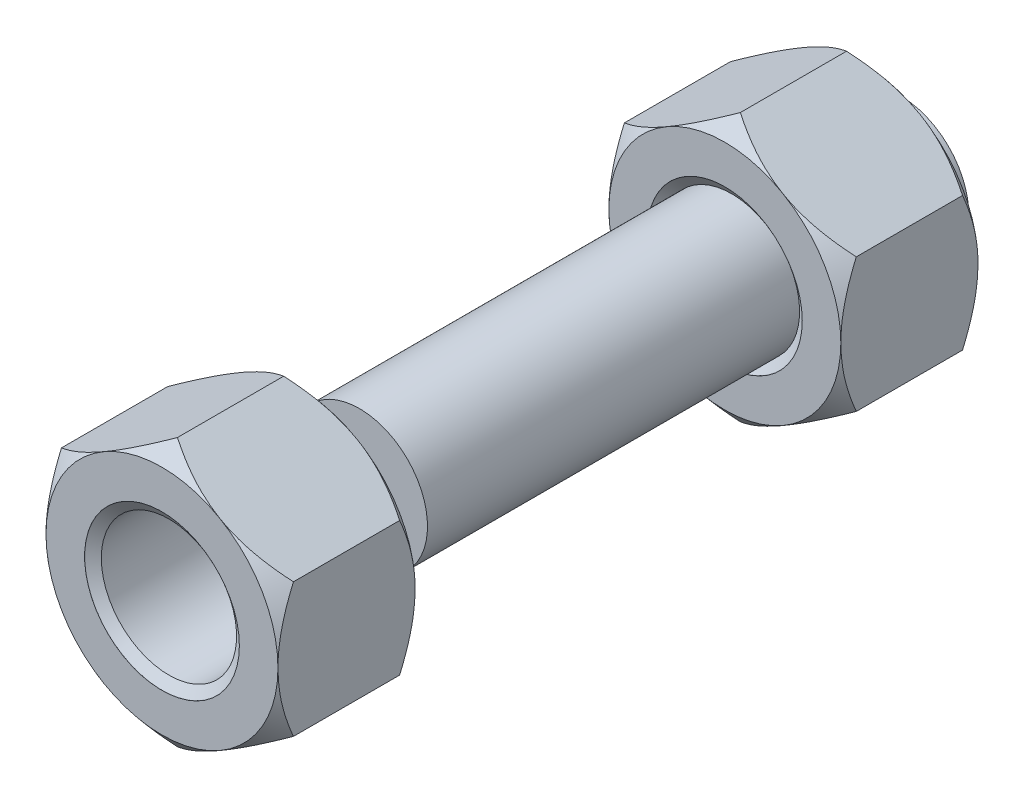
ISO-10303-21;
HEADER;
FILE_DESCRIPTION(('STEP AP214'),'2;1');
FILE_NAME('part.step','',(''),(''),'','','');
FILE_SCHEMA(('AUTOMOTIVE_DESIGN { 1 0 10303 214 1 1 1 1 }'));
ENDSEC;
DATA;
#1=APPLICATION_CONTEXT('core data for automotive mechanical design processes');
#2=APPLICATION_PROTOCOL_DEFINITION('international standard','automotive_design',2000,#1);
#3=PRODUCT_CONTEXT('',#1,'mechanical');
#4=PRODUCT('Part','Part','',(#3));
#5=PRODUCT_RELATED_PRODUCT_CATEGORY('part','',(#4));
#6=PRODUCT_DEFINITION_FORMATION('','',#4);
#7=PRODUCT_DEFINITION_CONTEXT('part definition',#1,'design');
#8=PRODUCT_DEFINITION('design','',#6,#7);
#9=PRODUCT_DEFINITION_SHAPE('','',#8);
#10=(LENGTH_UNIT() NAMED_UNIT(*) SI_UNIT(.MILLI.,.METRE.));
#11=(NAMED_UNIT(*) PLANE_ANGLE_UNIT() SI_UNIT($,.RADIAN.));
#12=(NAMED_UNIT(*) SI_UNIT($,.STERADIAN.) SOLID_ANGLE_UNIT());
#13=UNCERTAINTY_MEASURE_WITH_UNIT(LENGTH_MEASURE(1.E-05),#10,'distance_accuracy_value','');
#14=(GEOMETRIC_REPRESENTATION_CONTEXT(3) GLOBAL_UNCERTAINTY_ASSIGNED_CONTEXT((#13)) GLOBAL_UNIT_ASSIGNED_CONTEXT((#10,
#11,#12)) REPRESENTATION_CONTEXT('',''));
#15=CARTESIAN_POINT('',(0.,0.,0.));
#16=DIRECTION('',(0.,0.,1.));
#17=DIRECTION('',(1.,0.,0.));
#18=AXIS2_PLACEMENT_3D('',#15,#16,#17);
#19=CARTESIAN_POINT('',(0.,0.,69.9262));
#20=DIRECTION('',(0.,0.,1.));
#21=DIRECTION('',(1.,0.,0.));
#22=AXIS2_PLACEMENT_3D('',#19,#20,#21);
#23=CYLINDRICAL_SURFACE('',#22,11.1125);
#24=CARTESIAN_POINT('',(0.,0.,91.3101278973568));
#25=DIRECTION('',(0.,0.,-1.));
#26=DIRECTION('',(-1.,0.,0.));
#27=AXIS2_PLACEMENT_3D('',#24,#25,#26);
#28=CIRCLE('',#27,11.1125);
#29=CARTESIAN_POINT('',(-11.1125,0.,91.3101278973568));
#30=VERTEX_POINT('',#29);
#31=EDGE_CURVE('E323',#30,#30,#28,.T.);
#32=ORIENTED_EDGE('',*,*,#31,.F.);
#33=EDGE_LOOP('',(#32));
#34=FACE_BOUND('',#33,.T.);
#35=CARTESIAN_POINT('',(0.,0.,71.0720721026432));
#36=DIRECTION('',(0.,0.,-1.));
#37=DIRECTION('',(-1.,0.,0.));
#38=AXIS2_PLACEMENT_3D('',#35,#36,#37);
#39=CIRCLE('',#38,11.1125);
#40=CARTESIAN_POINT('',(-11.1125,0.,71.0720721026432));
#41=VERTEX_POINT('',#40);
#42=EDGE_CURVE('E183',#41,#41,#39,.F.);
#43=ORIENTED_EDGE('',*,*,#42,.F.);
#44=EDGE_LOOP('',(#43));
#45=FACE_BOUND('',#44,.T.);
#46=ADVANCED_FACE('F41',(#34,#45),#23,.F.);
#47=CARTESIAN_POINT('',(0.,21.9970452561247,69.9262));
#48=DIRECTION('',(0.,0.,-1.));
#49=DIRECTION('',(-1.,0.,0.));
#50=AXIS2_PLACEMENT_3D('',#47,#48,#49);
#51=PLANE('',#50);
#52=CARTESIAN_POINT('',(0.,0.,69.9262));
#53=DIRECTION('',(0.,0.,-1.));
#54=DIRECTION('',(-1.,0.,0.));
#55=AXIS2_PLACEMENT_3D('',#52,#53,#54);
#56=CIRCLE('',#55,19.05);
#57=CARTESIAN_POINT('',(-19.05,0.,69.9262));
#58=VERTEX_POINT('',#57);
#59=CARTESIAN_POINT('',(-9.525,-16.4977839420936,69.9262));
#60=VERTEX_POINT('',#59);
#61=EDGE_CURVE('E177',#58,#60,#56,.F.);
#62=ORIENTED_EDGE('',*,*,#61,.F.);
#63=CARTESIAN_POINT('',(-9.52500000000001,16.4977839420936,69.9262));
#64=VERTEX_POINT('',#63);
#65=EDGE_CURVE('E159',#64,#58,#56,.F.);
#66=ORIENTED_EDGE('',*,*,#65,.F.);
#67=CARTESIAN_POINT('',(9.525,16.4977839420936,69.9262));
#68=VERTEX_POINT('',#67);
#69=EDGE_CURVE('E176',#68,#64,#56,.F.);
#70=ORIENTED_EDGE('',*,*,#69,.F.);
#71=CARTESIAN_POINT('',(0.,0.,69.9262));
#72=DIRECTION('',(0.,0.,1.));
#73=DIRECTION('',(1.,0.,0.));
#74=AXIS2_PLACEMENT_3D('',#71,#72,#73);
#75=CIRCLE('',#74,19.05);
#76=CARTESIAN_POINT('',(19.05,0.,69.9262));
#77=VERTEX_POINT('',#76);
#78=EDGE_CURVE('E256',#77,#68,#75,.T.);
#79=ORIENTED_EDGE('',*,*,#78,.F.);
#80=CARTESIAN_POINT('',(9.52500000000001,-16.4977839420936,69.9262));
#81=VERTEX_POINT('',#80);
#82=EDGE_CURVE('E556',#81,#77,#56,.F.);
#83=ORIENTED_EDGE('',*,*,#82,.F.);
#84=EDGE_CURVE('E559',#60,#81,#56,.F.);
#85=ORIENTED_EDGE('',*,*,#84,.F.);
#86=EDGE_LOOP('',(#62,#66,#70,#79,#83,#85));
#87=FACE_BOUND('',#86,.T.);
#88=CARTESIAN_POINT('',(0.,0.,69.9262));
#89=DIRECTION('',(0.,0.,-1.));
#90=DIRECTION('',(-1.,0.,0.));
#91=AXIS2_PLACEMENT_3D('',#88,#89,#90);
#92=CIRCLE('',#91,12.7127);
#93=CARTESIAN_POINT('',(-12.7127,0.,69.9262));
#94=VERTEX_POINT('',#93);
#95=EDGE_CURVE('E181',#94,#94,#92,.F.);
#96=ORIENTED_EDGE('',*,*,#95,.T.);
#97=EDGE_LOOP('',(#96));
#98=FACE_BOUND('',#97,.T.);
#99=ADVANCED_FACE('F314',(#87,#98),#51,.T.);
#100=CARTESIAN_POINT('',(0.,21.9970452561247,92.456));
#101=DIRECTION('',(0.,0.,-1.));
#102=DIRECTION('',(-1.,0.,0.));
#103=AXIS2_PLACEMENT_3D('',#100,#101,#102);
#104=PLANE('',#103);
#105=CARTESIAN_POINT('',(0.,0.,92.456));
#106=DIRECTION('',(0.,0.,-1.));
#107=DIRECTION('',(-1.,0.,0.));
#108=AXIS2_PLACEMENT_3D('',#105,#106,#107);
#109=CIRCLE('',#108,19.05);
#110=CARTESIAN_POINT('',(-19.05,0.,92.456));
#111=VERTEX_POINT('',#110);
#112=CARTESIAN_POINT('',(-9.52500000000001,16.4977839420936,92.456));
#113=VERTEX_POINT('',#112);
#114=EDGE_CURVE('E12',#111,#113,#109,.T.);
#115=ORIENTED_EDGE('',*,*,#114,.F.);
#116=CARTESIAN_POINT('',(-9.525,-16.4977839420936,92.456));
#117=VERTEX_POINT('',#116);
#118=EDGE_CURVE('E53',#117,#111,#109,.T.);
#119=ORIENTED_EDGE('',*,*,#118,.F.);
#120=CARTESIAN_POINT('',(9.52500000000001,-16.4977839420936,92.456));
#121=VERTEX_POINT('',#120);
#122=EDGE_CURVE('E180',#121,#117,#109,.T.);
#123=ORIENTED_EDGE('',*,*,#122,.F.);
#124=CARTESIAN_POINT('',(19.05,0.,92.456));
#125=VERTEX_POINT('',#124);
#126=EDGE_CURVE('E549',#125,#121,#109,.T.);
#127=ORIENTED_EDGE('',*,*,#126,.F.);
#128=CARTESIAN_POINT('',(0.,0.,92.456));
#129=DIRECTION('',(0.,0.,1.));
#130=DIRECTION('',(1.,0.,0.));
#131=AXIS2_PLACEMENT_3D('',#128,#129,#130);
#132=CIRCLE('',#131,19.05);
#133=CARTESIAN_POINT('',(9.525,16.4977839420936,92.456));
#134=VERTEX_POINT('',#133);
#135=EDGE_CURVE('E135',#125,#134,#132,.T.);
#136=ORIENTED_EDGE('',*,*,#135,.T.);
#137=EDGE_CURVE('E51',#113,#134,#109,.T.);
#138=ORIENTED_EDGE('',*,*,#137,.F.);
#139=EDGE_LOOP('',(#115,#119,#123,#127,#136,#138));
#140=FACE_BOUND('',#139,.T.);
#141=CARTESIAN_POINT('',(0.,0.,92.456));
#142=DIRECTION('',(0.,0.,1.));
#143=DIRECTION('',(1.,0.,0.));
#144=AXIS2_PLACEMENT_3D('',#141,#142,#143);
#145=CIRCLE('',#144,12.7127);
#146=CARTESIAN_POINT('',(12.7127,0.,92.456));
#147=VERTEX_POINT('',#146);
#148=EDGE_CURVE('E186',#147,#147,#145,.T.);
#149=ORIENTED_EDGE('',*,*,#148,.F.);
#150=EDGE_LOOP('',(#149));
#151=FACE_BOUND('',#150,.T.);
#152=ADVANCED_FACE('F261',(#140,#151),#104,.F.);
#153=CARTESIAN_POINT('',(0.,21.9970452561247,69.9262));
#154=DIRECTION('',(-0.500000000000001,0.866025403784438,0.));
#155=DIRECTION('',(-0.866025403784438,-0.500000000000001,0.));
#156=AXIS2_PLACEMENT_3D('',#153,#154,#155);
#157=PLANE('',#156);
#158=DIRECTION('',(0.,0.,1.));
#159=VECTOR('',#158,1.);
#160=CARTESIAN_POINT('',(-19.05,10.9985226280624,69.9262));
#161=LINE('',#160,#159);
#162=CARTESIAN_POINT('',(-19.05,10.9985226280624,72.46874));
#163=VERTEX_POINT('',#162);
#164=CARTESIAN_POINT('',(-19.05,10.9985226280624,89.91346));
#165=VERTEX_POINT('',#164);
#166=EDGE_CURVE('E171',#163,#165,#161,.T.);
#167=ORIENTED_EDGE('',*,*,#166,.T.);
#168=CARTESIAN_POINT('',(-19.0502,10.9984071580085,89.9133603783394));
#169=CARTESIAN_POINT('',(-18.6769988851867,11.2138749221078,90.0992244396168));
#170=CARTESIAN_POINT('',(-18.3011689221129,11.430860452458,90.2782675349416));
#171=CARTESIAN_POINT('',(-17.5438933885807,11.8680736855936,90.6205052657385));
#172=CARTESIAN_POINT('',(-17.1624446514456,12.0883032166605,90.7836905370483));
#173=CARTESIAN_POINT('',(-16.3920595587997,12.5330852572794,91.0925650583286));
#174=CARTESIAN_POINT('',(-16.0030950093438,12.757654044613,91.2381612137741));
#175=CARTESIAN_POINT('',(-15.2197502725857,13.2099183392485,91.5082628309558));
#176=CARTESIAN_POINT('',(-14.8253710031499,13.4376133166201,91.6327718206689));
#177=CARTESIAN_POINT('',(-14.0386334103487,13.8918364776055,91.8560617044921));
#178=CARTESIAN_POINT('',(-13.6463651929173,14.118312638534,91.9552630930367));
#179=CARTESIAN_POINT('',(-12.8576236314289,14.5736927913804,92.128405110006));
#180=CARTESIAN_POINT('',(-12.4611501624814,14.8025968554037,92.2023449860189));
#181=CARTESIAN_POINT('',(-11.6659562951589,15.2617022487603,92.3227991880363));
#182=CARTESIAN_POINT('',(-11.2672427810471,15.4918996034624,92.3693736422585));
#183=CARTESIAN_POINT('',(-10.4680887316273,15.9532914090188,92.4339479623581));
#184=CARTESIAN_POINT('',(-10.067648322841,16.184485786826,92.4519498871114));
#185=CARTESIAN_POINT('',(-9.32247129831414,16.6147139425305,92.4583505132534));
#186=CARTESIAN_POINT('',(-8.97775518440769,16.8137358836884,92.450527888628));
#187=CARTESIAN_POINT('',(-8.28919614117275,17.211275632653,92.4135126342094));
#188=CARTESIAN_POINT('',(-7.94535318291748,17.4097934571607,92.3843207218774));
#189=CARTESIAN_POINT('',(-7.25921734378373,17.8059341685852,92.3052012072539));
#190=CARTESIAN_POINT('',(-6.91692579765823,18.0035562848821,92.2552582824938));
#191=CARTESIAN_POINT('',(-6.23493995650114,18.3973009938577,92.135708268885));
#192=CARTESIAN_POINT('',(-5.89524569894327,18.5934235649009,92.066100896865));
#193=CARTESIAN_POINT('',(-5.21901607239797,18.9838449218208,91.9085723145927));
#194=CARTESIAN_POINT('',(-4.88248119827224,19.178143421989,91.8206482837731));
#195=CARTESIAN_POINT('',(-4.21301661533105,19.564658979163,91.6280196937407));
#196=CARTESIAN_POINT('',(-3.88008745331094,19.7568757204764,91.523312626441));
#197=CARTESIAN_POINT('',(-2.88744413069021,20.3299786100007,91.1865307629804));
#198=CARTESIAN_POINT('',(-2.23344452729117,20.7075654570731,90.9316913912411));
#199=CARTESIAN_POINT('',(-1.31989540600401,21.2350032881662,90.5371233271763));
#200=CARTESIAN_POINT('',(-1.05363015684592,21.3887316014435,90.4173771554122));
#201=CARTESIAN_POINT('',(-0.524434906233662,21.6942626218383,90.1706581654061));
#202=CARTESIAN_POINT('',(-0.261497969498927,21.846069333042,90.0437052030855));
#203=CARTESIAN_POINT('',(0.000200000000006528,21.9971607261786,89.9133603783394));
#204=B_SPLINE_CURVE_WITH_KNOTS('',3,(#168,#169,#170,#171,#172,#173,#174,#175,#176,#177,#178,
#179,#180,#181,#182,#183,#184,#185,#186,#187,#188,#189,#190,#191,#192,#193,#194,#195,#196,#197,
#198,#199,#200,#201,#202,#203),.UNSPECIFIED.,.F.,.F.,(4,2,2,2,2,2,2,2,2,2,2,2,2,2,2,2,2,4),(0.,
1.40799576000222,2.81681796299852,4.23279724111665,5.64853938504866,7.03894936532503,
8.42940075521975,9.81678546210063,11.2040701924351,12.3978655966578,13.5916209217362,
14.7862592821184,15.9809148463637,17.1757545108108,18.3707729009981,20.7592937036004,
21.7490974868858,22.7362953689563),.UNSPECIFIED.);
#205=EDGE_CURVE('E140',#165,#113,#204,.T.);
#206=ORIENTED_EDGE('',*,*,#205,.T.);
#207=CARTESIAN_POINT('',(0.,21.9970452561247,89.91346));
#208=VERTEX_POINT('',#207);
#209=EDGE_CURVE('E60',#113,#208,#204,.T.);
#210=ORIENTED_EDGE('',*,*,#209,.T.);
#211=DIRECTION('',(0.,0.,1.));
#212=VECTOR('',#211,1.);
#213=CARTESIAN_POINT('',(0.,21.9970452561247,69.9262));
#214=LINE('',#213,#212);
#215=CARTESIAN_POINT('',(0.,21.9970452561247,72.46874));
#216=VERTEX_POINT('',#215);
#217=EDGE_CURVE('E156',#216,#208,#214,.T.);
#218=ORIENTED_EDGE('',*,*,#217,.F.);
#219=CARTESIAN_POINT('',(-19.0502,10.9984071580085,72.4688396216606));
#220=CARTESIAN_POINT('',(-18.6769988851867,11.2138749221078,72.2829755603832));
#221=CARTESIAN_POINT('',(-18.3011689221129,11.430860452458,72.1039324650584));
#222=CARTESIAN_POINT('',(-17.5438933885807,11.8680736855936,71.7616947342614));
#223=CARTESIAN_POINT('',(-17.1624446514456,12.0883032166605,71.5985094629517));
#224=CARTESIAN_POINT('',(-16.3920595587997,12.5330852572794,71.2896349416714));
#225=CARTESIAN_POINT('',(-16.0030950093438,12.757654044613,71.1440387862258));
#226=CARTESIAN_POINT('',(-15.2197502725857,13.2099183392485,70.8739371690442));
#227=CARTESIAN_POINT('',(-14.8253710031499,13.4376133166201,70.749428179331));
#228=CARTESIAN_POINT('',(-14.0386334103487,13.8918364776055,70.5261382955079));
#229=CARTESIAN_POINT('',(-13.6463651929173,14.118312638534,70.4269369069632));
#230=CARTESIAN_POINT('',(-12.8576236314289,14.5736927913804,70.253794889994));
#231=CARTESIAN_POINT('',(-12.4611501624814,14.8025968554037,70.1798550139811));
#232=CARTESIAN_POINT('',(-11.6659562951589,15.2617022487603,70.0594008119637));
#233=CARTESIAN_POINT('',(-11.2672427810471,15.4918996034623,70.0128263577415));
#234=CARTESIAN_POINT('',(-10.4680887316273,15.9532914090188,69.9482520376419));
#235=CARTESIAN_POINT('',(-10.067648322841,16.184485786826,69.9302501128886));
#236=CARTESIAN_POINT('',(-9.32247129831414,16.6147139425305,69.9238494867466));
#237=CARTESIAN_POINT('',(-8.97775518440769,16.8137358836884,69.931672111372));
#238=CARTESIAN_POINT('',(-8.28919614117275,17.211275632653,69.9686873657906));
#239=CARTESIAN_POINT('',(-7.94535318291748,17.4097934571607,69.9978792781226));
#240=CARTESIAN_POINT('',(-7.25921734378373,17.8059341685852,70.0769987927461));
#241=CARTESIAN_POINT('',(-6.91692579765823,18.0035562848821,70.1269417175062));
#242=CARTESIAN_POINT('',(-6.23493995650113,18.3973009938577,70.246491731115));
#243=CARTESIAN_POINT('',(-5.89524569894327,18.5934235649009,70.316099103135));
#244=CARTESIAN_POINT('',(-5.21901607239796,18.9838449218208,70.4736276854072));
#245=CARTESIAN_POINT('',(-4.88248119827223,19.178143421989,70.5615517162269));
#246=CARTESIAN_POINT('',(-4.21301661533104,19.564658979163,70.7541803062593));
#247=CARTESIAN_POINT('',(-3.88008745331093,19.7568757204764,70.858887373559));
#248=CARTESIAN_POINT('',(-2.88744413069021,20.3299786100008,71.1956692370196));
#249=CARTESIAN_POINT('',(-2.23344452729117,20.7075654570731,71.4505086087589));
#250=CARTESIAN_POINT('',(-1.31989540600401,21.2350032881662,71.8450766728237));
#251=CARTESIAN_POINT('',(-1.05363015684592,21.3887316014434,71.9648228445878));
#252=CARTESIAN_POINT('',(-0.524434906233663,21.6942626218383,72.2115418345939));
#253=CARTESIAN_POINT('',(-0.261497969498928,21.846069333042,72.3384947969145));
#254=CARTESIAN_POINT('',(0.000200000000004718,21.9971607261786,72.4688396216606));
#255=B_SPLINE_CURVE_WITH_KNOTS('',3,(#219,#220,#221,#222,#223,#224,#225,#226,#227,#228,#229,
#230,#231,#232,#233,#234,#235,#236,#237,#238,#239,#240,#241,#242,#243,#244,#245,#246,#247,#248,
#249,#250,#251,#252,#253,#254),.UNSPECIFIED.,.F.,.F.,(4,2,2,2,2,2,2,2,2,2,2,2,2,2,2,2,2,4),(0.,
1.40799576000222,2.81681796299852,4.23279724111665,5.64853938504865,7.03894936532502,
8.42940075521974,9.81678546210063,11.2040701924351,12.3978655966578,13.5916209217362,
14.7862592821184,15.9809148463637,17.1757545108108,18.3707729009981,20.7592937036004,
21.7490974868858,22.7362953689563),.UNSPECIFIED.);
#256=EDGE_CURVE('E174',#64,#216,#255,.T.);
#257=ORIENTED_EDGE('',*,*,#256,.F.);
#258=EDGE_CURVE('E272',#163,#64,#255,.T.);
#259=ORIENTED_EDGE('',*,*,#258,.F.);
#260=EDGE_LOOP('',(#167,#206,#210,#218,#257,#259));
#261=FACE_BOUND('',#260,.T.);
#262=ADVANCED_FACE('F43',(#261),#157,.T.);
#263=CARTESIAN_POINT('',(19.05,10.9985226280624,69.9262));
#264=DIRECTION('',(0.5,0.866025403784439,0.));
#265=DIRECTION('',(-0.866025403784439,0.5,0.));
#266=AXIS2_PLACEMENT_3D('',#263,#264,#265);
#267=PLANE('',#266);
#268=ORIENTED_EDGE('',*,*,#217,.T.);
#269=CARTESIAN_POINT('',(-0.000200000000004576,21.9971607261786,89.9133603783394));
#270=CARTESIAN_POINT('',(0.373001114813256,21.7816929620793,90.0992244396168));
#271=CARTESIAN_POINT('',(0.748831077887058,21.5647074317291,90.2782675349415));
#272=CARTESIAN_POINT('',(1.50610661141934,21.1274941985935,90.6205052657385));
#273=CARTESIAN_POINT('',(1.88755534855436,20.9072646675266,90.7836905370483));
#274=CARTESIAN_POINT('',(2.65794044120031,20.4624826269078,91.0925650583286));
#275=CARTESIAN_POINT('',(3.04690499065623,20.2379138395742,91.2381612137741));
#276=CARTESIAN_POINT('',(3.83024972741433,19.7856495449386,91.5082628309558));
#277=CARTESIAN_POINT('',(4.22462899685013,19.557954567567,91.6327718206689));
#278=CARTESIAN_POINT('',(5.01136658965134,19.1037314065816,91.8560617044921));
#279=CARTESIAN_POINT('',(5.40363480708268,18.8772552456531,91.9552630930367));
#280=CARTESIAN_POINT('',(6.19237636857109,18.4218750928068,92.128405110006));
#281=CARTESIAN_POINT('',(6.58884983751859,18.1929710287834,92.2023449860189));
#282=CARTESIAN_POINT('',(7.38404370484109,17.7338656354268,92.3227991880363));
#283=CARTESIAN_POINT('',(7.78275721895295,17.5036682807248,92.3693736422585));
#284=CARTESIAN_POINT('',(8.58191126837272,17.0422764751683,92.4339479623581));
#285=CARTESIAN_POINT('',(8.98235167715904,16.8110820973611,92.4519498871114));
#286=CARTESIAN_POINT('',(9.72752870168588,16.3808539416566,92.4583505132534));
#287=CARTESIAN_POINT('',(10.0722448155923,16.1818320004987,92.450527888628));
#288=CARTESIAN_POINT('',(10.7608038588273,15.7842922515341,92.4135126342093));
#289=CARTESIAN_POINT('',(11.1046468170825,15.5857744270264,92.3843207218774));
#290=CARTESIAN_POINT('',(11.7907826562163,15.1896337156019,92.3052012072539));
#291=CARTESIAN_POINT('',(12.1330742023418,14.992011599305,92.2552582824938));
#292=CARTESIAN_POINT('',(12.8150600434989,14.5982668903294,92.135708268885));
#293=CARTESIAN_POINT('',(13.1547543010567,14.4021443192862,92.066100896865));
#294=CARTESIAN_POINT('',(13.8309839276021,14.0117229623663,91.9085723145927));
#295=CARTESIAN_POINT('',(14.1675188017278,13.8174244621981,91.8206482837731));
#296=CARTESIAN_POINT('',(14.836983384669,13.4309089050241,91.6280196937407));
#297=CARTESIAN_POINT('',(15.1699125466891,13.2386921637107,91.523312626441));
#298=CARTESIAN_POINT('',(16.1625558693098,12.6655892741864,91.1865307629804));
#299=CARTESIAN_POINT('',(16.8165554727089,12.288002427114,90.9316913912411));
#300=CARTESIAN_POINT('',(17.730104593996,11.7605645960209,90.5371233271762));
#301=CARTESIAN_POINT('',(17.9963698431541,11.6068362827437,90.4173771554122));
#302=CARTESIAN_POINT('',(18.5255650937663,11.3013052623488,90.1706581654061));
#303=CARTESIAN_POINT('',(18.7885020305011,11.1494985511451,90.0437052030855));
#304=CARTESIAN_POINT('',(19.0502,10.9984071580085,89.9133603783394));
#305=B_SPLINE_CURVE_WITH_KNOTS('',3,(#269,#270,#271,#272,#273,#274,#275,#276,#277,#278,#279,
#280,#281,#282,#283,#284,#285,#286,#287,#288,#289,#290,#291,#292,#293,#294,#295,#296,#297,#298,
#299,#300,#301,#302,#303,#304),.UNSPECIFIED.,.F.,.F.,(4,2,2,2,2,2,2,2,2,2,2,2,2,2,2,2,2,4),(0.,
1.40799576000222,2.81681796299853,4.23279724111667,5.64853938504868,7.03894936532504,
8.42940075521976,9.81678546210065,11.2040701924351,12.3978655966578,13.5916209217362,
14.7862592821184,15.9809148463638,17.1757545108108,18.3707729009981,20.7592937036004,
21.7490974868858,22.7362953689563),.UNSPECIFIED.);
#306=EDGE_CURVE('E150',#208,#134,#305,.T.);
#307=ORIENTED_EDGE('',*,*,#306,.T.);
#308=CARTESIAN_POINT('',(19.05,10.9985226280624,89.91346));
#309=VERTEX_POINT('',#308);
#310=EDGE_CURVE('E67',#134,#309,#305,.T.);
#311=ORIENTED_EDGE('',*,*,#310,.T.);
#312=DIRECTION('',(0.,0.,1.));
#313=VECTOR('',#312,1.);
#314=CARTESIAN_POINT('',(19.05,10.9985226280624,69.9262));
#315=LINE('',#314,#313);
#316=CARTESIAN_POINT('',(19.05,10.9985226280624,72.46874));
#317=VERTEX_POINT('',#316);
#318=EDGE_CURVE('E149',#317,#309,#315,.T.);
#319=ORIENTED_EDGE('',*,*,#318,.F.);
#320=CARTESIAN_POINT('',(-0.000200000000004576,21.9971607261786,72.4688396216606));
#321=CARTESIAN_POINT('',(0.373001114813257,21.7816929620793,72.2829755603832));
#322=CARTESIAN_POINT('',(0.748831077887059,21.5647074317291,72.1039324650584));
#323=CARTESIAN_POINT('',(1.50610661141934,21.1274941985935,71.7616947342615));
#324=CARTESIAN_POINT('',(1.88755534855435,20.9072646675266,71.5985094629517));
#325=CARTESIAN_POINT('',(2.6579404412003,20.4624826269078,71.2896349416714));
#326=CARTESIAN_POINT('',(3.04690499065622,20.2379138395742,71.1440387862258));
#327=CARTESIAN_POINT('',(3.83024972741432,19.7856495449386,70.8739371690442));
#328=CARTESIAN_POINT('',(4.22462899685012,19.557954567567,70.7494281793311));
#329=CARTESIAN_POINT('',(5.01136658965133,19.1037314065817,70.5261382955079));
#330=CARTESIAN_POINT('',(5.40363480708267,18.8772552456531,70.4269369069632));
#331=CARTESIAN_POINT('',(6.19237636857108,18.4218750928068,70.253794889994));
#332=CARTESIAN_POINT('',(6.58884983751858,18.1929710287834,70.1798550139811));
#333=CARTESIAN_POINT('',(7.38404370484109,17.7338656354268,70.0594008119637));
#334=CARTESIAN_POINT('',(7.78275721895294,17.5036682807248,70.0128263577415));
#335=CARTESIAN_POINT('',(8.58191126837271,17.0422764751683,69.9482520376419));
#336=CARTESIAN_POINT('',(8.98235167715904,16.8110820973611,69.9302501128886));
#337=CARTESIAN_POINT('',(9.72752870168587,16.3808539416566,69.9238494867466));
#338=CARTESIAN_POINT('',(10.0722448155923,16.1818320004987,69.931672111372));
#339=CARTESIAN_POINT('',(10.7608038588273,15.7842922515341,69.9686873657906));
#340=CARTESIAN_POINT('',(11.1046468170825,15.5857744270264,69.9978792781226));
#341=CARTESIAN_POINT('',(11.7907826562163,15.1896337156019,70.0769987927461));
#342=CARTESIAN_POINT('',(12.1330742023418,14.992011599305,70.1269417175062));
#343=CARTESIAN_POINT('',(12.8150600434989,14.5982668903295,70.246491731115));
#344=CARTESIAN_POINT('',(13.1547543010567,14.4021443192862,70.316099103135));
#345=CARTESIAN_POINT('',(13.830983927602,14.0117229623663,70.4736276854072));
#346=CARTESIAN_POINT('',(14.1675188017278,13.8174244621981,70.5615517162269));
#347=CARTESIAN_POINT('',(14.836983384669,13.4309089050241,70.7541803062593));
#348=CARTESIAN_POINT('',(15.1699125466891,13.2386921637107,70.858887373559));
#349=CARTESIAN_POINT('',(16.1625558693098,12.6655892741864,71.1956692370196));
#350=CARTESIAN_POINT('',(16.8165554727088,12.288002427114,71.4505086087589));
#351=CARTESIAN_POINT('',(17.730104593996,11.7605645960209,71.8450766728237));
#352=CARTESIAN_POINT('',(17.9963698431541,11.6068362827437,71.9648228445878));
#353=CARTESIAN_POINT('',(18.5255650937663,11.3013052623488,72.2115418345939));
#354=CARTESIAN_POINT('',(18.7885020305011,11.1494985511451,72.3384947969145));
#355=CARTESIAN_POINT('',(19.0502,10.9984071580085,72.4688396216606));
#356=B_SPLINE_CURVE_WITH_KNOTS('',3,(#320,#321,#322,#323,#324,#325,#326,#327,#328,#329,#330,
#331,#332,#333,#334,#335,#336,#337,#338,#339,#340,#341,#342,#343,#344,#345,#346,#347,#348,#349,
#350,#351,#352,#353,#354,#355),.UNSPECIFIED.,.F.,.F.,(4,2,2,2,2,2,2,2,2,2,2,2,2,2,2,2,2,4),(0.,
1.40799576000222,2.81681796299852,4.23279724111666,5.64853938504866,7.03894936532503,
8.42940075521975,9.81678546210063,11.2040701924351,12.3978655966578,13.5916209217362,
14.7862592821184,15.9809148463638,17.1757545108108,18.3707729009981,20.7592937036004,
21.7490974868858,22.7362953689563),.UNSPECIFIED.);
#357=EDGE_CURVE('E265',#68,#317,#356,.T.);
#358=ORIENTED_EDGE('',*,*,#357,.F.);
#359=EDGE_CURVE('E271',#216,#68,#356,.T.);
#360=ORIENTED_EDGE('',*,*,#359,.F.);
#361=EDGE_LOOP('',(#268,#307,#311,#319,#358,#360));
#362=FACE_BOUND('',#361,.T.);
#363=ADVANCED_FACE('F147',(#362),#267,.T.);
#364=CARTESIAN_POINT('',(19.05,10.9985226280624,69.9262));
#365=DIRECTION('',(-1.,0.,0.));
#366=DIRECTION('',(0.,0.,1.));
#367=AXIS2_PLACEMENT_3D('',#364,#365,#366);
#368=PLANE('',#367);
#369=CARTESIAN_POINT('',(19.05,-24.3355008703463,82.2281913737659));
#370=CARTESIAN_POINT('',(19.05,-24.0277736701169,82.4372416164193));
#371=CARTESIAN_POINT('',(19.05,-23.7193502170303,82.6452662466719));
#372=CARTESIAN_POINT('',(19.05,-23.1009881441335,83.0590611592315));
#373=CARTESIAN_POINT('',(19.05,-22.7910495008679,83.2648314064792));
#374=CARTESIAN_POINT('',(19.05,-21.8586628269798,83.8785306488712));
#375=CARTESIAN_POINT('',(19.05,-21.2337710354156,84.282761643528));
#376=CARTESIAN_POINT('',(19.05,-19.9719471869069,85.0821122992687));
#377=CARTESIAN_POINT('',(19.05,-19.3349611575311,85.4771469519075));
#378=CARTESIAN_POINT('',(19.05,-18.0520423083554,86.252366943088));
#379=CARTESIAN_POINT('',(19.05,-17.4061100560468,86.6325532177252));
#380=CARTESIAN_POINT('',(19.05,-16.0683891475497,87.3947632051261));
#381=CARTESIAN_POINT('',(19.05,-15.3760153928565,87.7757650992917));
#382=CARTESIAN_POINT('',(19.05,-13.977538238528,88.5121223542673));
#383=CARTESIAN_POINT('',(19.05,-13.271432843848,88.8674739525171));
#384=CARTESIAN_POINT('',(19.05,-11.8455249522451,89.5445362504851));
#385=CARTESIAN_POINT('',(19.05,-11.1257649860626,89.8663359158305));
#386=CARTESIAN_POINT('',(19.05,-9.66912101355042,90.4683873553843));
#387=CARTESIAN_POINT('',(19.05,-8.93224422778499,90.7486562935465));
#388=CARTESIAN_POINT('',(19.05,-7.82417600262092,91.1260894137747));
#389=CARTESIAN_POINT('',(19.05,-7.45977313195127,91.2433044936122));
#390=CARTESIAN_POINT('',(19.05,-6.72680592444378,91.4639650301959));
#391=CARTESIAN_POINT('',(19.05,-6.35824171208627,91.56741089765));
#392=CARTESIAN_POINT('',(19.05,-5.61714416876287,91.7591281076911));
#393=CARTESIAN_POINT('',(19.05,-5.24461055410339,91.8473983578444));
#394=CARTESIAN_POINT('',(19.05,-4.49600717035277,92.0073695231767));
#395=CARTESIAN_POINT('',(19.05,-4.11993762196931,92.0790714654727));
#396=CARTESIAN_POINT('',(19.05,-3.37183984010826,92.2034847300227));
#397=CARTESIAN_POINT('',(19.05,-2.99986645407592,92.256524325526));
#398=CARTESIAN_POINT('',(19.05,-2.25377026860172,92.3444499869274));
#399=CARTESIAN_POINT('',(19.05,-1.87964748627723,92.3793361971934));
#400=CARTESIAN_POINT('',(19.05,-1.13014656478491,92.4302582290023));
#401=CARTESIAN_POINT('',(19.05,-0.754768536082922,92.4462956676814));
#402=CARTESIAN_POINT('',(19.05,-0.00368417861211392,92.4591919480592));
#403=CARTESIAN_POINT('',(19.05,0.372022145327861,92.4560510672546));
#404=CARTESIAN_POINT('',(19.05,1.09772922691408,92.4315074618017));
#405=CARTESIAN_POINT('',(19.05,1.44777250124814,92.4113372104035));
#406=CARTESIAN_POINT('',(19.05,2.14653011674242,92.3547167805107));
#407=CARTESIAN_POINT('',(19.05,2.49524447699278,92.3182668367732));
#408=CARTESIAN_POINT('',(19.05,3.19068381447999,92.229708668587));
#409=CARTESIAN_POINT('',(19.05,3.53740870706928,92.1775997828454));
#410=CARTESIAN_POINT('',(19.05,4.22829608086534,92.0585571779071));
#411=CARTESIAN_POINT('',(19.05,4.57245853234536,91.9916232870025));
#412=CARTESIAN_POINT('',(19.05,5.26490320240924,91.8423751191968));
#413=CARTESIAN_POINT('',(19.05,5.61312256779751,91.7597703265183));
#414=CARTESIAN_POINT('',(19.05,6.30612366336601,91.5812607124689));
#415=CARTESIAN_POINT('',(19.05,6.65090536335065,91.485355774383));
#416=CARTESIAN_POINT('',(19.05,7.33675828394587,91.2814280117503));
#417=CARTESIAN_POINT('',(19.05,7.67783043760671,91.1734083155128));
#418=CARTESIAN_POINT('',(19.05,8.35626493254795,90.9463688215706));
#419=CARTESIAN_POINT('',(19.05,8.69362737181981,90.8273493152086));
#420=CARTESIAN_POINT('',(19.05,9.6412947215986,90.4771814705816));
#421=CARTESIAN_POINT('',(19.05,10.24734708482,90.234478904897));
#422=CARTESIAN_POINT('',(19.05,11.447938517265,89.7219395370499));
#423=CARTESIAN_POINT('',(19.05,12.042474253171,89.4520950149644));
#424=CARTESIAN_POINT('',(19.05,13.2215691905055,88.8899289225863));
#425=CARTESIAN_POINT('',(19.05,13.8061167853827,88.5975831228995));
#426=CARTESIAN_POINT('',(19.05,14.9656524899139,87.9947178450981));
#427=CARTESIAN_POINT('',(19.05,15.5406414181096,87.6841999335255));
#428=CARTESIAN_POINT('',(19.05,16.6856847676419,87.046266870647));
#429=CARTESIAN_POINT('',(19.05,17.255688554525,86.7187611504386));
#430=CARTESIAN_POINT('',(19.05,18.3882895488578,86.0511975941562));
#431=CARTESIAN_POINT('',(19.05,18.9508866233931,85.7111395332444));
#432=CARTESIAN_POINT('',(19.05,20.0692988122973,85.0207556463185));
#433=CARTESIAN_POINT('',(19.05,20.6251175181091,84.6704356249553));
#434=CARTESIAN_POINT('',(19.05,21.731110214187,83.9610218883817));
#435=CARTESIAN_POINT('',(19.05,22.2812842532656,83.6019282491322));
#436=CARTESIAN_POINT('',(19.05,23.3228056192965,82.9120153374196));
#437=CARTESIAN_POINT('',(19.05,23.8146141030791,82.5818910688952));
#438=CARTESIAN_POINT('',(19.05,24.7946769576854,81.9164046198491));
#439=CARTESIAN_POINT('',(19.05,25.282931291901,81.5810423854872));
#440=CARTESIAN_POINT('',(19.05,26.7430916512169,80.5680617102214));
#441=CARTESIAN_POINT('',(19.05,27.7102757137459,79.8836288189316));
#442=CARTESIAN_POINT('',(19.05,29.1471424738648,78.851083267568));
#443=CARTESIAN_POINT('',(19.05,29.6206388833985,78.5082452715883));
#444=CARTESIAN_POINT('',(19.05,30.5654258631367,77.8195376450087));
#445=CARTESIAN_POINT('',(19.05,31.0367164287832,77.473668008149));
#446=CARTESIAN_POINT('',(19.05,31.9771886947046,76.7793328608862));
#447=CARTESIAN_POINT('',(19.05,32.4463709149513,76.4308680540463));
#448=CARTESIAN_POINT('',(19.05,33.3829333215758,75.7315344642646));
#449=CARTESIAN_POINT('',(19.05,33.8503135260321,75.3806657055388));
#450=CARTESIAN_POINT('',(19.05,34.3168887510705,75.0287321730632));
#451=B_SPLINE_CURVE_WITH_KNOTS('',3,(#369,#370,#371,#372,#373,#374,#375,#376,#377,#378,#379,
#380,#381,#382,#383,#384,#385,#386,#387,#388,#389,#390,#391,#392,#393,#394,#395,#396,#397,#398,
#399,#400,#401,#402,#403,#404,#405,#406,#407,#408,#409,#410,#411,#412,#413,#414,#415,#416,#417,
#418,#419,#420,#421,#422,#423,#424,#425,#426,#427,#428,#429,#430,#431,#432,#433,#434,#435,#436,
#437,#438,#439,#440,#441,#442,#443,#444,#445,#446,#447,#448,#449,#450),.UNSPECIFIED.,.F.,.F.,(4,
2,2,2,2,2,2,2,2,2,2,2,2,2,2,2,2,2,2,2,2,2,2,2,2,2,2,2,2,2,2,2,2,2,2,2,2,2,2,2,4),(0.,
1.11605275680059,2.23212284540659,4.46472391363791,6.71316753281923,8.96146917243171,
11.3318886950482,13.7026552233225,16.0669664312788,18.4302977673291,19.578449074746,
20.7265661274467,21.874765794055,23.0228942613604,24.1496778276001,25.2764524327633,
26.403130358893,27.5297919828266,28.5812790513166,29.6327509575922,30.6842672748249,
31.7357957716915,32.8091595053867,33.8825326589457,34.9556292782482,36.0286974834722,
37.9863382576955,39.9445374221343,41.9048754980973,43.8650448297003,45.837029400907,
47.8090493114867,49.7799745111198,51.7508826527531,53.527841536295,55.3048186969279,
58.8592031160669,60.6129443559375,62.3666892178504,64.1199747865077,65.8732427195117),.UNSPECIFIED.);
#452=CARTESIAN_POINT('',(19.05,-10.9985226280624,89.91346));
#453=VERTEX_POINT('',#452);
#454=EDGE_CURVE('E142',#453,#125,#451,.T.);
#455=ORIENTED_EDGE('',*,*,#454,.F.);
#456=DIRECTION('',(0.,0.,1.));
#457=VECTOR('',#456,1.);
#458=CARTESIAN_POINT('',(19.05,-10.9985226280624,69.9262));
#459=LINE('',#458,#457);
#460=CARTESIAN_POINT('',(19.05,-10.9985226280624,72.46874));
#461=VERTEX_POINT('',#460);
#462=EDGE_CURVE('E157',#461,#453,#459,.T.);
#463=ORIENTED_EDGE('',*,*,#462,.F.);
#464=CARTESIAN_POINT('',(19.05,-24.3355008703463,80.1540086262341));
#465=CARTESIAN_POINT('',(19.05,-24.0277736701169,79.9449583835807));
#466=CARTESIAN_POINT('',(19.05,-23.7193502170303,79.7369337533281));
#467=CARTESIAN_POINT('',(19.05,-23.1009881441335,79.3231388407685));
#468=CARTESIAN_POINT('',(19.05,-22.7910495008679,79.1173685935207));
#469=CARTESIAN_POINT('',(19.05,-21.8586628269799,78.5036693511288));
#470=CARTESIAN_POINT('',(19.05,-21.2337710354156,78.099438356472));
#471=CARTESIAN_POINT('',(19.05,-19.9719471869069,77.3000877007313));
#472=CARTESIAN_POINT('',(19.05,-19.3349611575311,76.9050530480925));
#473=CARTESIAN_POINT('',(19.05,-18.0520423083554,76.1298330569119));
#474=CARTESIAN_POINT('',(19.05,-17.4061100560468,75.7496467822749));
#475=CARTESIAN_POINT('',(19.05,-16.0683891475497,74.9874367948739));
#476=CARTESIAN_POINT('',(19.05,-15.3760153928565,74.6064349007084));
#477=CARTESIAN_POINT('',(19.05,-13.9775382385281,73.8700776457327));
#478=CARTESIAN_POINT('',(19.05,-13.271432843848,73.5147260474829));
#479=CARTESIAN_POINT('',(19.05,-11.8455249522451,72.8376637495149));
#480=CARTESIAN_POINT('',(19.05,-11.1257649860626,72.5158640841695));
#481=CARTESIAN_POINT('',(19.05,-9.66912101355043,71.9138126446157));
#482=CARTESIAN_POINT('',(19.05,-8.93224422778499,71.6335437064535));
#483=CARTESIAN_POINT('',(19.05,-7.82417600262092,71.2561105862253));
#484=CARTESIAN_POINT('',(19.05,-7.45977313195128,71.1388955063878));
#485=CARTESIAN_POINT('',(19.05,-6.72680592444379,70.918234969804));
#486=CARTESIAN_POINT('',(19.05,-6.35824171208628,70.81478910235));
#487=CARTESIAN_POINT('',(19.05,-5.61714416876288,70.6230718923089));
#488=CARTESIAN_POINT('',(19.05,-5.24461055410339,70.5348016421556));
#489=CARTESIAN_POINT('',(19.05,-4.49600717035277,70.3748304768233));
#490=CARTESIAN_POINT('',(19.05,-4.11993762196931,70.3031285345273));
#491=CARTESIAN_POINT('',(19.05,-3.37183984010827,70.1787152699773));
#492=CARTESIAN_POINT('',(19.05,-2.99986645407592,70.125675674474));
#493=CARTESIAN_POINT('',(19.05,-2.25377026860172,70.0377500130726));
#494=CARTESIAN_POINT('',(19.05,-1.87964748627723,70.0028638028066));
#495=CARTESIAN_POINT('',(19.05,-1.13014656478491,69.9519417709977));
#496=CARTESIAN_POINT('',(19.05,-0.754768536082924,69.9359043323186));
#497=CARTESIAN_POINT('',(19.05,-0.00368417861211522,69.9230080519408));
#498=CARTESIAN_POINT('',(19.05,0.37202214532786,69.9261489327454));
#499=CARTESIAN_POINT('',(19.05,1.09772922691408,69.9506925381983));
#500=CARTESIAN_POINT('',(19.05,1.44777250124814,69.9708627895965));
#501=CARTESIAN_POINT('',(19.05,2.14653011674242,70.0274832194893));
#502=CARTESIAN_POINT('',(19.05,2.49524447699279,70.0639331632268));
#503=CARTESIAN_POINT('',(19.05,3.19068381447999,70.152491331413));
#504=CARTESIAN_POINT('',(19.05,3.53740870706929,70.2046002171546));
#505=CARTESIAN_POINT('',(19.05,4.22829608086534,70.3236428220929));
#506=CARTESIAN_POINT('',(19.05,4.57245853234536,70.3905767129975));
#507=CARTESIAN_POINT('',(19.05,5.26490320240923,70.5398248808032));
#508=CARTESIAN_POINT('',(19.05,5.61312256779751,70.6224296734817));
#509=CARTESIAN_POINT('',(19.05,6.30612366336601,70.8009392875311));
#510=CARTESIAN_POINT('',(19.05,6.65090536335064,70.896844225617));
#511=CARTESIAN_POINT('',(19.05,7.33675828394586,71.1007719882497));
#512=CARTESIAN_POINT('',(19.05,7.6778304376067,71.2087916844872));
#513=CARTESIAN_POINT('',(19.05,8.35626493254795,71.4358311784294));
#514=CARTESIAN_POINT('',(19.05,8.69362737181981,71.5548506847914));
#515=CARTESIAN_POINT('',(19.05,9.6412947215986,71.9050185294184));
#516=CARTESIAN_POINT('',(19.05,10.24734708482,72.147721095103));
#517=CARTESIAN_POINT('',(19.05,11.447938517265,72.6602604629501));
#518=CARTESIAN_POINT('',(19.05,12.042474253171,72.9301049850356));
#519=CARTESIAN_POINT('',(19.05,13.2215691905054,73.4922710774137));
#520=CARTESIAN_POINT('',(19.05,13.8061167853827,73.7846168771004));
#521=CARTESIAN_POINT('',(19.05,14.9656524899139,74.3874821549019));
#522=CARTESIAN_POINT('',(19.05,15.5406414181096,74.6980000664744));
#523=CARTESIAN_POINT('',(19.05,16.6856847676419,75.335933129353));
#524=CARTESIAN_POINT('',(19.05,17.255688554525,75.6634388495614));
#525=CARTESIAN_POINT('',(19.05,18.3882895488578,76.3310024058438));
#526=CARTESIAN_POINT('',(19.05,18.9508866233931,76.6710604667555));
#527=CARTESIAN_POINT('',(19.05,20.0692988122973,77.3614443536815));
#528=CARTESIAN_POINT('',(19.05,20.625117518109,77.7117643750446));
#529=CARTESIAN_POINT('',(19.05,21.731110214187,78.4211781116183));
#530=CARTESIAN_POINT('',(19.05,22.2812842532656,78.7802717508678));
#531=CARTESIAN_POINT('',(19.05,23.3228056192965,79.4701846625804));
#532=CARTESIAN_POINT('',(19.05,23.8146141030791,79.8003089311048));
#533=CARTESIAN_POINT('',(19.05,24.7946769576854,80.4657953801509));
#534=CARTESIAN_POINT('',(19.05,25.2829312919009,80.8011576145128));
#535=CARTESIAN_POINT('',(19.05,26.7430916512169,81.8141382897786));
#536=CARTESIAN_POINT('',(19.05,27.7102757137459,82.4985711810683));
#537=CARTESIAN_POINT('',(19.05,29.1471424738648,83.531116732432));
#538=CARTESIAN_POINT('',(19.05,29.6206388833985,83.8739547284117));
#539=CARTESIAN_POINT('',(19.05,30.5654258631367,84.5626623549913));
#540=CARTESIAN_POINT('',(19.05,31.0367164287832,84.908531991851));
#541=CARTESIAN_POINT('',(19.05,31.9771886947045,85.6028671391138));
#542=CARTESIAN_POINT('',(19.05,32.4463709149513,85.9513319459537));
#543=CARTESIAN_POINT('',(19.05,33.3829333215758,86.6506655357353));
#544=CARTESIAN_POINT('',(19.05,33.8503135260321,87.0015342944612));
#545=CARTESIAN_POINT('',(19.05,34.3168887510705,87.3534678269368));
#546=B_SPLINE_CURVE_WITH_KNOTS('',3,(#464,#465,#466,#467,#468,#469,#470,#471,#472,#473,#474,
#475,#476,#477,#478,#479,#480,#481,#482,#483,#484,#485,#486,#487,#488,#489,#490,#491,#492,#493,
#494,#495,#496,#497,#498,#499,#500,#501,#502,#503,#504,#505,#506,#507,#508,#509,#510,#511,#512,
#513,#514,#515,#516,#517,#518,#519,#520,#521,#522,#523,#524,#525,#526,#527,#528,#529,#530,#531,
#532,#533,#534,#535,#536,#537,#538,#539,#540,#541,#542,#543,#544,#545),.UNSPECIFIED.,.F.,.F.,(4,
2,2,2,2,2,2,2,2,2,2,2,2,2,2,2,2,2,2,2,2,2,2,2,2,2,2,2,2,2,2,2,2,2,2,2,2,2,2,2,4),(0.,
1.11605275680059,2.23212284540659,4.46472391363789,6.71316753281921,8.9614691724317,
11.3318886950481,13.7026552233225,16.0669664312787,18.4302977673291,19.578449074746,
20.7265661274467,21.874765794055,23.0228942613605,24.1496778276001,25.2764524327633,
26.403130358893,27.5297919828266,28.5812790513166,29.6327509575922,30.684267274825,
31.7357957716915,32.8091595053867,33.8825326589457,34.9556292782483,36.0286974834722,
37.9863382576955,39.9445374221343,41.9048754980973,43.8650448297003,45.837029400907,
47.8090493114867,49.7799745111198,51.7508826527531,53.527841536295,55.3048186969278,
58.8592031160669,60.6129443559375,62.3666892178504,64.1199747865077,65.8732427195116),.UNSPECIFIED.);
#547=EDGE_CURVE('E279',#461,#77,#546,.T.);
#548=ORIENTED_EDGE('',*,*,#547,.T.);
#549=EDGE_CURVE('E155',#77,#317,#546,.T.);
#550=ORIENTED_EDGE('',*,*,#549,.T.);
#551=ORIENTED_EDGE('',*,*,#318,.T.);
#552=EDGE_CURVE('E132',#125,#309,#451,.T.);
#553=ORIENTED_EDGE('',*,*,#552,.F.);
#554=EDGE_LOOP('',(#455,#463,#548,#550,#551,#553));
#555=FACE_BOUND('',#554,.T.);
#556=ADVANCED_FACE('F153',(#555),#368,.F.);
#557=CARTESIAN_POINT('',(0.,-21.9970452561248,69.9262));
#558=DIRECTION('',(0.5,-0.866025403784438,0.));
#559=DIRECTION('',(0.866025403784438,0.5,0.));
#560=AXIS2_PLACEMENT_3D('',#557,#558,#559);
#561=PLANE('',#560);
#562=ORIENTED_EDGE('',*,*,#462,.T.);
#563=CARTESIAN_POINT('',(19.0502,-10.9984071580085,89.9133603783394));
#564=CARTESIAN_POINT('',(18.6769988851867,-11.2138749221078,90.0992244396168));
#565=CARTESIAN_POINT('',(18.3011689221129,-11.430860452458,90.2782675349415));
#566=CARTESIAN_POINT('',(17.5438933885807,-11.8680736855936,90.6205052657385));
#567=CARTESIAN_POINT('',(17.1624446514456,-12.0883032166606,90.7836905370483));
#568=CARTESIAN_POINT('',(16.3920595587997,-12.5330852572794,91.0925650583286));
#569=CARTESIAN_POINT('',(16.0030950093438,-12.757654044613,91.2381612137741));
#570=CARTESIAN_POINT('',(15.2197502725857,-13.2099183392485,91.5082628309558));
#571=CARTESIAN_POINT('',(14.8253710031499,-13.4376133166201,91.6327718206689));
#572=CARTESIAN_POINT('',(14.0386334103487,-13.8918364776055,91.8560617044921));
#573=CARTESIAN_POINT('',(13.6463651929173,-14.118312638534,91.9552630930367));
#574=CARTESIAN_POINT('',(12.8576236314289,-14.5736927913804,92.128405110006));
#575=CARTESIAN_POINT('',(12.4611501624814,-14.8025968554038,92.2023449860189));
#576=CARTESIAN_POINT('',(11.6659562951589,-15.2617022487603,92.3227991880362));
#577=CARTESIAN_POINT('',(11.2672427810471,-15.4918996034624,92.3693736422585));
#578=CARTESIAN_POINT('',(10.4680887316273,-15.9532914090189,92.4339479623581));
#579=CARTESIAN_POINT('',(10.067648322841,-16.184485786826,92.4519498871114));
#580=CARTESIAN_POINT('',(9.32247129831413,-16.6147139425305,92.4583505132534));
#581=CARTESIAN_POINT('',(8.97775518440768,-16.8137358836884,92.450527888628));
#582=CARTESIAN_POINT('',(8.28919614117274,-17.2112756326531,92.4135126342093));
#583=CARTESIAN_POINT('',(7.94535318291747,-17.4097934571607,92.3843207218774));
#584=CARTESIAN_POINT('',(7.25921734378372,-17.8059341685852,92.3052012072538));
#585=CARTESIAN_POINT('',(6.91692579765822,-18.0035562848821,92.2552582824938));
#586=CARTESIAN_POINT('',(6.23493995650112,-18.3973009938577,92.135708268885));
#587=CARTESIAN_POINT('',(5.89524569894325,-18.5934235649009,92.066100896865));
#588=CARTESIAN_POINT('',(5.21901607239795,-18.9838449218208,91.9085723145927));
#589=CARTESIAN_POINT('',(4.88248119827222,-19.178143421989,91.8206482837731));
#590=CARTESIAN_POINT('',(4.21301661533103,-19.564658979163,91.6280196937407));
#591=CARTESIAN_POINT('',(3.88008745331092,-19.7568757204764,91.523312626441));
#592=CARTESIAN_POINT('',(2.88744413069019,-20.3299786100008,91.1865307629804));
#593=CARTESIAN_POINT('',(2.23344452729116,-20.7075654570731,90.9316913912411));
#594=CARTESIAN_POINT('',(1.319895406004,-21.2350032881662,90.5371233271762));
#595=CARTESIAN_POINT('',(1.05363015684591,-21.3887316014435,90.4173771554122));
#596=CARTESIAN_POINT('',(0.524434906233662,-21.6942626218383,90.170658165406));
#597=CARTESIAN_POINT('',(0.261497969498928,-21.846069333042,90.0437052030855));
#598=CARTESIAN_POINT('',(-0.000200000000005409,-21.9971607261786,89.9133603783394));
#599=B_SPLINE_CURVE_WITH_KNOTS('',3,(#563,#564,#565,#566,#567,#568,#569,#570,#571,#572,#573,
#574,#575,#576,#577,#578,#579,#580,#581,#582,#583,#584,#585,#586,#587,#588,#589,#590,#591,#592,
#593,#594,#595,#596,#597,#598),.UNSPECIFIED.,.F.,.F.,(4,2,2,2,2,2,2,2,2,2,2,2,2,2,2,2,2,4),(0.,
1.40799576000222,2.81681796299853,4.23279724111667,5.64853938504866,7.03894936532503,
8.42940075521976,9.81678546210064,11.2040701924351,12.3978655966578,13.5916209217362,
14.7862592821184,15.9809148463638,17.1757545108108,18.3707729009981,20.7592937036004,
21.7490974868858,22.7362953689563),.UNSPECIFIED.);
#600=EDGE_CURVE('E545',#453,#121,#599,.T.);
#601=ORIENTED_EDGE('',*,*,#600,.T.);
#602=CARTESIAN_POINT('',(0.,-21.9970452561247,89.91346));
#603=VERTEX_POINT('',#602);
#604=EDGE_CURVE('E233',#121,#603,#599,.T.);
#605=ORIENTED_EDGE('',*,*,#604,.T.);
#606=DIRECTION('',(0.,0.,1.));
#607=VECTOR('',#606,1.);
#608=CARTESIAN_POINT('',(0.,-21.9970452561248,69.9262));
#609=LINE('',#608,#607);
#610=CARTESIAN_POINT('',(0.,-21.9970452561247,72.46874));
#611=VERTEX_POINT('',#610);
#612=EDGE_CURVE('E162',#611,#603,#609,.T.);
#613=ORIENTED_EDGE('',*,*,#612,.F.);
#614=CARTESIAN_POINT('',(19.0502,-10.9984071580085,72.4688396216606));
#615=CARTESIAN_POINT('',(18.6769988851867,-11.2138749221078,72.2829755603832));
#616=CARTESIAN_POINT('',(18.3011689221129,-11.430860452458,72.1039324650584));
#617=CARTESIAN_POINT('',(17.5438933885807,-11.8680736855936,71.7616947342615));
#618=CARTESIAN_POINT('',(17.1624446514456,-12.0883032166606,71.5985094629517));
#619=CARTESIAN_POINT('',(16.3920595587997,-12.5330852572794,71.2896349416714));
#620=CARTESIAN_POINT('',(16.0030950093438,-12.757654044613,71.1440387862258));
#621=CARTESIAN_POINT('',(15.2197502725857,-13.2099183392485,70.8739371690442));
#622=CARTESIAN_POINT('',(14.8253710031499,-13.4376133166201,70.7494281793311));
#623=CARTESIAN_POINT('',(14.0386334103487,-13.8918364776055,70.5261382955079));
#624=CARTESIAN_POINT('',(13.6463651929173,-14.118312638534,70.4269369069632));
#625=CARTESIAN_POINT('',(12.8576236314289,-14.5736927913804,70.253794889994));
#626=CARTESIAN_POINT('',(12.4611501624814,-14.8025968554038,70.1798550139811));
#627=CARTESIAN_POINT('',(11.6659562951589,-15.2617022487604,70.0594008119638));
#628=CARTESIAN_POINT('',(11.267242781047,-15.4918996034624,70.0128263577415));
#629=CARTESIAN_POINT('',(10.4680887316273,-15.9532914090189,69.9482520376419));
#630=CARTESIAN_POINT('',(10.067648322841,-16.184485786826,69.9302501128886));
#631=CARTESIAN_POINT('',(9.32247129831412,-16.6147139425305,69.9238494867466));
#632=CARTESIAN_POINT('',(8.97775518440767,-16.8137358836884,69.931672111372));
#633=CARTESIAN_POINT('',(8.28919614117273,-17.2112756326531,69.9686873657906));
#634=CARTESIAN_POINT('',(7.94535318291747,-17.4097934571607,69.9978792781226));
#635=CARTESIAN_POINT('',(7.25921734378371,-17.8059341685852,70.0769987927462));
#636=CARTESIAN_POINT('',(6.91692579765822,-18.0035562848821,70.1269417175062));
#637=CARTESIAN_POINT('',(6.23493995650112,-18.3973009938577,70.246491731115));
#638=CARTESIAN_POINT('',(5.89524569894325,-18.5934235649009,70.316099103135));
#639=CARTESIAN_POINT('',(5.21901607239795,-18.9838449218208,70.4736276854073));
#640=CARTESIAN_POINT('',(4.88248119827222,-19.178143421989,70.5615517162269));
#641=CARTESIAN_POINT('',(4.21301661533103,-19.564658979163,70.7541803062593));
#642=CARTESIAN_POINT('',(3.88008745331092,-19.7568757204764,70.858887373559));
#643=CARTESIAN_POINT('',(2.88744413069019,-20.3299786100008,71.1956692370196));
#644=CARTESIAN_POINT('',(2.23344452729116,-20.7075654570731,71.4505086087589));
#645=CARTESIAN_POINT('',(1.319895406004,-21.2350032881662,71.8450766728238));
#646=CARTESIAN_POINT('',(1.05363015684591,-21.3887316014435,71.9648228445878));
#647=CARTESIAN_POINT('',(0.524434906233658,-21.6942626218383,72.211541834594));
#648=CARTESIAN_POINT('',(0.261497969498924,-21.846069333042,72.3384947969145));
#649=CARTESIAN_POINT('',(-0.000200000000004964,-21.9971607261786,72.4688396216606));
#650=B_SPLINE_CURVE_WITH_KNOTS('',3,(#614,#615,#616,#617,#618,#619,#620,#621,#622,#623,#624,
#625,#626,#627,#628,#629,#630,#631,#632,#633,#634,#635,#636,#637,#638,#639,#640,#641,#642,#643,
#644,#645,#646,#647,#648,#649),.UNSPECIFIED.,.F.,.F.,(4,2,2,2,2,2,2,2,2,2,2,2,2,2,2,2,2,4),(0.,
1.40799576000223,2.81681796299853,4.23279724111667,5.64853938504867,7.03894936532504,
8.42940075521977,9.81678546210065,11.2040701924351,12.3978655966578,13.5916209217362,
14.7862592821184,15.9809148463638,17.1757545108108,18.3707729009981,20.7592937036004,
21.7490974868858,22.7362953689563),.UNSPECIFIED.);
#651=EDGE_CURVE('E286',#81,#611,#650,.T.);
#652=ORIENTED_EDGE('',*,*,#651,.F.);
#653=EDGE_CURVE('E285',#461,#81,#650,.T.);
#654=ORIENTED_EDGE('',*,*,#653,.F.);
#655=EDGE_LOOP('',(#562,#601,#605,#613,#652,#654));
#656=FACE_BOUND('',#655,.T.);
#657=ADVANCED_FACE('F298',(#656),#561,.T.);
#658=CARTESIAN_POINT('',(-19.05,-10.9985226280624,69.9262));
#659=DIRECTION('',(-0.5,-0.866025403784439,0.));
#660=DIRECTION('',(0.866025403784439,-0.5,0.));
#661=AXIS2_PLACEMENT_3D('',#658,#659,#660);
#662=PLANE('',#661);
#663=ORIENTED_EDGE('',*,*,#612,.T.);
#664=CARTESIAN_POINT('',(0.000200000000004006,-21.9971607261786,89.9133603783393));
#665=CARTESIAN_POINT('',(-0.373001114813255,-21.7816929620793,90.0992244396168));
#666=CARTESIAN_POINT('',(-0.748831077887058,-21.5647074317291,90.2782675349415));
#667=CARTESIAN_POINT('',(-1.50610661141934,-21.1274941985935,90.6205052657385));
#668=CARTESIAN_POINT('',(-1.88755534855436,-20.9072646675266,90.7836905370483));
#669=CARTESIAN_POINT('',(-2.65794044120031,-20.4624826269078,91.0925650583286));
#670=CARTESIAN_POINT('',(-3.04690499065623,-20.2379138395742,91.2381612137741));
#671=CARTESIAN_POINT('',(-3.83024972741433,-19.7856495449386,91.5082628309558));
#672=CARTESIAN_POINT('',(-4.22462899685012,-19.557954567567,91.6327718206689));
#673=CARTESIAN_POINT('',(-5.01136658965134,-19.1037314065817,91.8560617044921));
#674=CARTESIAN_POINT('',(-5.40363480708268,-18.8772552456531,91.9552630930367));
#675=CARTESIAN_POINT('',(-6.19237636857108,-18.4218750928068,92.128405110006));
#676=CARTESIAN_POINT('',(-6.58884983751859,-18.1929710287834,92.2023449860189));
#677=CARTESIAN_POINT('',(-7.3840437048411,-17.7338656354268,92.3227991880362));
#678=CARTESIAN_POINT('',(-7.78275721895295,-17.5036682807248,92.3693736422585));
#679=CARTESIAN_POINT('',(-8.58191126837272,-17.0422764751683,92.433947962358));
#680=CARTESIAN_POINT('',(-8.98235167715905,-16.8110820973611,92.4519498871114));
#681=CARTESIAN_POINT('',(-9.72752870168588,-16.3808539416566,92.4583505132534));
#682=CARTESIAN_POINT('',(-10.0722448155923,-16.1818320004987,92.450527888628));
#683=CARTESIAN_POINT('',(-10.7608038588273,-15.7842922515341,92.4135126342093));
#684=CARTESIAN_POINT('',(-11.1046468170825,-15.5857744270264,92.3843207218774));
#685=CARTESIAN_POINT('',(-11.7907826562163,-15.1896337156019,92.3052012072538));
#686=CARTESIAN_POINT('',(-12.1330742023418,-14.992011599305,92.2552582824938));
#687=CARTESIAN_POINT('',(-12.8150600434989,-14.5982668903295,92.135708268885));
#688=CARTESIAN_POINT('',(-13.1547543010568,-14.4021443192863,92.066100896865));
#689=CARTESIAN_POINT('',(-13.8309839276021,-14.0117229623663,91.9085723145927));
#690=CARTESIAN_POINT('',(-14.1675188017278,-13.8174244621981,91.8206482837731));
#691=CARTESIAN_POINT('',(-14.836983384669,-13.4309089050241,91.6280196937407));
#692=CARTESIAN_POINT('',(-15.1699125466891,-13.2386921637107,91.523312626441));
#693=CARTESIAN_POINT('',(-16.1625558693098,-12.6655892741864,91.1865307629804));
#694=CARTESIAN_POINT('',(-16.8165554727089,-12.288002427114,90.9316913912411));
#695=CARTESIAN_POINT('',(-17.730104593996,-11.7605645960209,90.5371233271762));
#696=CARTESIAN_POINT('',(-17.9963698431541,-11.6068362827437,90.4173771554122));
#697=CARTESIAN_POINT('',(-18.5255650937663,-11.3013052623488,90.170658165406));
#698=CARTESIAN_POINT('',(-18.7885020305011,-11.1494985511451,90.0437052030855));
#699=CARTESIAN_POINT('',(-19.0502,-10.9984071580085,89.9133603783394));
#700=B_SPLINE_CURVE_WITH_KNOTS('',3,(#664,#665,#666,#667,#668,#669,#670,#671,#672,#673,#674,
#675,#676,#677,#678,#679,#680,#681,#682,#683,#684,#685,#686,#687,#688,#689,#690,#691,#692,#693,
#694,#695,#696,#697,#698,#699),.UNSPECIFIED.,.F.,.F.,(4,2,2,2,2,2,2,2,2,2,2,2,2,2,2,2,2,4),(0.,
1.40799576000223,2.81681796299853,4.23279724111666,5.64853938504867,7.03894936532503,
8.42940075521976,9.81678546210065,11.2040701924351,12.3978655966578,13.5916209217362,
14.7862592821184,15.9809148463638,17.1757545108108,18.3707729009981,20.7592937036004,
21.7490974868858,22.7362953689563),.UNSPECIFIED.);
#701=EDGE_CURVE('E543',#603,#117,#700,.T.);
#702=ORIENTED_EDGE('',*,*,#701,.T.);
#703=CARTESIAN_POINT('',(-19.05,-10.9985226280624,89.91346));
#704=VERTEX_POINT('',#703);
#705=EDGE_CURVE('E206',#117,#704,#700,.T.);
#706=ORIENTED_EDGE('',*,*,#705,.T.);
#707=DIRECTION('',(0.,0.,1.));
#708=VECTOR('',#707,1.);
#709=CARTESIAN_POINT('',(-19.05,-10.9985226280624,69.9262));
#710=LINE('',#709,#708);
#711=CARTESIAN_POINT('',(-19.05,-10.9985226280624,72.46874));
#712=VERTEX_POINT('',#711);
#713=EDGE_CURVE('E168',#712,#704,#710,.T.);
#714=ORIENTED_EDGE('',*,*,#713,.F.);
#715=CARTESIAN_POINT('',(0.000200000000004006,-21.9971607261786,72.4688396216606));
#716=CARTESIAN_POINT('',(-0.373001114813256,-21.7816929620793,72.2829755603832));
#717=CARTESIAN_POINT('',(-0.74883107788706,-21.5647074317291,72.1039324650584));
#718=CARTESIAN_POINT('',(-1.50610661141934,-21.1274941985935,71.7616947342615));
#719=CARTESIAN_POINT('',(-1.88755534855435,-20.9072646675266,71.5985094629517));
#720=CARTESIAN_POINT('',(-2.6579404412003,-20.4624826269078,71.2896349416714));
#721=CARTESIAN_POINT('',(-3.04690499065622,-20.2379138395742,71.1440387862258));
#722=CARTESIAN_POINT('',(-3.83024972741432,-19.7856495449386,70.8739371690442));
#723=CARTESIAN_POINT('',(-4.22462899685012,-19.557954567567,70.7494281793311));
#724=CARTESIAN_POINT('',(-5.01136658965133,-19.1037314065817,70.5261382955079));
#725=CARTESIAN_POINT('',(-5.40363480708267,-18.8772552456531,70.4269369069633));
#726=CARTESIAN_POINT('',(-6.19237636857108,-18.4218750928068,70.253794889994));
#727=CARTESIAN_POINT('',(-6.58884983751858,-18.1929710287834,70.1798550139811));
#728=CARTESIAN_POINT('',(-7.38404370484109,-17.7338656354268,70.0594008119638));
#729=CARTESIAN_POINT('',(-7.78275721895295,-17.5036682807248,70.0128263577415));
#730=CARTESIAN_POINT('',(-8.58191126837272,-17.0422764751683,69.9482520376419));
#731=CARTESIAN_POINT('',(-8.98235167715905,-16.8110820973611,69.9302501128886));
#732=CARTESIAN_POINT('',(-9.72752870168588,-16.3808539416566,69.9238494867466));
#733=CARTESIAN_POINT('',(-10.0722448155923,-16.1818320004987,69.931672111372));
#734=CARTESIAN_POINT('',(-10.7608038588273,-15.7842922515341,69.9686873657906));
#735=CARTESIAN_POINT('',(-11.1046468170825,-15.5857744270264,69.9978792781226));
#736=CARTESIAN_POINT('',(-11.7907826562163,-15.1896337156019,70.0769987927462));
#737=CARTESIAN_POINT('',(-12.1330742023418,-14.992011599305,70.1269417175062));
#738=CARTESIAN_POINT('',(-12.8150600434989,-14.5982668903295,70.246491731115));
#739=CARTESIAN_POINT('',(-13.1547543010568,-14.4021443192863,70.316099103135));
#740=CARTESIAN_POINT('',(-13.8309839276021,-14.0117229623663,70.4736276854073));
#741=CARTESIAN_POINT('',(-14.1675188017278,-13.8174244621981,70.5615517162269));
#742=CARTESIAN_POINT('',(-14.836983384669,-13.4309089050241,70.7541803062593));
#743=CARTESIAN_POINT('',(-15.1699125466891,-13.2386921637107,70.858887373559));
#744=CARTESIAN_POINT('',(-16.1625558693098,-12.6655892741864,71.1956692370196));
#745=CARTESIAN_POINT('',(-16.8165554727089,-12.288002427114,71.4505086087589));
#746=CARTESIAN_POINT('',(-17.730104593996,-11.7605645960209,71.8450766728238));
#747=CARTESIAN_POINT('',(-17.9963698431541,-11.6068362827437,71.9648228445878));
#748=CARTESIAN_POINT('',(-18.5255650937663,-11.3013052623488,72.211541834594));
#749=CARTESIAN_POINT('',(-18.7885020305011,-11.1494985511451,72.3384947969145));
#750=CARTESIAN_POINT('',(-19.0502,-10.9984071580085,72.4688396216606));
#751=B_SPLINE_CURVE_WITH_KNOTS('',3,(#715,#716,#717,#718,#719,#720,#721,#722,#723,#724,#725,
#726,#727,#728,#729,#730,#731,#732,#733,#734,#735,#736,#737,#738,#739,#740,#741,#742,#743,#744,
#745,#746,#747,#748,#749,#750),.UNSPECIFIED.,.F.,.F.,(4,2,2,2,2,2,2,2,2,2,2,2,2,2,2,2,2,4),(0.,
1.40799576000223,2.81681796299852,4.23279724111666,5.64853938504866,7.03894936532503,
8.42940075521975,9.81678546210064,11.2040701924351,12.3978655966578,13.5916209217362,
14.7862592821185,15.9809148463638,17.1757545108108,18.3707729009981,20.7592937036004,
21.7490974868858,22.7362953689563),.UNSPECIFIED.);
#752=EDGE_CURVE('E293',#60,#712,#751,.T.);
#753=ORIENTED_EDGE('',*,*,#752,.F.);
#754=EDGE_CURVE('E292',#611,#60,#751,.T.);
#755=ORIENTED_EDGE('',*,*,#754,.F.);
#756=EDGE_LOOP('',(#663,#702,#706,#714,#753,#755));
#757=FACE_BOUND('',#756,.T.);
#758=ADVANCED_FACE('F301',(#757),#662,.T.);
#759=CARTESIAN_POINT('',(-19.05,10.9985226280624,69.9262));
#760=DIRECTION('',(-1.,0.,0.));
#761=DIRECTION('',(0.,-1.,0.));
#762=AXIS2_PLACEMENT_3D('',#759,#760,#761);
#763=PLANE('',#762);
#764=ORIENTED_EDGE('',*,*,#713,.T.);
#765=CARTESIAN_POINT('',(-19.05,-24.3355008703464,82.2281913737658));
#766=CARTESIAN_POINT('',(-19.05,-24.0277736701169,82.4372416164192));
#767=CARTESIAN_POINT('',(-19.05,-23.7193502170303,82.6452662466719));
#768=CARTESIAN_POINT('',(-19.05,-23.1009881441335,83.0590611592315));
#769=CARTESIAN_POINT('',(-19.05,-22.7910495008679,83.2648314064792));
#770=CARTESIAN_POINT('',(-19.05,-21.8586628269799,83.8785306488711));
#771=CARTESIAN_POINT('',(-19.05,-21.2337710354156,84.282761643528));
#772=CARTESIAN_POINT('',(-19.05,-19.9719471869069,85.0821122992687));
#773=CARTESIAN_POINT('',(-19.05,-19.3349611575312,85.4771469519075));
#774=CARTESIAN_POINT('',(-19.05,-18.0520423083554,86.252366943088));
#775=CARTESIAN_POINT('',(-19.05,-17.4061100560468,86.6325532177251));
#776=CARTESIAN_POINT('',(-19.05,-16.0683891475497,87.3947632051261));
#777=CARTESIAN_POINT('',(-19.05,-15.3760153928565,87.7757650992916));
#778=CARTESIAN_POINT('',(-19.05,-13.9775382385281,88.5121223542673));
#779=CARTESIAN_POINT('',(-19.05,-13.271432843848,88.8674739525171));
#780=CARTESIAN_POINT('',(-19.05,-11.8455249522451,89.5445362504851));
#781=CARTESIAN_POINT('',(-19.05,-11.1257649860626,89.8663359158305));
#782=CARTESIAN_POINT('',(-19.05,-9.66912101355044,90.4683873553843));
#783=CARTESIAN_POINT('',(-19.05,-8.932244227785,90.7486562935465));
#784=CARTESIAN_POINT('',(-19.05,-7.82417600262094,91.1260894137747));
#785=CARTESIAN_POINT('',(-19.05,-7.45977313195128,91.2433044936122));
#786=CARTESIAN_POINT('',(-19.05,-6.72680592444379,91.463965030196));
#787=CARTESIAN_POINT('',(-19.05,-6.35824171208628,91.56741089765));
#788=CARTESIAN_POINT('',(-19.05,-5.61714416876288,91.7591281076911));
#789=CARTESIAN_POINT('',(-19.05,-5.2446105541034,91.8473983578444));
#790=CARTESIAN_POINT('',(-19.05,-4.49600717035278,92.0073695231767));
#791=CARTESIAN_POINT('',(-19.05,-4.11993762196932,92.0790714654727));
#792=CARTESIAN_POINT('',(-19.05,-3.37183984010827,92.2034847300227));
#793=CARTESIAN_POINT('',(-19.05,-2.99986645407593,92.256524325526));
#794=CARTESIAN_POINT('',(-19.05,-2.25377026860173,92.3444499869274));
#795=CARTESIAN_POINT('',(-19.05,-1.87964748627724,92.3793361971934));
#796=CARTESIAN_POINT('',(-19.05,-1.13014656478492,92.4302582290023));
#797=CARTESIAN_POINT('',(-19.05,-0.75476853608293,92.4462956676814));
#798=CARTESIAN_POINT('',(-19.05,-0.00368417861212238,92.4591919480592));
#799=CARTESIAN_POINT('',(-19.05,0.372022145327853,92.4560510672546));
#800=CARTESIAN_POINT('',(-19.05,1.09772922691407,92.4315074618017));
#801=CARTESIAN_POINT('',(-19.05,1.44777250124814,92.4113372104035));
#802=CARTESIAN_POINT('',(-19.05,2.14653011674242,92.3547167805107));
#803=CARTESIAN_POINT('',(-19.05,2.49524447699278,92.3182668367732));
#804=CARTESIAN_POINT('',(-19.05,3.19068381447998,92.229708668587));
#805=CARTESIAN_POINT('',(-19.05,3.53740870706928,92.1775997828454));
#806=CARTESIAN_POINT('',(-19.05,4.22829608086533,92.0585571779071));
#807=CARTESIAN_POINT('',(-19.05,4.57245853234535,91.9916232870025));
#808=CARTESIAN_POINT('',(-19.05,5.26490320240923,91.8423751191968));
#809=CARTESIAN_POINT('',(-19.05,5.61312256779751,91.7597703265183));
#810=CARTESIAN_POINT('',(-19.05,6.30612366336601,91.5812607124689));
#811=CARTESIAN_POINT('',(-19.05,6.65090536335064,91.485355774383));
#812=CARTESIAN_POINT('',(-19.05,7.33675828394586,91.2814280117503));
#813=CARTESIAN_POINT('',(-19.05,7.6778304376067,91.1734083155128));
#814=CARTESIAN_POINT('',(-19.05,8.35626493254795,90.9463688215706));
#815=CARTESIAN_POINT('',(-19.05,8.6936273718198,90.8273493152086));
#816=CARTESIAN_POINT('',(-19.05,9.64129472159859,90.4771814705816));
#817=CARTESIAN_POINT('',(-19.05,10.2473470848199,90.234478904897));
#818=CARTESIAN_POINT('',(-19.05,11.447938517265,89.7219395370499));
#819=CARTESIAN_POINT('',(-19.05,12.0424742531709,89.4520950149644));
#820=CARTESIAN_POINT('',(-19.05,13.2215691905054,88.8899289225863));
#821=CARTESIAN_POINT('',(-19.05,13.8061167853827,88.5975831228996));
#822=CARTESIAN_POINT('',(-19.05,14.9656524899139,87.9947178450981));
#823=CARTESIAN_POINT('',(-19.05,15.5406414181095,87.6841999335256));
#824=CARTESIAN_POINT('',(-19.05,16.6856847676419,87.046266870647));
#825=CARTESIAN_POINT('',(-19.05,17.255688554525,86.7187611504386));
#826=CARTESIAN_POINT('',(-19.05,18.3882895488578,86.0511975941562));
#827=CARTESIAN_POINT('',(-19.05,18.9508866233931,85.7111395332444));
#828=CARTESIAN_POINT('',(-19.05,20.0692988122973,85.0207556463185));
#829=CARTESIAN_POINT('',(-19.05,20.625117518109,84.6704356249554));
#830=CARTESIAN_POINT('',(-19.05,21.731110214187,83.9610218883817));
#831=CARTESIAN_POINT('',(-19.05,22.2812842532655,83.6019282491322));
#832=CARTESIAN_POINT('',(-19.05,23.3228056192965,82.9120153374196));
#833=CARTESIAN_POINT('',(-19.05,23.814614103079,82.5818910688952));
#834=CARTESIAN_POINT('',(-19.05,24.7946769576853,81.9164046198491));
#835=CARTESIAN_POINT('',(-19.05,25.2829312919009,81.5810423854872));
#836=CARTESIAN_POINT('',(-19.05,26.7430916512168,80.5680617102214));
#837=CARTESIAN_POINT('',(-19.05,27.7102757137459,79.8836288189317));
#838=CARTESIAN_POINT('',(-19.05,29.1471424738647,78.8510832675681));
#839=CARTESIAN_POINT('',(-19.05,29.6206388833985,78.5082452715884));
#840=CARTESIAN_POINT('',(-19.05,30.5654258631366,77.8195376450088));
#841=CARTESIAN_POINT('',(-19.05,31.0367164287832,77.473668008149));
#842=CARTESIAN_POINT('',(-19.05,31.9771886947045,76.7793328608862));
#843=CARTESIAN_POINT('',(-19.05,32.4463709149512,76.4308680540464));
#844=CARTESIAN_POINT('',(-19.05,33.3829333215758,75.7315344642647));
#845=CARTESIAN_POINT('',(-19.05,33.8503135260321,75.3806657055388));
#846=CARTESIAN_POINT('',(-19.05,34.3168887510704,75.0287321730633));
#847=B_SPLINE_CURVE_WITH_KNOTS('',3,(#765,#766,#767,#768,#769,#770,#771,#772,#773,#774,#775,
#776,#777,#778,#779,#780,#781,#782,#783,#784,#785,#786,#787,#788,#789,#790,#791,#792,#793,#794,
#795,#796,#797,#798,#799,#800,#801,#802,#803,#804,#805,#806,#807,#808,#809,#810,#811,#812,#813,
#814,#815,#816,#817,#818,#819,#820,#821,#822,#823,#824,#825,#826,#827,#828,#829,#830,#831,#832,
#833,#834,#835,#836,#837,#838,#839,#840,#841,#842,#843,#844,#845,#846),.UNSPECIFIED.,.F.,.F.,(4,
2,2,2,2,2,2,2,2,2,2,2,2,2,2,2,2,2,2,2,2,2,2,2,2,2,2,2,2,2,2,2,2,2,2,2,2,2,2,2,4),(0.,
1.11605275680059,2.23212284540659,4.4647239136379,6.71316753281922,8.96146917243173,
11.3318886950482,13.7026552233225,16.0669664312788,18.4302977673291,19.578449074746,
20.7265661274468,21.8747657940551,23.0228942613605,24.1496778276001,25.2764524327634,
26.4031303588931,27.5297919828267,28.5812790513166,29.6327509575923,30.684267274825,
31.7357957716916,32.8091595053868,33.8825326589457,34.9556292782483,36.0286974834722,
37.9863382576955,39.9445374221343,41.9048754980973,43.8650448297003,45.837029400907,
47.8090493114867,49.7799745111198,51.7508826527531,53.527841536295,55.3048186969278,
58.8592031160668,60.6129443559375,62.3666892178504,64.1199747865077,65.8732427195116),.UNSPECIFIED.);
#848=EDGE_CURVE('E205',#704,#111,#847,.T.);
#849=ORIENTED_EDGE('',*,*,#848,.T.);
#850=EDGE_CURVE('E193',#111,#165,#847,.T.);
#851=ORIENTED_EDGE('',*,*,#850,.T.);
#852=ORIENTED_EDGE('',*,*,#166,.F.);
#853=CARTESIAN_POINT('',(-19.05,-24.3355008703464,80.1540086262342));
#854=CARTESIAN_POINT('',(-19.05,-24.0277736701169,79.9449583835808));
#855=CARTESIAN_POINT('',(-19.05,-23.7193502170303,79.7369337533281));
#856=CARTESIAN_POINT('',(-19.05,-23.1009881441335,79.3231388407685));
#857=CARTESIAN_POINT('',(-19.05,-22.7910495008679,79.1173685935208));
#858=CARTESIAN_POINT('',(-19.05,-21.8586628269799,78.5036693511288));
#859=CARTESIAN_POINT('',(-19.05,-21.2337710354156,78.099438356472));
#860=CARTESIAN_POINT('',(-19.05,-19.9719471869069,77.3000877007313));
#861=CARTESIAN_POINT('',(-19.05,-19.3349611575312,76.9050530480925));
#862=CARTESIAN_POINT('',(-19.05,-18.0520423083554,76.1298330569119));
#863=CARTESIAN_POINT('',(-19.05,-17.4061100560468,75.7496467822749));
#864=CARTESIAN_POINT('',(-19.05,-16.0683891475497,74.9874367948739));
#865=CARTESIAN_POINT('',(-19.05,-15.3760153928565,74.6064349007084));
#866=CARTESIAN_POINT('',(-19.05,-13.9775382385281,73.8700776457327));
#867=CARTESIAN_POINT('',(-19.05,-13.271432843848,73.5147260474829));
#868=CARTESIAN_POINT('',(-19.05,-11.8455249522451,72.8376637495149));
#869=CARTESIAN_POINT('',(-19.05,-11.1257649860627,72.5158640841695));
#870=CARTESIAN_POINT('',(-19.05,-9.66912101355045,71.9138126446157));
#871=CARTESIAN_POINT('',(-19.05,-8.93224422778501,71.6335437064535));
#872=CARTESIAN_POINT('',(-19.05,-7.82417600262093,71.2561105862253));
#873=CARTESIAN_POINT('',(-19.05,-7.45977313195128,71.1388955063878));
#874=CARTESIAN_POINT('',(-19.05,-6.72680592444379,70.918234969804));
#875=CARTESIAN_POINT('',(-19.05,-6.35824171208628,70.81478910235));
#876=CARTESIAN_POINT('',(-19.05,-5.61714416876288,70.6230718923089));
#877=CARTESIAN_POINT('',(-19.05,-5.24461055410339,70.5348016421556));
#878=CARTESIAN_POINT('',(-19.05,-4.49600717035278,70.3748304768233));
#879=CARTESIAN_POINT('',(-19.05,-4.11993762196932,70.3031285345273));
#880=CARTESIAN_POINT('',(-19.05,-3.37183984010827,70.1787152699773));
#881=CARTESIAN_POINT('',(-19.05,-2.99986645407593,70.125675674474));
#882=CARTESIAN_POINT('',(-19.05,-2.25377026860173,70.0377500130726));
#883=CARTESIAN_POINT('',(-19.05,-1.87964748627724,70.0028638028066));
#884=CARTESIAN_POINT('',(-19.05,-1.13014656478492,69.9519417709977));
#885=CARTESIAN_POINT('',(-19.05,-0.754768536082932,69.9359043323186));
#886=CARTESIAN_POINT('',(-19.05,-0.00368417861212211,69.9230080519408));
#887=CARTESIAN_POINT('',(-19.05,0.372022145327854,69.9261489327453));
#888=CARTESIAN_POINT('',(-19.05,1.09772922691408,69.9506925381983));
#889=CARTESIAN_POINT('',(-19.05,1.44777250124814,69.9708627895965));
#890=CARTESIAN_POINT('',(-19.05,2.14653011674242,70.0274832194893));
#891=CARTESIAN_POINT('',(-19.05,2.49524447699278,70.0639331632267));
#892=CARTESIAN_POINT('',(-19.05,3.19068381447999,70.1524913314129));
#893=CARTESIAN_POINT('',(-19.05,3.53740870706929,70.2046002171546));
#894=CARTESIAN_POINT('',(-19.05,4.22829608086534,70.3236428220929));
#895=CARTESIAN_POINT('',(-19.05,4.57245853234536,70.3905767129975));
#896=CARTESIAN_POINT('',(-19.05,5.26490320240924,70.5398248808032));
#897=CARTESIAN_POINT('',(-19.05,5.61312256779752,70.6224296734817));
#898=CARTESIAN_POINT('',(-19.05,6.30612366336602,70.8009392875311));
#899=CARTESIAN_POINT('',(-19.05,6.65090536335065,70.896844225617));
#900=CARTESIAN_POINT('',(-19.05,7.33675828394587,71.1007719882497));
#901=CARTESIAN_POINT('',(-19.05,7.67783043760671,71.2087916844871));
#902=CARTESIAN_POINT('',(-19.05,8.35626493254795,71.4358311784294));
#903=CARTESIAN_POINT('',(-19.05,8.69362737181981,71.5548506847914));
#904=CARTESIAN_POINT('',(-19.05,9.6412947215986,71.9050185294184));
#905=CARTESIAN_POINT('',(-19.05,10.24734708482,72.147721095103));
#906=CARTESIAN_POINT('',(-19.05,11.447938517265,72.6602604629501));
#907=CARTESIAN_POINT('',(-19.05,12.042474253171,72.9301049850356));
#908=CARTESIAN_POINT('',(-19.05,13.2215691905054,73.4922710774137));
#909=CARTESIAN_POINT('',(-19.05,13.8061167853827,73.7846168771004));
#910=CARTESIAN_POINT('',(-19.05,14.9656524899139,74.3874821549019));
#911=CARTESIAN_POINT('',(-19.05,15.5406414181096,74.6980000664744));
#912=CARTESIAN_POINT('',(-19.05,16.6856847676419,75.335933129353));
#913=CARTESIAN_POINT('',(-19.05,17.255688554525,75.6634388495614));
#914=CARTESIAN_POINT('',(-19.05,18.3882895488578,76.3310024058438));
#915=CARTESIAN_POINT('',(-19.05,18.9508866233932,76.6710604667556));
#916=CARTESIAN_POINT('',(-19.05,20.0692988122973,77.3614443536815));
#917=CARTESIAN_POINT('',(-19.05,20.6251175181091,77.7117643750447));
#918=CARTESIAN_POINT('',(-19.05,21.731110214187,78.4211781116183));
#919=CARTESIAN_POINT('',(-19.05,22.2812842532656,78.7802717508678));
#920=CARTESIAN_POINT('',(-19.05,23.3228056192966,79.4701846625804));
#921=CARTESIAN_POINT('',(-19.05,23.8146141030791,79.8003089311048));
#922=CARTESIAN_POINT('',(-19.05,24.7946769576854,80.4657953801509));
#923=CARTESIAN_POINT('',(-19.05,25.2829312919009,80.8011576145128));
#924=CARTESIAN_POINT('',(-19.05,26.7430916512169,81.8141382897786));
#925=CARTESIAN_POINT('',(-19.05,27.7102757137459,82.4985711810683));
#926=CARTESIAN_POINT('',(-19.05,29.1471424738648,83.531116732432));
#927=CARTESIAN_POINT('',(-19.05,29.6206388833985,83.8739547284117));
#928=CARTESIAN_POINT('',(-19.05,30.5654258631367,84.5626623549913));
#929=CARTESIAN_POINT('',(-19.05,31.0367164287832,84.908531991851));
#930=CARTESIAN_POINT('',(-19.05,31.9771886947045,85.6028671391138));
#931=CARTESIAN_POINT('',(-19.05,32.4463709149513,85.9513319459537));
#932=CARTESIAN_POINT('',(-19.05,33.3829333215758,86.6506655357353));
#933=CARTESIAN_POINT('',(-19.05,33.8503135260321,87.0015342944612));
#934=CARTESIAN_POINT('',(-19.05,34.3168887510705,87.3534678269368));
#935=B_SPLINE_CURVE_WITH_KNOTS('',3,(#853,#854,#855,#856,#857,#858,#859,#860,#861,#862,#863,
#864,#865,#866,#867,#868,#869,#870,#871,#872,#873,#874,#875,#876,#877,#878,#879,#880,#881,#882,
#883,#884,#885,#886,#887,#888,#889,#890,#891,#892,#893,#894,#895,#896,#897,#898,#899,#900,#901,
#902,#903,#904,#905,#906,#907,#908,#909,#910,#911,#912,#913,#914,#915,#916,#917,#918,#919,#920,
#921,#922,#923,#924,#925,#926,#927,#928,#929,#930,#931,#932,#933,#934),.UNSPECIFIED.,.F.,.F.,(4,
2,2,2,2,2,2,2,2,2,2,2,2,2,2,2,2,2,2,2,2,2,2,2,2,2,2,2,2,2,2,2,2,2,2,2,2,2,2,2,4),(0.,
1.11605275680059,2.23212284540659,4.46472391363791,6.71316753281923,8.96146917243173,
11.3318886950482,13.7026552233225,16.0669664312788,18.4302977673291,19.578449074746,
20.7265661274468,21.8747657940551,23.0228942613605,24.1496778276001,25.2764524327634,
26.4031303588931,27.5297919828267,28.5812790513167,29.6327509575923,30.684267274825,
31.7357957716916,32.8091595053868,33.8825326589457,34.9556292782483,36.0286974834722,
37.9863382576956,39.9445374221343,41.9048754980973,43.8650448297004,45.837029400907,
47.8090493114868,49.7799745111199,51.7508826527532,53.527841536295,55.3048186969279,
58.8592031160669,60.6129443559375,62.3666892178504,64.1199747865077,65.8732427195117),.UNSPECIFIED.);
#936=EDGE_CURVE('E572',#58,#163,#935,.T.);
#937=ORIENTED_EDGE('',*,*,#936,.F.);
#938=EDGE_CURVE('E574',#712,#58,#935,.T.);
#939=ORIENTED_EDGE('',*,*,#938,.F.);
#940=EDGE_LOOP('',(#764,#849,#851,#852,#937,#939));
#941=FACE_BOUND('',#940,.T.);
#942=ADVANCED_FACE('F213',(#941),#763,.T.);
#943=CARTESIAN_POINT('',(0.,0.,69.9262));
#944=DIRECTION('',(0.,0.,1.));
#945=DIRECTION('',(1.,0.,0.));
#946=AXIS2_PLACEMENT_3D('',#943,#944,#945);
#947=CONICAL_SURFACE('',#946,19.05,0.858951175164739);
#948=ORIENTED_EDGE('',*,*,#258,.T.);
#949=ORIENTED_EDGE('',*,*,#65,.T.);
#950=ORIENTED_EDGE('',*,*,#936,.T.);
#951=EDGE_LOOP('',(#948,#949,#950));
#952=FACE_BOUND('',#951,.T.);
#953=ADVANCED_FACE('F311',(#952),#947,.T.);
#954=ORIENTED_EDGE('',*,*,#256,.T.);
#955=ORIENTED_EDGE('',*,*,#359,.T.);
#956=ORIENTED_EDGE('',*,*,#69,.T.);
#957=EDGE_LOOP('',(#954,#955,#956));
#958=FACE_BOUND('',#957,.T.);
#959=ADVANCED_FACE('F431',(#958),#947,.T.);
#960=ORIENTED_EDGE('',*,*,#357,.T.);
#961=ORIENTED_EDGE('',*,*,#549,.F.);
#962=ORIENTED_EDGE('',*,*,#78,.T.);
#963=EDGE_LOOP('',(#960,#961,#962));
#964=FACE_BOUND('',#963,.T.);
#965=ADVANCED_FACE('F448',(#964),#947,.T.);
#966=ORIENTED_EDGE('',*,*,#653,.T.);
#967=ORIENTED_EDGE('',*,*,#82,.T.);
#968=ORIENTED_EDGE('',*,*,#547,.F.);
#969=EDGE_LOOP('',(#966,#967,#968));
#970=FACE_BOUND('',#969,.T.);
#971=ADVANCED_FACE('F439',(#970),#947,.T.);
#972=ORIENTED_EDGE('',*,*,#651,.T.);
#973=ORIENTED_EDGE('',*,*,#754,.T.);
#974=ORIENTED_EDGE('',*,*,#84,.T.);
#975=EDGE_LOOP('',(#972,#973,#974));
#976=FACE_BOUND('',#975,.T.);
#977=ADVANCED_FACE('F429',(#976),#947,.T.);
#978=ORIENTED_EDGE('',*,*,#752,.T.);
#979=ORIENTED_EDGE('',*,*,#938,.T.);
#980=ORIENTED_EDGE('',*,*,#61,.T.);
#981=EDGE_LOOP('',(#978,#979,#980));
#982=FACE_BOUND('',#981,.T.);
#983=ADVANCED_FACE('F221',(#982),#947,.T.);
#984=CARTESIAN_POINT('',(0.,0.,92.456));
#985=DIRECTION('',(0.,0.,-1.));
#986=DIRECTION('',(-1.,0.,0.));
#987=AXIS2_PLACEMENT_3D('',#984,#985,#986);
#988=CONICAL_SURFACE('',#987,19.05,0.858951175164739);
#989=ORIENTED_EDGE('',*,*,#118,.T.);
#990=ORIENTED_EDGE('',*,*,#848,.F.);
#991=ORIENTED_EDGE('',*,*,#705,.F.);
#992=EDGE_LOOP('',(#989,#990,#991));
#993=FACE_BOUND('',#992,.T.);
#994=ADVANCED_FACE('F215',(#993),#988,.T.);
#995=ORIENTED_EDGE('',*,*,#122,.T.);
#996=ORIENTED_EDGE('',*,*,#701,.F.);
#997=ORIENTED_EDGE('',*,*,#604,.F.);
#998=EDGE_LOOP('',(#995,#996,#997));
#999=FACE_BOUND('',#998,.T.);
#1000=ADVANCED_FACE('F220',(#999),#988,.T.);
#1001=ORIENTED_EDGE('',*,*,#454,.T.);
#1002=ORIENTED_EDGE('',*,*,#126,.T.);
#1003=ORIENTED_EDGE('',*,*,#600,.F.);
#1004=EDGE_LOOP('',(#1001,#1002,#1003));
#1005=FACE_BOUND('',#1004,.T.);
#1006=ADVANCED_FACE('F385',(#1005),#988,.T.);
#1007=ORIENTED_EDGE('',*,*,#135,.F.);
#1008=ORIENTED_EDGE('',*,*,#552,.T.);
#1009=ORIENTED_EDGE('',*,*,#310,.F.);
#1010=EDGE_LOOP('',(#1007,#1008,#1009));
#1011=FACE_BOUND('',#1010,.T.);
#1012=ADVANCED_FACE('F133',(#1011),#988,.T.);
#1013=ORIENTED_EDGE('',*,*,#137,.T.);
#1014=ORIENTED_EDGE('',*,*,#306,.F.);
#1015=ORIENTED_EDGE('',*,*,#209,.F.);
#1016=EDGE_LOOP('',(#1013,#1014,#1015));
#1017=FACE_BOUND('',#1016,.T.);
#1018=ADVANCED_FACE('F223',(#1017),#988,.T.);
#1019=ORIENTED_EDGE('',*,*,#850,.F.);
#1020=ORIENTED_EDGE('',*,*,#114,.T.);
#1021=ORIENTED_EDGE('',*,*,#205,.F.);
#1022=EDGE_LOOP('',(#1019,#1020,#1021));
#1023=FACE_BOUND('',#1022,.T.);
#1024=ADVANCED_FACE('F347',(#1023),#988,.T.);
#1025=CARTESIAN_POINT('',(0.,0.,91.2234806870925));
#1026=DIRECTION('',(0.,0.,1.));
#1027=DIRECTION('',(1.,0.,0.));
#1028=AXIS2_PLACEMENT_3D('',#1025,#1026,#1027);
#1029=CONICAL_SURFACE('',#1028,10.95248,0.95993108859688);
#1030=CARTESIAN_POINT('',(0.,0.,92.4433));
#1031=DIRECTION('',(0.,0.,-1.));
#1032=DIRECTION('',(-1.,0.,0.));
#1033=AXIS2_PLACEMENT_3D('',#1030,#1031,#1032);
#1034=CIRCLE('',#1033,12.6945625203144);
#1035=CARTESIAN_POINT('',(-12.6945625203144,0.,92.4433));
#1036=VERTEX_POINT('',#1035);
#1037=EDGE_CURVE('E46',#1036,#1036,#1034,.F.);
#1038=ORIENTED_EDGE('',*,*,#1037,.F.);
#1039=EDGE_LOOP('',(#1038));
#1040=FACE_BOUND('',#1039,.T.);
#1041=ORIENTED_EDGE('',*,*,#148,.T.);
#1042=EDGE_LOOP('',(#1041));
#1043=FACE_BOUND('',#1042,.T.);
#1044=ADVANCED_FACE('F224',(#1040,#1043),#1029,.F.);
#1045=CARTESIAN_POINT('',(0.,0.,69.9516));
#1046=DIRECTION('',(0.,0.,-1.));
#1047=DIRECTION('',(-1.,0.,0.));
#1048=AXIS2_PLACEMENT_3D('',#1045,#1046,#1047);
#1049=CONICAL_SURFACE('',#1048,12.7127,0.95993108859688);
#1050=CARTESIAN_POINT('',(0.,0.,69.9516));
#1051=DIRECTION('',(0.,0.,1.));
#1052=DIRECTION('',(1.,0.,0.));
#1053=AXIS2_PLACEMENT_3D('',#1050,#1051,#1052);
#1054=CIRCLE('',#1053,12.7127);
#1055=CARTESIAN_POINT('',(12.7127,0.,69.9516));
#1056=VERTEX_POINT('',#1055);
#1057=EDGE_CURVE('E184',#1056,#1056,#1054,.T.);
#1058=ORIENTED_EDGE('',*,*,#1057,.F.);
#1059=EDGE_LOOP('',(#1058));
#1060=FACE_BOUND('',#1059,.T.);
#1061=ORIENTED_EDGE('',*,*,#42,.T.);
#1062=EDGE_LOOP('',(#1061));
#1063=FACE_BOUND('',#1062,.T.);
#1064=ADVANCED_FACE('F338',(#1060,#1063),#1049,.F.);
#1065=CARTESIAN_POINT('',(0.,0.,67.4184942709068));
#1066=DIRECTION('',(0.,0.,1.));
#1067=DIRECTION('',(1.,0.,0.));
#1068=AXIS2_PLACEMENT_3D('',#1065,#1066,#1067);
#1069=CYLINDRICAL_SURFACE('',#1068,12.7127);
#1070=ORIENTED_EDGE('',*,*,#95,.F.);
#1071=EDGE_LOOP('',(#1070));
#1072=FACE_BOUND('',#1071,.T.);
#1073=ORIENTED_EDGE('',*,*,#1057,.T.);
#1074=EDGE_LOOP('',(#1073));
#1075=FACE_BOUND('',#1074,.T.);
#1076=ADVANCED_FACE('F336',(#1072,#1075),#1069,.F.);
#1077=CARTESIAN_POINT('',(0.,0.,92.4306));
#1078=DIRECTION('',(0.,0.,-1.));
#1079=DIRECTION('',(-1.,0.,0.));
#1080=AXIS2_PLACEMENT_3D('',#1077,#1078,#1079);
#1081=CONICAL_SURFACE('',#1080,12.7127,0.959931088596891);
#1082=ORIENTED_EDGE('',*,*,#1037,.T.);
#1083=EDGE_LOOP('',(#1082));
#1084=FACE_BOUND('',#1083,.T.);
#1085=CARTESIAN_POINT('',(0.,0.,92.4306));
#1086=DIRECTION('',(0.,0.,-1.));
#1087=DIRECTION('',(-1.,0.,0.));
#1088=AXIS2_PLACEMENT_3D('',#1085,#1086,#1087);
#1089=CIRCLE('',#1088,12.7127);
#1090=CARTESIAN_POINT('',(-12.7127,0.,92.4306));
#1091=VERTEX_POINT('',#1090);
#1092=EDGE_CURVE('E325',#1091,#1091,#1089,.T.);
#1093=ORIENTED_EDGE('',*,*,#1092,.T.);
#1094=EDGE_LOOP('',(#1093));
#1095=FACE_BOUND('',#1094,.T.);
#1096=ADVANCED_FACE('F345',(#1084,#1095),#1081,.F.);
#1097=CARTESIAN_POINT('',(0.,0.,91.3101278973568));
#1098=DIRECTION('',(0.,0.,1.));
#1099=DIRECTION('',(1.,0.,0.));
#1100=AXIS2_PLACEMENT_3D('',#1097,#1098,#1099);
#1101=CONICAL_SURFACE('',#1100,11.1125,0.959931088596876);
#1102=ORIENTED_EDGE('',*,*,#1092,.F.);
#1103=EDGE_LOOP('',(#1102));
#1104=FACE_BOUND('',#1103,.T.);
#1105=ORIENTED_EDGE('',*,*,#31,.T.);
#1106=EDGE_LOOP('',(#1105));
#1107=FACE_BOUND('',#1106,.T.);
#1108=ADVANCED_FACE('F352',(#1104,#1107),#1101,.F.);
#1109=CLOSED_SHELL('',(#46,#99,#152,#262,#363,#556,#657,#758,#942,#953,#959,#965,#971,#977,#983,
#994,#1000,#1006,#1012,#1018,#1024,#1044,#1064,#1076,#1096,#1108));
#1110=MANIFOLD_SOLID_BREP('B2',#1109);
#1111=CARTESIAN_POINT('',(0.,0.,60.0202));
#1112=DIRECTION('',(0.,0.,-1.));
#1113=DIRECTION('',(-1.,0.,0.));
#1114=AXIS2_PLACEMENT_3D('',#1111,#1112,#1113);
#1115=CYLINDRICAL_SURFACE('',#1114,11.176);
#1116=CARTESIAN_POINT('',(0.,0.,60.0202));
#1117=DIRECTION('',(0.,0.,-1.));
#1118=DIRECTION('',(-1.,0.,0.));
#1119=AXIS2_PLACEMENT_3D('',#1116,#1117,#1118);
#1120=CIRCLE('',#1119,11.176);
#1121=CARTESIAN_POINT('',(-11.176,0.,60.0202));
#1122=VERTEX_POINT('',#1121);
#1123=EDGE_CURVE('E40',#1122,#1122,#1120,.T.);
#1124=ORIENTED_EDGE('',*,*,#1123,.T.);
#1125=EDGE_LOOP('',(#1124));
#1126=FACE_BOUND('',#1125,.T.);
#1127=CARTESIAN_POINT('',(0.,0.,-28.8798));
#1128=DIRECTION('',(0.,0.,-1.));
#1129=DIRECTION('',(-1.,0.,0.));
#1130=AXIS2_PLACEMENT_3D('',#1127,#1128,#1129);
#1131=CIRCLE('',#1130,11.176);
#1132=CARTESIAN_POINT('',(-11.176,0.,-28.8798));
#1133=VERTEX_POINT('',#1132);
#1134=EDGE_CURVE('E609',#1133,#1133,#1131,.T.);
#1135=ORIENTED_EDGE('',*,*,#1134,.F.);
#1136=EDGE_LOOP('',(#1135));
#1137=FACE_BOUND('',#1136,.T.);
#1138=ADVANCED_FACE('F603',(#1126,#1137),#1115,.T.);
#1139=CARTESIAN_POINT('',(0.,0.,60.0202));
#1140=DIRECTION('',(0.,0.,-1.));
#1141=DIRECTION('',(-1.,0.,0.));
#1142=AXIS2_PLACEMENT_3D('',#1139,#1140,#1141);
#1143=PLANE('',#1142);
#1144=ORIENTED_EDGE('',*,*,#1123,.F.);
#1145=EDGE_LOOP('',(#1144));
#1146=FACE_BOUND('',#1145,.T.);
#1147=ADVANCED_FACE('F618',(#1146),#1143,.F.);
#1148=CARTESIAN_POINT('',(0.,0.,-28.8798));
#1149=DIRECTION('',(0.,0.,-1.));
#1150=DIRECTION('',(-1.,0.,0.));
#1151=AXIS2_PLACEMENT_3D('',#1148,#1149,#1150);
#1152=PLANE('',#1151);
#1153=ORIENTED_EDGE('',*,*,#1134,.T.);
#1154=EDGE_LOOP('',(#1153));
#1155=FACE_BOUND('',#1154,.T.);
#1156=ADVANCED_FACE('F615',(#1155),#1152,.T.);
#1157=CLOSED_SHELL('',(#1138,#1147,#1156));
#1158=MANIFOLD_SOLID_BREP('B6',#1157);
#1159=CARTESIAN_POINT('',(0.,0.,-22.5298));
#1160=DIRECTION('',(0.,0.,1.));
#1161=DIRECTION('',(1.,0.,0.));
#1162=AXIS2_PLACEMENT_3D('',#1159,#1160,#1161);
#1163=CYLINDRICAL_SURFACE('',#1162,11.1125);
#1164=CARTESIAN_POINT('',(0.,0.,-1.14587210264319));
#1165=DIRECTION('',(0.,0.,-1.));
#1166=DIRECTION('',(-1.,0.,0.));
#1167=AXIS2_PLACEMENT_3D('',#1164,#1165,#1166);
#1168=CIRCLE('',#1167,11.1125);
#1169=CARTESIAN_POINT('',(-11.1125,0.,-1.14587210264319));
#1170=VERTEX_POINT('',#1169);
#1171=EDGE_CURVE('E925',#1170,#1170,#1168,.T.);
#1172=ORIENTED_EDGE('',*,*,#1171,.F.);
#1173=EDGE_LOOP('',(#1172));
#1174=FACE_BOUND('',#1173,.T.);
#1175=CARTESIAN_POINT('',(0.,0.,-21.3839278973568));
#1176=DIRECTION('',(0.,0.,-1.));
#1177=DIRECTION('',(-1.,0.,0.));
#1178=AXIS2_PLACEMENT_3D('',#1175,#1176,#1177);
#1179=CIRCLE('',#1178,11.1125);
#1180=CARTESIAN_POINT('',(-11.1125,0.,-21.3839278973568));
#1181=VERTEX_POINT('',#1180);
#1182=EDGE_CURVE('E785',#1181,#1181,#1179,.F.);
#1183=ORIENTED_EDGE('',*,*,#1182,.F.);
#1184=EDGE_LOOP('',(#1183));
#1185=FACE_BOUND('',#1184,.T.);
#1186=ADVANCED_FACE('F643',(#1174,#1185),#1163,.F.);
#1187=CARTESIAN_POINT('',(0.,21.9970452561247,-22.5298));
#1188=DIRECTION('',(0.,0.,-1.));
#1189=DIRECTION('',(-1.,0.,0.));
#1190=AXIS2_PLACEMENT_3D('',#1187,#1188,#1189);
#1191=PLANE('',#1190);
#1192=CARTESIAN_POINT('',(0.,0.,-22.5298));
#1193=DIRECTION('',(0.,0.,-1.));
#1194=DIRECTION('',(-1.,0.,0.));
#1195=AXIS2_PLACEMENT_3D('',#1192,#1193,#1194);
#1196=CIRCLE('',#1195,19.05);
#1197=CARTESIAN_POINT('',(-19.05,0.,-22.5298));
#1198=VERTEX_POINT('',#1197);
#1199=CARTESIAN_POINT('',(-9.525,-16.4977839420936,-22.5298));
#1200=VERTEX_POINT('',#1199);
#1201=EDGE_CURVE('E779',#1198,#1200,#1196,.F.);
#1202=ORIENTED_EDGE('',*,*,#1201,.F.);
#1203=CARTESIAN_POINT('',(-9.52500000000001,16.4977839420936,-22.5298));
#1204=VERTEX_POINT('',#1203);
#1205=EDGE_CURVE('E761',#1204,#1198,#1196,.F.);
#1206=ORIENTED_EDGE('',*,*,#1205,.F.);
#1207=CARTESIAN_POINT('',(9.525,16.4977839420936,-22.5298));
#1208=VERTEX_POINT('',#1207);
#1209=EDGE_CURVE('E778',#1208,#1204,#1196,.F.);
#1210=ORIENTED_EDGE('',*,*,#1209,.F.);
#1211=CARTESIAN_POINT('',(0.,0.,-22.5298));
#1212=DIRECTION('',(0.,0.,1.));
#1213=DIRECTION('',(1.,0.,0.));
#1214=AXIS2_PLACEMENT_3D('',#1211,#1212,#1213);
#1215=CIRCLE('',#1214,19.05);
#1216=CARTESIAN_POINT('',(19.05,0.,-22.5298));
#1217=VERTEX_POINT('',#1216);
#1218=EDGE_CURVE('E858',#1217,#1208,#1215,.T.);
#1219=ORIENTED_EDGE('',*,*,#1218,.F.);
#1220=CARTESIAN_POINT('',(9.52500000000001,-16.4977839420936,-22.5298));
#1221=VERTEX_POINT('',#1220);
#1222=EDGE_CURVE('E1156',#1221,#1217,#1196,.F.);
#1223=ORIENTED_EDGE('',*,*,#1222,.F.);
#1224=EDGE_CURVE('E1159',#1200,#1221,#1196,.F.);
#1225=ORIENTED_EDGE('',*,*,#1224,.F.);
#1226=EDGE_LOOP('',(#1202,#1206,#1210,#1219,#1223,#1225));
#1227=FACE_BOUND('',#1226,.T.);
#1228=CARTESIAN_POINT('',(0.,0.,-22.5298));
#1229=DIRECTION('',(0.,0.,-1.));
#1230=DIRECTION('',(-1.,0.,0.));
#1231=AXIS2_PLACEMENT_3D('',#1228,#1229,#1230);
#1232=CIRCLE('',#1231,12.7127);
#1233=CARTESIAN_POINT('',(-12.7127,0.,-22.5298));
#1234=VERTEX_POINT('',#1233);
#1235=EDGE_CURVE('E783',#1234,#1234,#1232,.F.);
#1236=ORIENTED_EDGE('',*,*,#1235,.T.);
#1237=EDGE_LOOP('',(#1236));
#1238=FACE_BOUND('',#1237,.T.);
#1239=ADVANCED_FACE('F916',(#1227,#1238),#1191,.T.);
#1240=CARTESIAN_POINT('',(0.,21.9970452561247,0.));
#1241=DIRECTION('',(0.,0.,-1.));
#1242=DIRECTION('',(-1.,0.,0.));
#1243=AXIS2_PLACEMENT_3D('',#1240,#1241,#1242);
#1244=PLANE('',#1243);
#1245=CARTESIAN_POINT('',(0.,0.,0.));
#1246=DIRECTION('',(0.,0.,-1.));
#1247=DIRECTION('',(-1.,0.,0.));
#1248=AXIS2_PLACEMENT_3D('',#1245,#1246,#1247);
#1249=CIRCLE('',#1248,19.05);
#1250=CARTESIAN_POINT('',(-19.05,0.,0.));
#1251=VERTEX_POINT('',#1250);
#1252=CARTESIAN_POINT('',(-9.52500000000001,16.4977839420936,0.));
#1253=VERTEX_POINT('',#1252);
#1254=EDGE_CURVE('E601',#1251,#1253,#1249,.T.);
#1255=ORIENTED_EDGE('',*,*,#1254,.F.);
#1256=CARTESIAN_POINT('',(-9.525,-16.4977839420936,0.));
#1257=VERTEX_POINT('',#1256);
#1258=EDGE_CURVE('E655',#1257,#1251,#1249,.T.);
#1259=ORIENTED_EDGE('',*,*,#1258,.F.);
#1260=CARTESIAN_POINT('',(9.52500000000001,-16.4977839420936,0.));
#1261=VERTEX_POINT('',#1260);
#1262=EDGE_CURVE('E782',#1261,#1257,#1249,.T.);
#1263=ORIENTED_EDGE('',*,*,#1262,.F.);
#1264=CARTESIAN_POINT('',(19.05,0.,0.));
#1265=VERTEX_POINT('',#1264);
#1266=EDGE_CURVE('E1149',#1265,#1261,#1249,.T.);
#1267=ORIENTED_EDGE('',*,*,#1266,.F.);
#1268=CARTESIAN_POINT('',(0.,0.,0.));
#1269=DIRECTION('',(0.,0.,1.));
#1270=DIRECTION('',(1.,0.,0.));
#1271=AXIS2_PLACEMENT_3D('',#1268,#1269,#1270);
#1272=CIRCLE('',#1271,19.05);
#1273=CARTESIAN_POINT('',(9.525,16.4977839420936,0.));
#1274=VERTEX_POINT('',#1273);
#1275=EDGE_CURVE('E737',#1265,#1274,#1272,.T.);
#1276=ORIENTED_EDGE('',*,*,#1275,.T.);
#1277=EDGE_CURVE('E653',#1253,#1274,#1249,.T.);
#1278=ORIENTED_EDGE('',*,*,#1277,.F.);
#1279=EDGE_LOOP('',(#1255,#1259,#1263,#1267,#1276,#1278));
#1280=FACE_BOUND('',#1279,.T.);
#1281=CARTESIAN_POINT('',(0.,0.,0.));
#1282=DIRECTION('',(0.,0.,1.));
#1283=DIRECTION('',(1.,0.,0.));
#1284=AXIS2_PLACEMENT_3D('',#1281,#1282,#1283);
#1285=CIRCLE('',#1284,12.7127);
#1286=CARTESIAN_POINT('',(12.7127,0.,0.));
#1287=VERTEX_POINT('',#1286);
#1288=EDGE_CURVE('E788',#1287,#1287,#1285,.T.);
#1289=ORIENTED_EDGE('',*,*,#1288,.F.);
#1290=EDGE_LOOP('',(#1289));
#1291=FACE_BOUND('',#1290,.T.);
#1292=ADVANCED_FACE('F863',(#1280,#1291),#1244,.F.);
#1293=CARTESIAN_POINT('',(0.,21.9970452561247,-22.5298));
#1294=DIRECTION('',(-0.500000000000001,0.866025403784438,0.));
#1295=DIRECTION('',(-0.866025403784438,-0.500000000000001,0.));
#1296=AXIS2_PLACEMENT_3D('',#1293,#1294,#1295);
#1297=PLANE('',#1296);
#1298=DIRECTION('',(0.,0.,1.));
#1299=VECTOR('',#1298,1.);
#1300=CARTESIAN_POINT('',(-19.05,10.9985226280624,-22.5298));
#1301=LINE('',#1300,#1299);
#1302=CARTESIAN_POINT('',(-19.05,10.9985226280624,-19.98726));
#1303=VERTEX_POINT('',#1302);
#1304=CARTESIAN_POINT('',(-19.05,10.9985226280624,-2.54253999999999));
#1305=VERTEX_POINT('',#1304);
#1306=EDGE_CURVE('E773',#1303,#1305,#1301,.T.);
#1307=ORIENTED_EDGE('',*,*,#1306,.T.);
#1308=CARTESIAN_POINT('',(-19.0502,10.9984071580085,-2.54263962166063));
#1309=CARTESIAN_POINT('',(-18.6769988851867,11.2138749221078,-2.35677556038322));
#1310=CARTESIAN_POINT('',(-18.3011689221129,11.430860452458,-2.17773246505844));
#1311=CARTESIAN_POINT('',(-17.5438933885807,11.8680736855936,-1.83549473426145));
#1312=CARTESIAN_POINT('',(-17.1624446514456,12.0883032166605,-1.67230946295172));
#1313=CARTESIAN_POINT('',(-16.3920595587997,12.5330852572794,-1.36343494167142));
#1314=CARTESIAN_POINT('',(-16.0030950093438,12.757654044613,-1.21783878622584));
#1315=CARTESIAN_POINT('',(-15.2197502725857,13.2099183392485,-0.947737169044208));
#1316=CARTESIAN_POINT('',(-14.8253710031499,13.4376133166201,-0.823228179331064));
#1317=CARTESIAN_POINT('',(-14.0386334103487,13.8918364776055,-0.599938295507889));
#1318=CARTESIAN_POINT('',(-13.6463651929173,14.118312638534,-0.500736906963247));
#1319=CARTESIAN_POINT('',(-12.8576236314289,14.5736927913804,-0.32759488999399));
#1320=CARTESIAN_POINT('',(-12.4611501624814,14.8025968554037,-0.253655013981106));
#1321=CARTESIAN_POINT('',(-11.6659562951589,15.2617022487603,-0.133200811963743));
#1322=CARTESIAN_POINT('',(-11.2672427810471,15.4918996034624,-0.0866263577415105));
#1323=CARTESIAN_POINT('',(-10.4680887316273,15.9532914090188,-0.0220520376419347));
#1324=CARTESIAN_POINT('',(-10.067648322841,16.184485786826,-0.00405011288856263));
#1325=CARTESIAN_POINT('',(-9.32247129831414,16.6147139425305,0.0023505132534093));
#1326=CARTESIAN_POINT('',(-8.97775518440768,16.8137358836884,-0.00547211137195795));
#1327=CARTESIAN_POINT('',(-8.28919614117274,17.211275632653,-0.0424873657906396));
#1328=CARTESIAN_POINT('',(-7.94535318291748,17.4097934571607,-0.0716792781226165));
#1329=CARTESIAN_POINT('',(-7.25921734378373,17.8059341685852,-0.150798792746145));
#1330=CARTESIAN_POINT('',(-6.91692579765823,18.0035562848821,-0.200741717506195));
#1331=CARTESIAN_POINT('',(-6.23493995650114,18.3973009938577,-0.320291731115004));
#1332=CARTESIAN_POINT('',(-5.89524569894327,18.5934235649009,-0.389899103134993));
#1333=CARTESIAN_POINT('',(-5.21901607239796,18.9838449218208,-0.54742768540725));
#1334=CARTESIAN_POINT('',(-4.88248119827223,19.178143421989,-0.635351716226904));
#1335=CARTESIAN_POINT('',(-4.21301661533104,19.564658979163,-0.827980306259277));
#1336=CARTESIAN_POINT('',(-3.88008745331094,19.7568757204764,-0.932687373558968));
#1337=CARTESIAN_POINT('',(-2.88744413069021,20.3299786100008,-1.26946923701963));
#1338=CARTESIAN_POINT('',(-2.23344452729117,20.7075654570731,-1.52430860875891));
#1339=CARTESIAN_POINT('',(-1.31989540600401,21.2350032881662,-1.91887667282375));
#1340=CARTESIAN_POINT('',(-1.05363015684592,21.3887316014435,-2.03862284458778));
#1341=CARTESIAN_POINT('',(-0.524434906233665,21.6942626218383,-2.28534183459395));
#1342=CARTESIAN_POINT('',(-0.261497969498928,21.846069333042,-2.41229479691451));
#1343=CARTESIAN_POINT('',(0.000200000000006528,21.9971607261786,-2.54263962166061));
#1344=B_SPLINE_CURVE_WITH_KNOTS('',3,(#1308,#1309,#1310,#1311,#1312,#1313,#1314,#1315,#1316,
#1317,#1318,#1319,#1320,#1321,#1322,#1323,#1324,#1325,#1326,#1327,#1328,#1329,#1330,#1331,#1332,
#1333,#1334,#1335,#1336,#1337,#1338,#1339,#1340,#1341,#1342,#1343),.UNSPECIFIED.,.F.,.F.,(4,2,2,
2,2,2,2,2,2,2,2,2,2,2,2,2,2,4),(0.,1.40799576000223,2.81681796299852,4.23279724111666,
5.64853938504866,7.03894936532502,8.42940075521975,9.81678546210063,11.2040701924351,
12.3978655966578,13.5916209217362,14.7862592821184,15.9809148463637,17.1757545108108,
18.3707729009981,20.7592937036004,21.7490974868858,22.7362953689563),.UNSPECIFIED.);
#1345=EDGE_CURVE('E742',#1305,#1253,#1344,.T.);
#1346=ORIENTED_EDGE('',*,*,#1345,.T.);
#1347=CARTESIAN_POINT('',(0.,21.9970452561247,-2.54254));
#1348=VERTEX_POINT('',#1347);
#1349=EDGE_CURVE('E662',#1253,#1348,#1344,.T.);
#1350=ORIENTED_EDGE('',*,*,#1349,.T.);
#1351=DIRECTION('',(0.,0.,1.));
#1352=VECTOR('',#1351,1.);
#1353=CARTESIAN_POINT('',(0.,21.9970452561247,-22.5298));
#1354=LINE('',#1353,#1352);
#1355=CARTESIAN_POINT('',(0.,21.9970452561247,-19.98726));
#1356=VERTEX_POINT('',#1355);
#1357=EDGE_CURVE('E758',#1356,#1348,#1354,.T.);
#1358=ORIENTED_EDGE('',*,*,#1357,.F.);
#1359=CARTESIAN_POINT('',(-19.0502,10.9984071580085,-19.9871603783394));
#1360=CARTESIAN_POINT('',(-18.6769988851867,11.2138749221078,-20.1730244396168));
#1361=CARTESIAN_POINT('',(-18.3011689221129,11.430860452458,-20.3520675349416));
#1362=CARTESIAN_POINT('',(-17.5438933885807,11.8680736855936,-20.6943052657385));
#1363=CARTESIAN_POINT('',(-17.1624446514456,12.0883032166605,-20.8574905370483));
#1364=CARTESIAN_POINT('',(-16.3920595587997,12.5330852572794,-21.1663650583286));
#1365=CARTESIAN_POINT('',(-16.0030950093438,12.757654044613,-21.3119612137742));
#1366=CARTESIAN_POINT('',(-15.2197502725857,13.2099183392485,-21.5820628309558));
#1367=CARTESIAN_POINT('',(-14.8253710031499,13.4376133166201,-21.7065718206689));
#1368=CARTESIAN_POINT('',(-14.0386334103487,13.8918364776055,-21.9298617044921));
#1369=CARTESIAN_POINT('',(-13.6463651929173,14.118312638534,-22.0290630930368));
#1370=CARTESIAN_POINT('',(-12.8576236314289,14.5736927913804,-22.202205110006));
#1371=CARTESIAN_POINT('',(-12.4611501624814,14.8025968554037,-22.2761449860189));
#1372=CARTESIAN_POINT('',(-11.6659562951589,15.2617022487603,-22.3965991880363));
#1373=CARTESIAN_POINT('',(-11.2672427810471,15.4918996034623,-22.4431736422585));
#1374=CARTESIAN_POINT('',(-10.4680887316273,15.9532914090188,-22.5077479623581));
#1375=CARTESIAN_POINT('',(-10.067648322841,16.184485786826,-22.5257498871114));
#1376=CARTESIAN_POINT('',(-9.32247129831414,16.6147139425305,-22.5321505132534));
#1377=CARTESIAN_POINT('',(-8.97775518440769,16.8137358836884,-22.524327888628));
#1378=CARTESIAN_POINT('',(-8.28919614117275,17.211275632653,-22.4873126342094));
#1379=CARTESIAN_POINT('',(-7.94535318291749,17.4097934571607,-22.4581207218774));
#1380=CARTESIAN_POINT('',(-7.25921734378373,17.8059341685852,-22.3790012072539));
#1381=CARTESIAN_POINT('',(-6.91692579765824,18.0035562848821,-22.3290582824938));
#1382=CARTESIAN_POINT('',(-6.23493995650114,18.3973009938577,-22.209508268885));
#1383=CARTESIAN_POINT('',(-5.89524569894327,18.5934235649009,-22.139900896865));
#1384=CARTESIAN_POINT('',(-5.21901607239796,18.9838449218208,-21.9823723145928));
#1385=CARTESIAN_POINT('',(-4.88248119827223,19.178143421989,-21.8944482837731));
#1386=CARTESIAN_POINT('',(-4.21301661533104,19.564658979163,-21.7018196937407));
#1387=CARTESIAN_POINT('',(-3.88008745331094,19.7568757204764,-21.597112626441));
#1388=CARTESIAN_POINT('',(-2.88744413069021,20.3299786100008,-21.2603307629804));
#1389=CARTESIAN_POINT('',(-2.23344452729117,20.7075654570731,-21.0054913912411));
#1390=CARTESIAN_POINT('',(-1.31989540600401,21.2350032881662,-20.6109233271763));
#1391=CARTESIAN_POINT('',(-1.05363015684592,21.3887316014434,-20.4911771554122));
#1392=CARTESIAN_POINT('',(-0.524434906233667,21.6942626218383,-20.2444581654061));
#1393=CARTESIAN_POINT('',(-0.26149796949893,21.846069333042,-20.1175052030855));
#1394=CARTESIAN_POINT('',(0.000200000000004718,21.9971607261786,-19.9871603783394));
#1395=B_SPLINE_CURVE_WITH_KNOTS('',3,(#1359,#1360,#1361,#1362,#1363,#1364,#1365,#1366,#1367,
#1368,#1369,#1370,#1371,#1372,#1373,#1374,#1375,#1376,#1377,#1378,#1379,#1380,#1381,#1382,#1383,
#1384,#1385,#1386,#1387,#1388,#1389,#1390,#1391,#1392,#1393,#1394),.UNSPECIFIED.,.F.,.F.,(4,2,2,
2,2,2,2,2,2,2,2,2,2,2,2,2,2,4),(0.,1.40799576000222,2.81681796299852,4.23279724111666,
5.64853938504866,7.03894936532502,8.42940075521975,9.81678546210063,11.2040701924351,
12.3978655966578,13.5916209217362,14.7862592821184,15.9809148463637,17.1757545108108,
18.3707729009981,20.7592937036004,21.7490974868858,22.7362953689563),.UNSPECIFIED.);
#1396=EDGE_CURVE('E776',#1204,#1356,#1395,.T.);
#1397=ORIENTED_EDGE('',*,*,#1396,.F.);
#1398=EDGE_CURVE('E874',#1303,#1204,#1395,.T.);
#1399=ORIENTED_EDGE('',*,*,#1398,.F.);
#1400=EDGE_LOOP('',(#1307,#1346,#1350,#1358,#1397,#1399));
#1401=FACE_BOUND('',#1400,.T.);
#1402=ADVANCED_FACE('F645',(#1401),#1297,.T.);
#1403=CARTESIAN_POINT('',(19.05,10.9985226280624,-22.5298));
#1404=DIRECTION('',(0.5,0.866025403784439,0.));
#1405=DIRECTION('',(-0.866025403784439,0.5,0.));
#1406=AXIS2_PLACEMENT_3D('',#1403,#1404,#1405);
#1407=PLANE('',#1406);
#1408=ORIENTED_EDGE('',*,*,#1357,.T.);
#1409=CARTESIAN_POINT('',(-0.000200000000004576,21.9971607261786,-2.54263962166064));
#1410=CARTESIAN_POINT('',(0.373001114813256,21.7816929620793,-2.35677556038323));
#1411=CARTESIAN_POINT('',(0.748831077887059,21.5647074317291,-2.17773246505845));
#1412=CARTESIAN_POINT('',(1.50610661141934,21.1274941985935,-1.83549473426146));
#1413=CARTESIAN_POINT('',(1.88755534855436,20.9072646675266,-1.67230946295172));
#1414=CARTESIAN_POINT('',(2.65794044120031,20.4624826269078,-1.36343494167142));
#1415=CARTESIAN_POINT('',(3.04690499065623,20.2379138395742,-1.21783878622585));
#1416=CARTESIAN_POINT('',(3.83024972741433,19.7856495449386,-0.947737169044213));
#1417=CARTESIAN_POINT('',(4.22462899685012,19.557954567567,-0.823228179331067));
#1418=CARTESIAN_POINT('',(5.01136658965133,19.1037314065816,-0.599938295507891));
#1419=CARTESIAN_POINT('',(5.40363480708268,18.8772552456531,-0.500736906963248));
#1420=CARTESIAN_POINT('',(6.19237636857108,18.4218750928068,-0.327594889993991));
#1421=CARTESIAN_POINT('',(6.58884983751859,18.1929710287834,-0.253655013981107));
#1422=CARTESIAN_POINT('',(7.38404370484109,17.7338656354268,-0.133200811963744));
#1423=CARTESIAN_POINT('',(7.78275721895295,17.5036682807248,-0.0866263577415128));
#1424=CARTESIAN_POINT('',(8.58191126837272,17.0422764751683,-0.0220520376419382));
#1425=CARTESIAN_POINT('',(8.98235167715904,16.8110820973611,-0.00405011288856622));
#1426=CARTESIAN_POINT('',(9.72752870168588,16.3808539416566,0.00235051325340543));
#1427=CARTESIAN_POINT('',(10.0722448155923,16.1818320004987,-0.00547211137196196));
#1428=CARTESIAN_POINT('',(10.7608038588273,15.7842922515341,-0.0424873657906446));
#1429=CARTESIAN_POINT('',(11.1046468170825,15.5857744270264,-0.0716792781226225));
#1430=CARTESIAN_POINT('',(11.7907826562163,15.1896337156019,-0.150798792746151));
#1431=CARTESIAN_POINT('',(12.1330742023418,14.992011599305,-0.2007417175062));
#1432=CARTESIAN_POINT('',(12.8150600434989,14.5982668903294,-0.320291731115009));
#1433=CARTESIAN_POINT('',(13.1547543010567,14.4021443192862,-0.389899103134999));
#1434=CARTESIAN_POINT('',(13.8309839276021,14.0117229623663,-0.547427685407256));
#1435=CARTESIAN_POINT('',(14.1675188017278,13.8174244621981,-0.635351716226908));
#1436=CARTESIAN_POINT('',(14.836983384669,13.4309089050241,-0.827980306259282));
#1437=CARTESIAN_POINT('',(15.1699125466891,13.2386921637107,-0.932687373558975));
#1438=CARTESIAN_POINT('',(16.1625558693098,12.6655892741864,-1.26946923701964));
#1439=CARTESIAN_POINT('',(16.8165554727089,12.288002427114,-1.52430860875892));
#1440=CARTESIAN_POINT('',(17.730104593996,11.7605645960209,-1.91887667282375));
#1441=CARTESIAN_POINT('',(17.9963698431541,11.6068362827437,-2.03862284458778));
#1442=CARTESIAN_POINT('',(18.5255650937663,11.3013052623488,-2.28534183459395));
#1443=CARTESIAN_POINT('',(18.7885020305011,11.1494985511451,-2.41229479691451));
#1444=CARTESIAN_POINT('',(19.0502,10.9984071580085,-2.54263962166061));
#1445=B_SPLINE_CURVE_WITH_KNOTS('',3,(#1409,#1410,#1411,#1412,#1413,#1414,#1415,#1416,#1417,
#1418,#1419,#1420,#1421,#1422,#1423,#1424,#1425,#1426,#1427,#1428,#1429,#1430,#1431,#1432,#1433,
#1434,#1435,#1436,#1437,#1438,#1439,#1440,#1441,#1442,#1443,#1444),.UNSPECIFIED.,.F.,.F.,(4,2,2,
2,2,2,2,2,2,2,2,2,2,2,2,2,2,4),(0.,1.40799576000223,2.81681796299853,4.23279724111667,
5.64853938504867,7.03894936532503,8.42940075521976,9.81678546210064,11.2040701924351,
12.3978655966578,13.5916209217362,14.7862592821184,15.9809148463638,17.1757545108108,
18.3707729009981,20.7592937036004,21.7490974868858,22.7362953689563),.UNSPECIFIED.);
#1446=EDGE_CURVE('E752',#1348,#1274,#1445,.T.);
#1447=ORIENTED_EDGE('',*,*,#1446,.T.);
#1448=CARTESIAN_POINT('',(19.05,10.9985226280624,-2.54254));
#1449=VERTEX_POINT('',#1448);
#1450=EDGE_CURVE('E669',#1274,#1449,#1445,.T.);
#1451=ORIENTED_EDGE('',*,*,#1450,.T.);
#1452=DIRECTION('',(0.,0.,1.));
#1453=VECTOR('',#1452,1.);
#1454=CARTESIAN_POINT('',(19.05,10.9985226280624,-22.5298));
#1455=LINE('',#1454,#1453);
#1456=CARTESIAN_POINT('',(19.05,10.9985226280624,-19.98726));
#1457=VERTEX_POINT('',#1456);
#1458=EDGE_CURVE('E751',#1457,#1449,#1455,.T.);
#1459=ORIENTED_EDGE('',*,*,#1458,.F.);
#1460=CARTESIAN_POINT('',(-0.000200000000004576,21.9971607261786,-19.9871603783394));
#1461=CARTESIAN_POINT('',(0.373001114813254,21.7816929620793,-20.1730244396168));
#1462=CARTESIAN_POINT('',(0.748831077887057,21.5647074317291,-20.3520675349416));
#1463=CARTESIAN_POINT('',(1.50610661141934,21.1274941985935,-20.6943052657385));
#1464=CARTESIAN_POINT('',(1.88755534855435,20.9072646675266,-20.8574905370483));
#1465=CARTESIAN_POINT('',(2.6579404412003,20.4624826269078,-21.1663650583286));
#1466=CARTESIAN_POINT('',(3.04690499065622,20.2379138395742,-21.3119612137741));
#1467=CARTESIAN_POINT('',(3.83024972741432,19.7856495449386,-21.5820628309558));
#1468=CARTESIAN_POINT('',(4.22462899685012,19.557954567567,-21.7065718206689));
#1469=CARTESIAN_POINT('',(5.01136658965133,19.1037314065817,-21.9298617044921));
#1470=CARTESIAN_POINT('',(5.40363480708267,18.8772552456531,-22.0290630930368));
#1471=CARTESIAN_POINT('',(6.19237636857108,18.4218750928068,-22.202205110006));
#1472=CARTESIAN_POINT('',(6.58884983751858,18.1929710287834,-22.2761449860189));
#1473=CARTESIAN_POINT('',(7.38404370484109,17.7338656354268,-22.3965991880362));
#1474=CARTESIAN_POINT('',(7.78275721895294,17.5036682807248,-22.4431736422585));
#1475=CARTESIAN_POINT('',(8.58191126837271,17.0422764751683,-22.5077479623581));
#1476=CARTESIAN_POINT('',(8.98235167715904,16.8110820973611,-22.5257498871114));
#1477=CARTESIAN_POINT('',(9.72752870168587,16.3808539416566,-22.5321505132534));
#1478=CARTESIAN_POINT('',(10.0722448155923,16.1818320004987,-22.524327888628));
#1479=CARTESIAN_POINT('',(10.7608038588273,15.7842922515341,-22.4873126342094));
#1480=CARTESIAN_POINT('',(11.1046468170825,15.5857744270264,-22.4581207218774));
#1481=CARTESIAN_POINT('',(11.7907826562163,15.1896337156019,-22.3790012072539));
#1482=CARTESIAN_POINT('',(12.1330742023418,14.992011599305,-22.3290582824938));
#1483=CARTESIAN_POINT('',(12.8150600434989,14.5982668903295,-22.209508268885));
#1484=CARTESIAN_POINT('',(13.1547543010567,14.4021443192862,-22.139900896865));
#1485=CARTESIAN_POINT('',(13.8309839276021,14.0117229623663,-21.9823723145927));
#1486=CARTESIAN_POINT('',(14.1675188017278,13.8174244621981,-21.8944482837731));
#1487=CARTESIAN_POINT('',(14.836983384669,13.4309089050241,-21.7018196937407));
#1488=CARTESIAN_POINT('',(15.1699125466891,13.2386921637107,-21.597112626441));
#1489=CARTESIAN_POINT('',(16.1625558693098,12.6655892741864,-21.2603307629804));
#1490=CARTESIAN_POINT('',(16.8165554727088,12.288002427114,-21.0054913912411));
#1491=CARTESIAN_POINT('',(17.730104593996,11.7605645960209,-20.6109233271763));
#1492=CARTESIAN_POINT('',(17.9963698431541,11.6068362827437,-20.4911771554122));
#1493=CARTESIAN_POINT('',(18.5255650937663,11.3013052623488,-20.2444581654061));
#1494=CARTESIAN_POINT('',(18.7885020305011,11.1494985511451,-20.1175052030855));
#1495=CARTESIAN_POINT('',(19.0502,10.9984071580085,-19.9871603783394));
#1496=B_SPLINE_CURVE_WITH_KNOTS('',3,(#1460,#1461,#1462,#1463,#1464,#1465,#1466,#1467,#1468,
#1469,#1470,#1471,#1472,#1473,#1474,#1475,#1476,#1477,#1478,#1479,#1480,#1481,#1482,#1483,#1484,
#1485,#1486,#1487,#1488,#1489,#1490,#1491,#1492,#1493,#1494,#1495),.UNSPECIFIED.,.F.,.F.,(4,2,2,
2,2,2,2,2,2,2,2,2,2,2,2,2,2,4),(0.,1.40799576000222,2.81681796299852,4.23279724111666,
5.64853938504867,7.03894936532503,8.42940075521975,9.81678546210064,11.2040701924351,
12.3978655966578,13.5916209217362,14.7862592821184,15.9809148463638,17.1757545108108,
18.3707729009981,20.7592937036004,21.7490974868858,22.7362953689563),.UNSPECIFIED.);
#1497=EDGE_CURVE('E867',#1208,#1457,#1496,.T.);
#1498=ORIENTED_EDGE('',*,*,#1497,.F.);
#1499=EDGE_CURVE('E873',#1356,#1208,#1496,.T.);
#1500=ORIENTED_EDGE('',*,*,#1499,.F.);
#1501=EDGE_LOOP('',(#1408,#1447,#1451,#1459,#1498,#1500));
#1502=FACE_BOUND('',#1501,.T.);
#1503=ADVANCED_FACE('F749',(#1502),#1407,.T.);
#1504=CARTESIAN_POINT('',(19.05,10.9985226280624,-22.5298));
#1505=DIRECTION('',(-1.,0.,0.));
#1506=DIRECTION('',(0.,0.,1.));
#1507=AXIS2_PLACEMENT_3D('',#1504,#1505,#1506);
#1508=PLANE('',#1507);
#1509=CARTESIAN_POINT('',(19.05,-24.3355008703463,-10.2278086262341));
#1510=CARTESIAN_POINT('',(19.05,-24.0277736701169,-10.0187583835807));
#1511=CARTESIAN_POINT('',(19.05,-23.7193502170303,-9.81073375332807));
#1512=CARTESIAN_POINT('',(19.05,-23.1009881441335,-9.39693884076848));
#1513=CARTESIAN_POINT('',(19.05,-22.7910495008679,-9.19116859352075));
#1514=CARTESIAN_POINT('',(19.05,-21.8586628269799,-8.57746935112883));
#1515=CARTESIAN_POINT('',(19.05,-21.2337710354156,-8.17323835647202));
#1516=CARTESIAN_POINT('',(19.05,-19.9719471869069,-7.37388770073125));
#1517=CARTESIAN_POINT('',(19.05,-19.3349611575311,-6.97885304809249));
#1518=CARTESIAN_POINT('',(19.05,-18.0520423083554,-6.20363305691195));
#1519=CARTESIAN_POINT('',(19.05,-17.4061100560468,-5.82344678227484));
#1520=CARTESIAN_POINT('',(19.05,-16.0683891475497,-5.0612367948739));
#1521=CARTESIAN_POINT('',(19.05,-15.3760153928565,-4.68023490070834));
#1522=CARTESIAN_POINT('',(19.05,-13.977538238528,-3.94387764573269));
#1523=CARTESIAN_POINT('',(19.05,-13.271432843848,-3.58852604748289));
#1524=CARTESIAN_POINT('',(19.05,-11.8455249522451,-2.91146374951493));
#1525=CARTESIAN_POINT('',(19.05,-11.1257649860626,-2.58966408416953));
#1526=CARTESIAN_POINT('',(19.05,-9.66912101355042,-1.98761264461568));
#1527=CARTESIAN_POINT('',(19.05,-8.93224422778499,-1.70734370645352));
#1528=CARTESIAN_POINT('',(19.05,-7.82417600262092,-1.3299105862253));
#1529=CARTESIAN_POINT('',(19.05,-7.45977313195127,-1.21269550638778));
#1530=CARTESIAN_POINT('',(19.05,-6.72680592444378,-0.992034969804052));
#1531=CARTESIAN_POINT('',(19.05,-6.35824171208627,-0.888589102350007));
#1532=CARTESIAN_POINT('',(19.05,-5.61714416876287,-0.696871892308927));
#1533=CARTESIAN_POINT('',(19.05,-5.24461055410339,-0.608601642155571));
#1534=CARTESIAN_POINT('',(19.05,-4.49600717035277,-0.448630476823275));
#1535=CARTESIAN_POINT('',(19.05,-4.11993762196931,-0.376928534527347));
#1536=CARTESIAN_POINT('',(19.05,-3.37183984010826,-0.252515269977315));
#1537=CARTESIAN_POINT('',(19.05,-2.99986645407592,-0.199475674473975));
#1538=CARTESIAN_POINT('',(19.05,-2.25377026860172,-0.111550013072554));
#1539=CARTESIAN_POINT('',(19.05,-1.87964748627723,-0.0766638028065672));
#1540=CARTESIAN_POINT('',(19.05,-1.13014656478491,-0.0257417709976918));
#1541=CARTESIAN_POINT('',(19.05,-0.754768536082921,-0.00970433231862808));
#1542=CARTESIAN_POINT('',(19.05,-0.003684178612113,0.00319194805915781));
#1543=CARTESIAN_POINT('',(19.05,0.372022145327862,5.10672546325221E-05));
#1544=CARTESIAN_POINT('',(19.05,1.09772922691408,-0.0244925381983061));
#1545=CARTESIAN_POINT('',(19.05,1.44777250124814,-0.0446627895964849));
#1546=CARTESIAN_POINT('',(19.05,2.14653011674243,-0.101283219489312));
#1547=CARTESIAN_POINT('',(19.05,2.49524447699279,-0.137733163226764));
#1548=CARTESIAN_POINT('',(19.05,3.19068381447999,-0.226291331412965));
#1549=CARTESIAN_POINT('',(19.05,3.53740870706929,-0.278400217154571));
#1550=CARTESIAN_POINT('',(19.05,4.22829608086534,-0.397442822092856));
#1551=CARTESIAN_POINT('',(19.05,4.57245853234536,-0.464376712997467));
#1552=CARTESIAN_POINT('',(19.05,5.26490320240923,-0.613624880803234));
#1553=CARTESIAN_POINT('',(19.05,5.61312256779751,-0.696229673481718));
#1554=CARTESIAN_POINT('',(19.05,6.30612366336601,-0.874739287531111));
#1555=CARTESIAN_POINT('',(19.05,6.65090536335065,-0.970644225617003));
#1556=CARTESIAN_POINT('',(19.05,7.33675828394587,-1.17457198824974));
#1557=CARTESIAN_POINT('',(19.05,7.67783043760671,-1.28259168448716));
#1558=CARTESIAN_POINT('',(19.05,8.35626493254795,-1.5096311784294));
#1559=CARTESIAN_POINT('',(19.05,8.69362737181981,-1.62865068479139));
#1560=CARTESIAN_POINT('',(19.05,9.6412947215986,-1.9788185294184));
#1561=CARTESIAN_POINT('',(19.05,10.24734708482,-2.22152109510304));
#1562=CARTESIAN_POINT('',(19.05,11.447938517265,-2.73406046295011));
#1563=CARTESIAN_POINT('',(19.05,12.042474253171,-3.0039049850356));
#1564=CARTESIAN_POINT('',(19.05,13.2215691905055,-3.56607107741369));
#1565=CARTESIAN_POINT('',(19.05,13.8061167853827,-3.85841687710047));
#1566=CARTESIAN_POINT('',(19.05,14.9656524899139,-4.46128215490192));
#1567=CARTESIAN_POINT('',(19.05,15.5406414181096,-4.77180006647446));
#1568=CARTESIAN_POINT('',(19.05,16.6856847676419,-5.40973312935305));
#1569=CARTESIAN_POINT('',(19.05,17.2556885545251,-5.73723884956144));
#1570=CARTESIAN_POINT('',(19.05,18.3882895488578,-6.40480240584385));
#1571=CARTESIAN_POINT('',(19.05,18.9508866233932,-6.74486046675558));
#1572=CARTESIAN_POINT('',(19.05,20.0692988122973,-7.4352443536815));
#1573=CARTESIAN_POINT('',(19.05,20.6251175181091,-7.78556437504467));
#1574=CARTESIAN_POINT('',(19.05,21.731110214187,-8.49497811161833));
#1575=CARTESIAN_POINT('',(19.05,22.2812842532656,-8.85407175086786));
#1576=CARTESIAN_POINT('',(19.05,23.3228056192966,-9.54398466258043));
#1577=CARTESIAN_POINT('',(19.05,23.8146141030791,-9.87410893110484));
#1578=CARTESIAN_POINT('',(19.05,24.7946769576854,-10.539595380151));
#1579=CARTESIAN_POINT('',(19.05,25.282931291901,-10.8749576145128));
#1580=CARTESIAN_POINT('',(19.05,26.7430916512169,-11.8879382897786));
#1581=CARTESIAN_POINT('',(19.05,27.710275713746,-12.5723711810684));
#1582=CARTESIAN_POINT('',(19.05,29.1471424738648,-13.604916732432));
#1583=CARTESIAN_POINT('',(19.05,29.6206388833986,-13.9477547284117));
#1584=CARTESIAN_POINT('',(19.05,30.5654258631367,-14.6364623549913));
#1585=CARTESIAN_POINT('',(19.05,31.0367164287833,-14.982331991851));
#1586=CARTESIAN_POINT('',(19.05,31.9771886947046,-15.6766671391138));
#1587=CARTESIAN_POINT('',(19.05,32.4463709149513,-16.0251319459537));
#1588=CARTESIAN_POINT('',(19.05,33.3829333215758,-16.7244655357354));
#1589=CARTESIAN_POINT('',(19.05,33.8503135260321,-17.0753342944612));
#1590=CARTESIAN_POINT('',(19.05,34.3168887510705,-17.4272678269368));
#1591=B_SPLINE_CURVE_WITH_KNOTS('',3,(#1509,#1510,#1511,#1512,#1513,#1514,#1515,#1516,#1517,
#1518,#1519,#1520,#1521,#1522,#1523,#1524,#1525,#1526,#1527,#1528,#1529,#1530,#1531,#1532,#1533,
#1534,#1535,#1536,#1537,#1538,#1539,#1540,#1541,#1542,#1543,#1544,#1545,#1546,#1547,#1548,#1549,
#1550,#1551,#1552,#1553,#1554,#1555,#1556,#1557,#1558,#1559,#1560,#1561,#1562,#1563,#1564,#1565,
#1566,#1567,#1568,#1569,#1570,#1571,#1572,#1573,#1574,#1575,#1576,#1577,#1578,#1579,#1580,#1581,
#1582,#1583,#1584,#1585,#1586,#1587,#1588,#1589,#1590),.UNSPECIFIED.,.F.,.F.,(4,2,2,2,2,2,2,2,2,
2,2,2,2,2,2,2,2,2,2,2,2,2,2,2,2,2,2,2,2,2,2,2,2,2,2,2,2,2,2,2,4),(0.,1.11605275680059,
2.23212284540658,4.4647239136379,6.71316753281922,8.96146917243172,11.3318886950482,
13.7026552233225,16.0669664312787,18.4302977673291,19.578449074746,20.7265661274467,
21.874765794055,23.0228942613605,24.1496778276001,25.2764524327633,26.403130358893,
27.5297919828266,28.5812790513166,29.6327509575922,30.684267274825,31.7357957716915,
32.8091595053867,33.8825326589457,34.9556292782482,36.0286974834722,37.9863382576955,
39.9445374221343,41.9048754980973,43.8650448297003,45.837029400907,47.8090493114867,
49.7799745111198,51.7508826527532,53.527841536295,55.3048186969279,58.8592031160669,
60.6129443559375,62.3666892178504,64.1199747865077,65.8732427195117),.UNSPECIFIED.);
#1592=CARTESIAN_POINT('',(19.05,-10.9985226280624,-2.54254));
#1593=VERTEX_POINT('',#1592);
#1594=EDGE_CURVE('E744',#1593,#1265,#1591,.T.);
#1595=ORIENTED_EDGE('',*,*,#1594,.F.);
#1596=DIRECTION('',(0.,0.,1.));
#1597=VECTOR('',#1596,1.);
#1598=CARTESIAN_POINT('',(19.05,-10.9985226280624,-22.5298));
#1599=LINE('',#1598,#1597);
#1600=CARTESIAN_POINT('',(19.05,-10.9985226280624,-19.98726));
#1601=VERTEX_POINT('',#1600);
#1602=EDGE_CURVE('E759',#1601,#1593,#1599,.T.);
#1603=ORIENTED_EDGE('',*,*,#1602,.F.);
#1604=CARTESIAN_POINT('',(19.05,-24.3355008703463,-12.3019913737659));
#1605=CARTESIAN_POINT('',(19.05,-24.0277736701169,-12.5110416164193));
#1606=CARTESIAN_POINT('',(19.05,-23.7193502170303,-12.7190662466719));
#1607=CARTESIAN_POINT('',(19.05,-23.1009881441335,-13.1328611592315));
#1608=CARTESIAN_POINT('',(19.05,-22.7910495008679,-13.3386314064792));
#1609=CARTESIAN_POINT('',(19.05,-21.8586628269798,-13.9523306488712));
#1610=CARTESIAN_POINT('',(19.05,-21.2337710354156,-14.356561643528));
#1611=CARTESIAN_POINT('',(19.05,-19.9719471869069,-15.1559122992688));
#1612=CARTESIAN_POINT('',(19.05,-19.3349611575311,-15.5509469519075));
#1613=CARTESIAN_POINT('',(19.05,-18.0520423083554,-16.3261669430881));
#1614=CARTESIAN_POINT('',(19.05,-17.4061100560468,-16.7063532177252));
#1615=CARTESIAN_POINT('',(19.05,-16.0683891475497,-17.4685632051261));
#1616=CARTESIAN_POINT('',(19.05,-15.3760153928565,-17.8495650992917));
#1617=CARTESIAN_POINT('',(19.05,-13.977538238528,-18.5859223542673));
#1618=CARTESIAN_POINT('',(19.05,-13.271432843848,-18.9412739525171));
#1619=CARTESIAN_POINT('',(19.05,-11.8455249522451,-19.6183362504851));
#1620=CARTESIAN_POINT('',(19.05,-11.1257649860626,-19.9401359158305));
#1621=CARTESIAN_POINT('',(19.05,-9.66912101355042,-20.5421873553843));
#1622=CARTESIAN_POINT('',(19.05,-8.93224422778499,-20.8224562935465));
#1623=CARTESIAN_POINT('',(19.05,-7.82417600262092,-21.1998894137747));
#1624=CARTESIAN_POINT('',(19.05,-7.45977313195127,-21.3171044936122));
#1625=CARTESIAN_POINT('',(19.05,-6.72680592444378,-21.5377650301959));
#1626=CARTESIAN_POINT('',(19.05,-6.35824171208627,-21.64121089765));
#1627=CARTESIAN_POINT('',(19.05,-5.61714416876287,-21.8329281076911));
#1628=CARTESIAN_POINT('',(19.05,-5.24461055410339,-21.9211983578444));
#1629=CARTESIAN_POINT('',(19.05,-4.49600717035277,-22.0811695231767));
#1630=CARTESIAN_POINT('',(19.05,-4.11993762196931,-22.1528714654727));
#1631=CARTESIAN_POINT('',(19.05,-3.37183984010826,-22.2772847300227));
#1632=CARTESIAN_POINT('',(19.05,-2.99986645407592,-22.330324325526));
#1633=CARTESIAN_POINT('',(19.05,-2.25377026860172,-22.4182499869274));
#1634=CARTESIAN_POINT('',(19.05,-1.87964748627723,-22.4531361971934));
#1635=CARTESIAN_POINT('',(19.05,-1.13014656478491,-22.5040582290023));
#1636=CARTESIAN_POINT('',(19.05,-0.754768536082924,-22.5200956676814));
#1637=CARTESIAN_POINT('',(19.05,-0.00368417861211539,-22.5329919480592));
#1638=CARTESIAN_POINT('',(19.05,0.37202214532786,-22.5298510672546));
#1639=CARTESIAN_POINT('',(19.05,1.09772922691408,-22.5053074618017));
#1640=CARTESIAN_POINT('',(19.05,1.44777250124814,-22.4851372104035));
#1641=CARTESIAN_POINT('',(19.05,2.14653011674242,-22.4285167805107));
#1642=CARTESIAN_POINT('',(19.05,2.49524447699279,-22.3920668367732));
#1643=CARTESIAN_POINT('',(19.05,3.19068381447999,-22.303508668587));
#1644=CARTESIAN_POINT('',(19.05,3.53740870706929,-22.2513997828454));
#1645=CARTESIAN_POINT('',(19.05,4.22829608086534,-22.1323571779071));
#1646=CARTESIAN_POINT('',(19.05,4.57245853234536,-22.0654232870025));
#1647=CARTESIAN_POINT('',(19.05,5.26490320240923,-21.9161751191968));
#1648=CARTESIAN_POINT('',(19.05,5.61312256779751,-21.8335703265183));
#1649=CARTESIAN_POINT('',(19.05,6.30612366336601,-21.6550607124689));
#1650=CARTESIAN_POINT('',(19.05,6.65090536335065,-21.559155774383));
#1651=CARTESIAN_POINT('',(19.05,7.33675828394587,-21.3552280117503));
#1652=CARTESIAN_POINT('',(19.05,7.67783043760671,-21.2472083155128));
#1653=CARTESIAN_POINT('',(19.05,8.35626493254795,-21.0201688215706));
#1654=CARTESIAN_POINT('',(19.05,8.69362737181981,-20.9011493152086));
#1655=CARTESIAN_POINT('',(19.05,9.6412947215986,-20.5509814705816));
#1656=CARTESIAN_POINT('',(19.05,10.24734708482,-20.308278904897));
#1657=CARTESIAN_POINT('',(19.05,11.447938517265,-19.7957395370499));
#1658=CARTESIAN_POINT('',(19.05,12.042474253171,-19.5258950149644));
#1659=CARTESIAN_POINT('',(19.05,13.2215691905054,-18.9637289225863));
#1660=CARTESIAN_POINT('',(19.05,13.8061167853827,-18.6713831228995));
#1661=CARTESIAN_POINT('',(19.05,14.9656524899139,-18.0685178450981));
#1662=CARTESIAN_POINT('',(19.05,15.5406414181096,-17.7579999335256));
#1663=CARTESIAN_POINT('',(19.05,16.6856847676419,-17.120066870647));
#1664=CARTESIAN_POINT('',(19.05,17.255688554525,-16.7925611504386));
#1665=CARTESIAN_POINT('',(19.05,18.3882895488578,-16.1249975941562));
#1666=CARTESIAN_POINT('',(19.05,18.9508866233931,-15.7849395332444));
#1667=CARTESIAN_POINT('',(19.05,20.0692988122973,-15.0945556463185));
#1668=CARTESIAN_POINT('',(19.05,20.625117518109,-14.7442356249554));
#1669=CARTESIAN_POINT('',(19.05,21.731110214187,-14.0348218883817));
#1670=CARTESIAN_POINT('',(19.05,22.2812842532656,-13.6757282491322));
#1671=CARTESIAN_POINT('',(19.05,23.3228056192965,-12.9858153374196));
#1672=CARTESIAN_POINT('',(19.05,23.8146141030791,-12.6556910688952));
#1673=CARTESIAN_POINT('',(19.05,24.7946769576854,-11.9902046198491));
#1674=CARTESIAN_POINT('',(19.05,25.2829312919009,-11.6548423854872));
#1675=CARTESIAN_POINT('',(19.05,26.7430916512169,-10.6418617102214));
#1676=CARTESIAN_POINT('',(19.05,27.7102757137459,-9.95742881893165));
#1677=CARTESIAN_POINT('',(19.05,29.1471424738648,-8.92488326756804));
#1678=CARTESIAN_POINT('',(19.05,29.6206388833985,-8.58204527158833));
#1679=CARTESIAN_POINT('',(19.05,30.5654258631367,-7.89333764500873));
#1680=CARTESIAN_POINT('',(19.05,31.0367164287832,-7.547468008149));
#1681=CARTESIAN_POINT('',(19.05,31.9771886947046,-6.85313286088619));
#1682=CARTESIAN_POINT('',(19.05,32.4463709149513,-6.50466805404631));
#1683=CARTESIAN_POINT('',(19.05,33.3829333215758,-5.80533446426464));
#1684=CARTESIAN_POINT('',(19.05,33.8503135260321,-5.45446570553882));
#1685=CARTESIAN_POINT('',(19.05,34.3168887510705,-5.10253217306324));
#1686=B_SPLINE_CURVE_WITH_KNOTS('',3,(#1604,#1605,#1606,#1607,#1608,#1609,#1610,#1611,#1612,
#1613,#1614,#1615,#1616,#1617,#1618,#1619,#1620,#1621,#1622,#1623,#1624,#1625,#1626,#1627,#1628,
#1629,#1630,#1631,#1632,#1633,#1634,#1635,#1636,#1637,#1638,#1639,#1640,#1641,#1642,#1643,#1644,
#1645,#1646,#1647,#1648,#1649,#1650,#1651,#1652,#1653,#1654,#1655,#1656,#1657,#1658,#1659,#1660,
#1661,#1662,#1663,#1664,#1665,#1666,#1667,#1668,#1669,#1670,#1671,#1672,#1673,#1674,#1675,#1676,
#1677,#1678,#1679,#1680,#1681,#1682,#1683,#1684,#1685),.UNSPECIFIED.,.F.,.F.,(4,2,2,2,2,2,2,2,2,
2,2,2,2,2,2,2,2,2,2,2,2,2,2,2,2,2,2,2,2,2,2,2,2,2,2,2,2,2,2,2,4),(0.,1.11605275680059,
2.23212284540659,4.4647239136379,6.71316753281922,8.96146917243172,11.3318886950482,
13.7026552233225,16.0669664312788,18.4302977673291,19.578449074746,20.7265661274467,
21.874765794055,23.0228942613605,24.1496778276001,25.2764524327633,26.403130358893,
27.5297919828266,28.5812790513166,29.6327509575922,30.684267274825,31.7357957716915,
32.8091595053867,33.8825326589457,34.9556292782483,36.0286974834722,37.9863382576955,
39.9445374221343,41.9048754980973,43.8650448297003,45.837029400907,47.8090493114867,
49.7799745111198,51.7508826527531,53.527841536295,55.3048186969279,58.8592031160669,
60.6129443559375,62.3666892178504,64.1199747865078,65.8732427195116),.UNSPECIFIED.);
#1687=EDGE_CURVE('E881',#1601,#1217,#1686,.T.);
#1688=ORIENTED_EDGE('',*,*,#1687,.T.);
#1689=EDGE_CURVE('E757',#1217,#1457,#1686,.T.);
#1690=ORIENTED_EDGE('',*,*,#1689,.T.);
#1691=ORIENTED_EDGE('',*,*,#1458,.T.);
#1692=EDGE_CURVE('E734',#1265,#1449,#1591,.T.);
#1693=ORIENTED_EDGE('',*,*,#1692,.F.);
#1694=EDGE_LOOP('',(#1595,#1603,#1688,#1690,#1691,#1693));
#1695=FACE_BOUND('',#1694,.T.);
#1696=ADVANCED_FACE('F755',(#1695),#1508,.F.);
#1697=CARTESIAN_POINT('',(0.,-21.9970452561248,-22.5298));
#1698=DIRECTION('',(0.5,-0.866025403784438,0.));
#1699=DIRECTION('',(0.866025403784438,0.5,0.));
#1700=AXIS2_PLACEMENT_3D('',#1697,#1698,#1699);
#1701=PLANE('',#1700);
#1702=ORIENTED_EDGE('',*,*,#1602,.T.);
#1703=CARTESIAN_POINT('',(19.0502,-10.9984071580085,-2.54263962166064));
#1704=CARTESIAN_POINT('',(18.6769988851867,-11.2138749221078,-2.35677556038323));
#1705=CARTESIAN_POINT('',(18.3011689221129,-11.430860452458,-2.17773246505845));
#1706=CARTESIAN_POINT('',(17.5438933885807,-11.8680736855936,-1.83549473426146));
#1707=CARTESIAN_POINT('',(17.1624446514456,-12.0883032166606,-1.67230946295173));
#1708=CARTESIAN_POINT('',(16.3920595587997,-12.5330852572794,-1.36343494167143));
#1709=CARTESIAN_POINT('',(16.0030950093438,-12.757654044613,-1.21783878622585));
#1710=CARTESIAN_POINT('',(15.2197502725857,-13.2099183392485,-0.947737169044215));
#1711=CARTESIAN_POINT('',(14.8253710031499,-13.4376133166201,-0.82322817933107));
#1712=CARTESIAN_POINT('',(14.0386334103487,-13.8918364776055,-0.599938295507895));
#1713=CARTESIAN_POINT('',(13.6463651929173,-14.118312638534,-0.500736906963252));
#1714=CARTESIAN_POINT('',(12.8576236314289,-14.5736927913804,-0.327594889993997));
#1715=CARTESIAN_POINT('',(12.4611501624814,-14.8025968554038,-0.253655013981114));
#1716=CARTESIAN_POINT('',(11.6659562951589,-15.2617022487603,-0.133200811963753));
#1717=CARTESIAN_POINT('',(11.2672427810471,-15.4918996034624,-0.0866263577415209));
#1718=CARTESIAN_POINT('',(10.4680887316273,-15.9532914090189,-0.0220520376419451));
#1719=CARTESIAN_POINT('',(10.067648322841,-16.184485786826,-0.00405011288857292));
#1720=CARTESIAN_POINT('',(9.32247129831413,-16.6147139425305,0.00235051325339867));
#1721=CARTESIAN_POINT('',(8.97775518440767,-16.8137358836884,-0.00547211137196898));
#1722=CARTESIAN_POINT('',(8.28919614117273,-17.2112756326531,-0.0424873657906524));
#1723=CARTESIAN_POINT('',(7.94535318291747,-17.4097934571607,-0.0716792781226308));
#1724=CARTESIAN_POINT('',(7.25921734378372,-17.8059341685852,-0.15079879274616));
#1725=CARTESIAN_POINT('',(6.91692579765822,-18.0035562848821,-0.20074171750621));
#1726=CARTESIAN_POINT('',(6.23493995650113,-18.3973009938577,-0.320291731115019));
#1727=CARTESIAN_POINT('',(5.89524569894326,-18.5934235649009,-0.389899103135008));
#1728=CARTESIAN_POINT('',(5.21901607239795,-18.9838449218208,-0.547427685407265));
#1729=CARTESIAN_POINT('',(4.88248119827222,-19.178143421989,-0.635351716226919));
#1730=CARTESIAN_POINT('',(4.21301661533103,-19.564658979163,-0.827980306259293));
#1731=CARTESIAN_POINT('',(3.88008745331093,-19.7568757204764,-0.932687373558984));
#1732=CARTESIAN_POINT('',(2.8874441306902,-20.3299786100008,-1.26946923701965));
#1733=CARTESIAN_POINT('',(2.23344452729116,-20.7075654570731,-1.52430860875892));
#1734=CARTESIAN_POINT('',(1.319895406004,-21.2350032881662,-1.91887667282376));
#1735=CARTESIAN_POINT('',(1.05363015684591,-21.3887316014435,-2.03862284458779));
#1736=CARTESIAN_POINT('',(0.524434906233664,-21.6942626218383,-2.28534183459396));
#1737=CARTESIAN_POINT('',(0.261497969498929,-21.846069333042,-2.41229479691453));
#1738=CARTESIAN_POINT('',(-0.000200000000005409,-21.9971607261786,-2.54263962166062));
#1739=B_SPLINE_CURVE_WITH_KNOTS('',3,(#1703,#1704,#1705,#1706,#1707,#1708,#1709,#1710,#1711,
#1712,#1713,#1714,#1715,#1716,#1717,#1718,#1719,#1720,#1721,#1722,#1723,#1724,#1725,#1726,#1727,
#1728,#1729,#1730,#1731,#1732,#1733,#1734,#1735,#1736,#1737,#1738),.UNSPECIFIED.,.F.,.F.,(4,2,2,
2,2,2,2,2,2,2,2,2,2,2,2,2,2,4),(0.,1.40799576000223,2.81681796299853,4.23279724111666,
5.64853938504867,7.03894936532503,8.42940075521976,9.81678546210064,11.2040701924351,
12.3978655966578,13.5916209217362,14.7862592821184,15.9809148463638,17.1757545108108,
18.3707729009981,20.7592937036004,21.7490974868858,22.7362953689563),.UNSPECIFIED.);
#1740=EDGE_CURVE('E1145',#1593,#1261,#1739,.T.);
#1741=ORIENTED_EDGE('',*,*,#1740,.T.);
#1742=CARTESIAN_POINT('',(0.,-21.9970452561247,-2.54254));
#1743=VERTEX_POINT('',#1742);
#1744=EDGE_CURVE('E835',#1261,#1743,#1739,.T.);
#1745=ORIENTED_EDGE('',*,*,#1744,.T.);
#1746=DIRECTION('',(0.,0.,1.));
#1747=VECTOR('',#1746,1.);
#1748=CARTESIAN_POINT('',(0.,-21.9970452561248,-22.5298));
#1749=LINE('',#1748,#1747);
#1750=CARTESIAN_POINT('',(0.,-21.9970452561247,-19.98726));
#1751=VERTEX_POINT('',#1750);
#1752=EDGE_CURVE('E764',#1751,#1743,#1749,.T.);
#1753=ORIENTED_EDGE('',*,*,#1752,.F.);
#1754=CARTESIAN_POINT('',(19.0502,-10.9984071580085,-19.9871603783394));
#1755=CARTESIAN_POINT('',(18.6769988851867,-11.2138749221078,-20.1730244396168));
#1756=CARTESIAN_POINT('',(18.3011689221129,-11.430860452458,-20.3520675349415));
#1757=CARTESIAN_POINT('',(17.5438933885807,-11.8680736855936,-20.6943052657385));
#1758=CARTESIAN_POINT('',(17.1624446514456,-12.0883032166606,-20.8574905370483));
#1759=CARTESIAN_POINT('',(16.3920595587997,-12.5330852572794,-21.1663650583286));
#1760=CARTESIAN_POINT('',(16.0030950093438,-12.757654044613,-21.3119612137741));
#1761=CARTESIAN_POINT('',(15.2197502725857,-13.2099183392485,-21.5820628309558));
#1762=CARTESIAN_POINT('',(14.8253710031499,-13.4376133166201,-21.7065718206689));
#1763=CARTESIAN_POINT('',(14.0386334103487,-13.8918364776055,-21.9298617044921));
#1764=CARTESIAN_POINT('',(13.6463651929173,-14.118312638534,-22.0290630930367));
#1765=CARTESIAN_POINT('',(12.8576236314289,-14.5736927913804,-22.202205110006));
#1766=CARTESIAN_POINT('',(12.4611501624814,-14.8025968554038,-22.2761449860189));
#1767=CARTESIAN_POINT('',(11.6659562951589,-15.2617022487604,-22.3965991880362));
#1768=CARTESIAN_POINT('',(11.267242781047,-15.4918996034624,-22.4431736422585));
#1769=CARTESIAN_POINT('',(10.4680887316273,-15.9532914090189,-22.5077479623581));
#1770=CARTESIAN_POINT('',(10.067648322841,-16.184485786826,-22.5257498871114));
#1771=CARTESIAN_POINT('',(9.32247129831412,-16.6147139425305,-22.5321505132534));
#1772=CARTESIAN_POINT('',(8.97775518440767,-16.8137358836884,-22.524327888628));
#1773=CARTESIAN_POINT('',(8.28919614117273,-17.2112756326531,-22.4873126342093));
#1774=CARTESIAN_POINT('',(7.94535318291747,-17.4097934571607,-22.4581207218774));
#1775=CARTESIAN_POINT('',(7.25921734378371,-17.8059341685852,-22.3790012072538));
#1776=CARTESIAN_POINT('',(6.91692579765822,-18.0035562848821,-22.3290582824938));
#1777=CARTESIAN_POINT('',(6.23493995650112,-18.3973009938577,-22.209508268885));
#1778=CARTESIAN_POINT('',(5.89524569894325,-18.5934235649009,-22.139900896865));
#1779=CARTESIAN_POINT('',(5.21901607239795,-18.9838449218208,-21.9823723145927));
#1780=CARTESIAN_POINT('',(4.88248119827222,-19.178143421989,-21.8944482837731));
#1781=CARTESIAN_POINT('',(4.21301661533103,-19.564658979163,-21.7018196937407));
#1782=CARTESIAN_POINT('',(3.88008745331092,-19.7568757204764,-21.597112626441));
#1783=CARTESIAN_POINT('',(2.88744413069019,-20.3299786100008,-21.2603307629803));
#1784=CARTESIAN_POINT('',(2.23344452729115,-20.7075654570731,-21.0054913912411));
#1785=CARTESIAN_POINT('',(1.319895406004,-21.2350032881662,-20.6109233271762));
#1786=CARTESIAN_POINT('',(1.05363015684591,-21.3887316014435,-20.4911771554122));
#1787=CARTESIAN_POINT('',(0.524434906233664,-21.6942626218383,-20.244458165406));
#1788=CARTESIAN_POINT('',(0.26149796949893,-21.846069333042,-20.1175052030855));
#1789=CARTESIAN_POINT('',(-0.000200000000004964,-21.9971607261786,-19.9871603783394));
#1790=B_SPLINE_CURVE_WITH_KNOTS('',3,(#1754,#1755,#1756,#1757,#1758,#1759,#1760,#1761,#1762,
#1763,#1764,#1765,#1766,#1767,#1768,#1769,#1770,#1771,#1772,#1773,#1774,#1775,#1776,#1777,#1778,
#1779,#1780,#1781,#1782,#1783,#1784,#1785,#1786,#1787,#1788,#1789),.UNSPECIFIED.,.F.,.F.,(4,2,2,
2,2,2,2,2,2,2,2,2,2,2,2,2,2,4),(0.,1.40799576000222,2.81681796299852,4.23279724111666,
5.64853938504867,7.03894936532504,8.42940075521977,9.81678546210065,11.2040701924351,
12.3978655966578,13.5916209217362,14.7862592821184,15.9809148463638,17.1757545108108,
18.3707729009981,20.7592937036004,21.7490974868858,22.7362953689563),.UNSPECIFIED.);
#1791=EDGE_CURVE('E888',#1221,#1751,#1790,.T.);
#1792=ORIENTED_EDGE('',*,*,#1791,.F.);
#1793=EDGE_CURVE('E887',#1601,#1221,#1790,.T.);
#1794=ORIENTED_EDGE('',*,*,#1793,.F.);
#1795=EDGE_LOOP('',(#1702,#1741,#1745,#1753,#1792,#1794));
#1796=FACE_BOUND('',#1795,.T.);
#1797=ADVANCED_FACE('F900',(#1796),#1701,.T.);
#1798=CARTESIAN_POINT('',(-19.05,-10.9985226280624,-22.5298));
#1799=DIRECTION('',(-0.5,-0.866025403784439,0.));
#1800=DIRECTION('',(0.866025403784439,-0.5,0.));
#1801=AXIS2_PLACEMENT_3D('',#1798,#1799,#1800);
#1802=PLANE('',#1801);
#1803=ORIENTED_EDGE('',*,*,#1752,.T.);
#1804=CARTESIAN_POINT('',(0.000200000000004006,-21.9971607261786,-2.54263962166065));
#1805=CARTESIAN_POINT('',(-0.373001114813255,-21.7816929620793,-2.35677556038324));
#1806=CARTESIAN_POINT('',(-0.748831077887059,-21.5647074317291,-2.17773246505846));
#1807=CARTESIAN_POINT('',(-1.50610661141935,-21.1274941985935,-1.83549473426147));
#1808=CARTESIAN_POINT('',(-1.88755534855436,-20.9072646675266,-1.67230946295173));
#1809=CARTESIAN_POINT('',(-2.65794044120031,-20.4624826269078,-1.36343494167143));
#1810=CARTESIAN_POINT('',(-3.04690499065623,-20.2379138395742,-1.21783878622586));
#1811=CARTESIAN_POINT('',(-3.83024972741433,-19.7856495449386,-0.947737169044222));
#1812=CARTESIAN_POINT('',(-4.22462899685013,-19.557954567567,-0.823228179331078));
#1813=CARTESIAN_POINT('',(-5.01136658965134,-19.1037314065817,-0.599938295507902));
#1814=CARTESIAN_POINT('',(-5.40363480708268,-18.8772552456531,-0.500736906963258));
#1815=CARTESIAN_POINT('',(-6.19237636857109,-18.4218750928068,-0.327594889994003));
#1816=CARTESIAN_POINT('',(-6.58884983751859,-18.1929710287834,-0.25365501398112));
#1817=CARTESIAN_POINT('',(-7.3840437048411,-17.7338656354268,-0.133200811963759));
#1818=CARTESIAN_POINT('',(-7.78275721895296,-17.5036682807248,-0.0866263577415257));
#1819=CARTESIAN_POINT('',(-8.58191126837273,-17.0422764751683,-0.0220520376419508));
#1820=CARTESIAN_POINT('',(-8.98235167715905,-16.8110820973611,-0.00405011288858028));
#1821=CARTESIAN_POINT('',(-9.72752870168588,-16.3808539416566,0.00235051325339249));
#1822=CARTESIAN_POINT('',(-10.0722448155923,-16.1818320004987,-0.00547211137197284));
#1823=CARTESIAN_POINT('',(-10.7608038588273,-15.7842922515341,-0.0424873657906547));
#1824=CARTESIAN_POINT('',(-11.1046468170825,-15.5857744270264,-0.071679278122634));
#1825=CARTESIAN_POINT('',(-11.7907826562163,-15.1896337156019,-0.150798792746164));
#1826=CARTESIAN_POINT('',(-12.1330742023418,-14.992011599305,-0.200741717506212));
#1827=CARTESIAN_POINT('',(-12.8150600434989,-14.5982668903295,-0.320291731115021));
#1828=CARTESIAN_POINT('',(-13.1547543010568,-14.4021443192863,-0.389899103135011));
#1829=CARTESIAN_POINT('',(-13.8309839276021,-14.0117229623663,-0.547427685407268));
#1830=CARTESIAN_POINT('',(-14.1675188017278,-13.8174244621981,-0.63535171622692));
#1831=CARTESIAN_POINT('',(-14.836983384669,-13.4309089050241,-0.827980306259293));
#1832=CARTESIAN_POINT('',(-15.1699125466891,-13.2386921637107,-0.932687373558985));
#1833=CARTESIAN_POINT('',(-16.1625558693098,-12.6655892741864,-1.26946923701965));
#1834=CARTESIAN_POINT('',(-16.8165554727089,-12.288002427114,-1.52430860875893));
#1835=CARTESIAN_POINT('',(-17.730104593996,-11.7605645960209,-1.91887667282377));
#1836=CARTESIAN_POINT('',(-17.9963698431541,-11.6068362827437,-2.03862284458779));
#1837=CARTESIAN_POINT('',(-18.5255650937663,-11.3013052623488,-2.28534183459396));
#1838=CARTESIAN_POINT('',(-18.7885020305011,-11.1494985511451,-2.41229479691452));
#1839=CARTESIAN_POINT('',(-19.0502,-10.9984071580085,-2.54263962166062));
#1840=B_SPLINE_CURVE_WITH_KNOTS('',3,(#1804,#1805,#1806,#1807,#1808,#1809,#1810,#1811,#1812,
#1813,#1814,#1815,#1816,#1817,#1818,#1819,#1820,#1821,#1822,#1823,#1824,#1825,#1826,#1827,#1828,
#1829,#1830,#1831,#1832,#1833,#1834,#1835,#1836,#1837,#1838,#1839),.UNSPECIFIED.,.F.,.F.,(4,2,2,
2,2,2,2,2,2,2,2,2,2,2,2,2,2,4),(0.,1.40799576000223,2.81681796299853,4.23279724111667,
5.64853938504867,7.03894936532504,8.42940075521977,9.81678546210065,11.2040701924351,
12.3978655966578,13.5916209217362,14.7862592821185,15.9809148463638,17.1757545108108,
18.3707729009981,20.7592937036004,21.7490974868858,22.7362953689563),.UNSPECIFIED.);
#1841=EDGE_CURVE('E1143',#1743,#1257,#1840,.T.);
#1842=ORIENTED_EDGE('',*,*,#1841,.T.);
#1843=CARTESIAN_POINT('',(-19.05,-10.9985226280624,-2.54254));
#1844=VERTEX_POINT('',#1843);
#1845=EDGE_CURVE('E808',#1257,#1844,#1840,.T.);
#1846=ORIENTED_EDGE('',*,*,#1845,.T.);
#1847=DIRECTION('',(0.,0.,1.));
#1848=VECTOR('',#1847,1.);
#1849=CARTESIAN_POINT('',(-19.05,-10.9985226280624,-22.5298));
#1850=LINE('',#1849,#1848);
#1851=CARTESIAN_POINT('',(-19.05,-10.9985226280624,-19.98726));
#1852=VERTEX_POINT('',#1851);
#1853=EDGE_CURVE('E770',#1852,#1844,#1850,.T.);
#1854=ORIENTED_EDGE('',*,*,#1853,.F.);
#1855=CARTESIAN_POINT('',(0.000200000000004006,-21.9971607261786,-19.9871603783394));
#1856=CARTESIAN_POINT('',(-0.373001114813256,-21.7816929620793,-20.1730244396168));
#1857=CARTESIAN_POINT('',(-0.74883107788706,-21.5647074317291,-20.3520675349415));
#1858=CARTESIAN_POINT('',(-1.50610661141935,-21.1274941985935,-20.6943052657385));
#1859=CARTESIAN_POINT('',(-1.88755534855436,-20.9072646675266,-20.8574905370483));
#1860=CARTESIAN_POINT('',(-2.65794044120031,-20.4624826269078,-21.1663650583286));
#1861=CARTESIAN_POINT('',(-3.04690499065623,-20.2379138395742,-21.3119612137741));
#1862=CARTESIAN_POINT('',(-3.83024972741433,-19.7856495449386,-21.5820628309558));
#1863=CARTESIAN_POINT('',(-4.22462899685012,-19.557954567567,-21.7065718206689));
#1864=CARTESIAN_POINT('',(-5.01136658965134,-19.1037314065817,-21.9298617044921));
#1865=CARTESIAN_POINT('',(-5.40363480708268,-18.8772552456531,-22.0290630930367));
#1866=CARTESIAN_POINT('',(-6.19237636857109,-18.4218750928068,-22.202205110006));
#1867=CARTESIAN_POINT('',(-6.58884983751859,-18.1929710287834,-22.2761449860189));
#1868=CARTESIAN_POINT('',(-7.3840437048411,-17.7338656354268,-22.3965991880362));
#1869=CARTESIAN_POINT('',(-7.78275721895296,-17.5036682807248,-22.4431736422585));
#1870=CARTESIAN_POINT('',(-8.58191126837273,-17.0422764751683,-22.507747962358));
#1871=CARTESIAN_POINT('',(-8.98235167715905,-16.8110820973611,-22.5257498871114));
#1872=CARTESIAN_POINT('',(-9.72752870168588,-16.3808539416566,-22.5321505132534));
#1873=CARTESIAN_POINT('',(-10.0722448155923,-16.1818320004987,-22.524327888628));
#1874=CARTESIAN_POINT('',(-10.7608038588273,-15.7842922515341,-22.4873126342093));
#1875=CARTESIAN_POINT('',(-11.1046468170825,-15.5857744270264,-22.4581207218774));
#1876=CARTESIAN_POINT('',(-11.7907826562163,-15.1896337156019,-22.3790012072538));
#1877=CARTESIAN_POINT('',(-12.1330742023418,-14.992011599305,-22.3290582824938));
#1878=CARTESIAN_POINT('',(-12.8150600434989,-14.5982668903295,-22.209508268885));
#1879=CARTESIAN_POINT('',(-13.1547543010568,-14.4021443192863,-22.139900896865));
#1880=CARTESIAN_POINT('',(-13.8309839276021,-14.0117229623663,-21.9823723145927));
#1881=CARTESIAN_POINT('',(-14.1675188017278,-13.8174244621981,-21.8944482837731));
#1882=CARTESIAN_POINT('',(-14.836983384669,-13.4309089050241,-21.7018196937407));
#1883=CARTESIAN_POINT('',(-15.1699125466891,-13.2386921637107,-21.597112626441));
#1884=CARTESIAN_POINT('',(-16.1625558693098,-12.6655892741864,-21.2603307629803));
#1885=CARTESIAN_POINT('',(-16.8165554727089,-12.288002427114,-21.0054913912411));
#1886=CARTESIAN_POINT('',(-17.730104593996,-11.7605645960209,-20.6109233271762));
#1887=CARTESIAN_POINT('',(-17.9963698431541,-11.6068362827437,-20.4911771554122));
#1888=CARTESIAN_POINT('',(-18.5255650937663,-11.3013052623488,-20.244458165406));
#1889=CARTESIAN_POINT('',(-18.7885020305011,-11.1494985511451,-20.1175052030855));
#1890=CARTESIAN_POINT('',(-19.0502,-10.9984071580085,-19.9871603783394));
#1891=B_SPLINE_CURVE_WITH_KNOTS('',3,(#1855,#1856,#1857,#1858,#1859,#1860,#1861,#1862,#1863,
#1864,#1865,#1866,#1867,#1868,#1869,#1870,#1871,#1872,#1873,#1874,#1875,#1876,#1877,#1878,#1879,
#1880,#1881,#1882,#1883,#1884,#1885,#1886,#1887,#1888,#1889,#1890),.UNSPECIFIED.,.F.,.F.,(4,2,2,
2,2,2,2,2,2,2,2,2,2,2,2,2,2,4),(0.,1.40799576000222,2.81681796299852,4.23279724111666,
5.64853938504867,7.03894936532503,8.42940075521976,9.81678546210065,11.2040701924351,
12.3978655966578,13.5916209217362,14.7862592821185,15.9809148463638,17.1757545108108,
18.3707729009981,20.7592937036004,21.7490974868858,22.7362953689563),.UNSPECIFIED.);
#1892=EDGE_CURVE('E895',#1200,#1852,#1891,.T.);
#1893=ORIENTED_EDGE('',*,*,#1892,.F.);
#1894=EDGE_CURVE('E894',#1751,#1200,#1891,.T.);
#1895=ORIENTED_EDGE('',*,*,#1894,.F.);
#1896=EDGE_LOOP('',(#1803,#1842,#1846,#1854,#1893,#1895));
#1897=FACE_BOUND('',#1896,.T.);
#1898=ADVANCED_FACE('F903',(#1897),#1802,.T.);
#1899=CARTESIAN_POINT('',(-19.05,10.9985226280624,-22.5298));
#1900=DIRECTION('',(-1.,0.,0.));
#1901=DIRECTION('',(0.,-1.,0.));
#1902=AXIS2_PLACEMENT_3D('',#1899,#1900,#1901);
#1903=PLANE('',#1902);
#1904=ORIENTED_EDGE('',*,*,#1853,.T.);
#1905=CARTESIAN_POINT('',(-19.05,-24.3355008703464,-10.2278086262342));
#1906=CARTESIAN_POINT('',(-19.05,-24.0277736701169,-10.0187583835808));
#1907=CARTESIAN_POINT('',(-19.05,-23.7193502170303,-9.81073375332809));
#1908=CARTESIAN_POINT('',(-19.05,-23.1009881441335,-9.3969388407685));
#1909=CARTESIAN_POINT('',(-19.05,-22.7910495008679,-9.19116859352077));
#1910=CARTESIAN_POINT('',(-19.05,-21.8586628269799,-8.57746935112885));
#1911=CARTESIAN_POINT('',(-19.05,-21.2337710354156,-8.17323835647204));
#1912=CARTESIAN_POINT('',(-19.05,-19.9719471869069,-7.37388770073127));
#1913=CARTESIAN_POINT('',(-19.05,-19.3349611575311,-6.97885304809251));
#1914=CARTESIAN_POINT('',(-19.05,-18.0520423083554,-6.20363305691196));
#1915=CARTESIAN_POINT('',(-19.05,-17.4061100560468,-5.82344678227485));
#1916=CARTESIAN_POINT('',(-19.05,-16.0683891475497,-5.06123679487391));
#1917=CARTESIAN_POINT('',(-19.05,-15.3760153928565,-4.68023490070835));
#1918=CARTESIAN_POINT('',(-19.05,-13.9775382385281,-3.9438776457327));
#1919=CARTESIAN_POINT('',(-19.05,-13.271432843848,-3.5885260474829));
#1920=CARTESIAN_POINT('',(-19.05,-11.8455249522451,-2.91146374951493));
#1921=CARTESIAN_POINT('',(-19.05,-11.1257649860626,-2.58966408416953));
#1922=CARTESIAN_POINT('',(-19.05,-9.66912101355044,-1.98761264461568));
#1923=CARTESIAN_POINT('',(-19.05,-8.932244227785,-1.70734370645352));
#1924=CARTESIAN_POINT('',(-19.05,-7.82417600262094,-1.3299105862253));
#1925=CARTESIAN_POINT('',(-19.05,-7.45977313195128,-1.21269550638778));
#1926=CARTESIAN_POINT('',(-19.05,-6.72680592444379,-0.992034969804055));
#1927=CARTESIAN_POINT('',(-19.05,-6.35824171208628,-0.88858910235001));
#1928=CARTESIAN_POINT('',(-19.05,-5.61714416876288,-0.696871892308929));
#1929=CARTESIAN_POINT('',(-19.05,-5.2446105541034,-0.608601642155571));
#1930=CARTESIAN_POINT('',(-19.05,-4.49600717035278,-0.448630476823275));
#1931=CARTESIAN_POINT('',(-19.05,-4.11993762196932,-0.376928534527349));
#1932=CARTESIAN_POINT('',(-19.05,-3.37183984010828,-0.252515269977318));
#1933=CARTESIAN_POINT('',(-19.05,-2.99986645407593,-0.199475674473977));
#1934=CARTESIAN_POINT('',(-19.05,-2.25377026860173,-0.111550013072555));
#1935=CARTESIAN_POINT('',(-19.05,-1.87964748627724,-0.0766638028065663));
#1936=CARTESIAN_POINT('',(-19.05,-1.13014656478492,-0.02574177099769));
#1937=CARTESIAN_POINT('',(-19.05,-0.754768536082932,-0.00970433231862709));
#1938=CARTESIAN_POINT('',(-19.05,-0.00368417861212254,0.00319194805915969));
#1939=CARTESIAN_POINT('',(-19.05,0.372022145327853,5.1067254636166E-05));
#1940=CARTESIAN_POINT('',(-19.05,1.09772922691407,-0.0244925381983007));
#1941=CARTESIAN_POINT('',(-19.05,1.44777250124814,-0.0446627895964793));
#1942=CARTESIAN_POINT('',(-19.05,2.14653011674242,-0.101283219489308));
#1943=CARTESIAN_POINT('',(-19.05,2.49524447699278,-0.137733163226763));
#1944=CARTESIAN_POINT('',(-19.05,3.19068381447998,-0.226291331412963));
#1945=CARTESIAN_POINT('',(-19.05,3.53740870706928,-0.278400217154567));
#1946=CARTESIAN_POINT('',(-19.05,4.22829608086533,-0.39744282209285));
#1947=CARTESIAN_POINT('',(-19.05,4.57245853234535,-0.464376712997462));
#1948=CARTESIAN_POINT('',(-19.05,5.26490320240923,-0.61362488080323));
#1949=CARTESIAN_POINT('',(-19.05,5.61312256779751,-0.696229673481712));
#1950=CARTESIAN_POINT('',(-19.05,6.30612366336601,-0.874739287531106));
#1951=CARTESIAN_POINT('',(-19.05,6.65090536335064,-0.970644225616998));
#1952=CARTESIAN_POINT('',(-19.05,7.33675828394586,-1.17457198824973));
#1953=CARTESIAN_POINT('',(-19.05,7.6778304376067,-1.28259168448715));
#1954=CARTESIAN_POINT('',(-19.05,8.35626493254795,-1.5096311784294));
#1955=CARTESIAN_POINT('',(-19.05,8.6936273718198,-1.62865068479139));
#1956=CARTESIAN_POINT('',(-19.05,9.64129472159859,-1.97881852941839));
#1957=CARTESIAN_POINT('',(-19.05,10.2473470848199,-2.22152109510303));
#1958=CARTESIAN_POINT('',(-19.05,11.447938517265,-2.7340604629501));
#1959=CARTESIAN_POINT('',(-19.05,12.042474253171,-3.00390498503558));
#1960=CARTESIAN_POINT('',(-19.05,13.2215691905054,-3.56607107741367));
#1961=CARTESIAN_POINT('',(-19.05,13.8061167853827,-3.85841687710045));
#1962=CARTESIAN_POINT('',(-19.05,14.9656524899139,-4.46128215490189));
#1963=CARTESIAN_POINT('',(-19.05,15.5406414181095,-4.77180006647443));
#1964=CARTESIAN_POINT('',(-19.05,16.6856847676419,-5.40973312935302));
#1965=CARTESIAN_POINT('',(-19.05,17.255688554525,-5.7372388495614));
#1966=CARTESIAN_POINT('',(-19.05,18.3882895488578,-6.40480240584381));
#1967=CARTESIAN_POINT('',(-19.05,18.9508866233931,-6.74486046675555));
#1968=CARTESIAN_POINT('',(-19.05,20.0692988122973,-7.43524435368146));
#1969=CARTESIAN_POINT('',(-19.05,20.625117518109,-7.78556437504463));
#1970=CARTESIAN_POINT('',(-19.05,21.731110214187,-8.49497811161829));
#1971=CARTESIAN_POINT('',(-19.05,22.2812842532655,-8.85407175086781));
#1972=CARTESIAN_POINT('',(-19.05,23.3228056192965,-9.54398466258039));
#1973=CARTESIAN_POINT('',(-19.05,23.814614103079,-9.87410893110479));
#1974=CARTESIAN_POINT('',(-19.05,24.7946769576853,-10.5395953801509));
#1975=CARTESIAN_POINT('',(-19.05,25.2829312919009,-10.8749576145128));
#1976=CARTESIAN_POINT('',(-19.05,26.7430916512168,-11.8879382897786));
#1977=CARTESIAN_POINT('',(-19.05,27.7102757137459,-12.5723711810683));
#1978=CARTESIAN_POINT('',(-19.05,29.1471424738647,-13.6049167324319));
#1979=CARTESIAN_POINT('',(-19.05,29.6206388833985,-13.9477547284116));
#1980=CARTESIAN_POINT('',(-19.05,30.5654258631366,-14.6364623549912));
#1981=CARTESIAN_POINT('',(-19.05,31.0367164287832,-14.982331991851));
#1982=CARTESIAN_POINT('',(-19.05,31.9771886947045,-15.6766671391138));
#1983=CARTESIAN_POINT('',(-19.05,32.4463709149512,-16.0251319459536));
#1984=CARTESIAN_POINT('',(-19.05,33.3829333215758,-16.7244655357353));
#1985=CARTESIAN_POINT('',(-19.05,33.8503135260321,-17.0753342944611));
#1986=CARTESIAN_POINT('',(-19.05,34.3168887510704,-17.4272678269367));
#1987=B_SPLINE_CURVE_WITH_KNOTS('',3,(#1905,#1906,#1907,#1908,#1909,#1910,#1911,#1912,#1913,
#1914,#1915,#1916,#1917,#1918,#1919,#1920,#1921,#1922,#1923,#1924,#1925,#1926,#1927,#1928,#1929,
#1930,#1931,#1932,#1933,#1934,#1935,#1936,#1937,#1938,#1939,#1940,#1941,#1942,#1943,#1944,#1945,
#1946,#1947,#1948,#1949,#1950,#1951,#1952,#1953,#1954,#1955,#1956,#1957,#1958,#1959,#1960,#1961,
#1962,#1963,#1964,#1965,#1966,#1967,#1968,#1969,#1970,#1971,#1972,#1973,#1974,#1975,#1976,#1977,
#1978,#1979,#1980,#1981,#1982,#1983,#1984,#1985,#1986),.UNSPECIFIED.,.F.,.F.,(4,2,2,2,2,2,2,2,2,
2,2,2,2,2,2,2,2,2,2,2,2,2,2,2,2,2,2,2,2,2,2,2,2,2,2,2,2,2,2,2,4),(0.,1.11605275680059,
2.23212284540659,4.46472391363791,6.71316753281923,8.96146917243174,11.3318886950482,
13.7026552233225,16.0669664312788,18.4302977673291,19.578449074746,20.7265661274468,
21.8747657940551,23.0228942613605,24.1496778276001,25.2764524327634,26.4031303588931,
27.5297919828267,28.5812790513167,29.6327509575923,30.684267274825,31.7357957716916,
32.8091595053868,33.8825326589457,34.9556292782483,36.0286974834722,37.9863382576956,
39.9445374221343,41.9048754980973,43.8650448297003,45.837029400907,47.8090493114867,
49.7799745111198,51.7508826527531,53.527841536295,55.3048186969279,58.8592031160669,
60.6129443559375,62.3666892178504,64.1199747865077,65.8732427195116),.UNSPECIFIED.);
#1988=EDGE_CURVE('E807',#1844,#1251,#1987,.T.);
#1989=ORIENTED_EDGE('',*,*,#1988,.T.);
#1990=EDGE_CURVE('E795',#1251,#1305,#1987,.T.);
#1991=ORIENTED_EDGE('',*,*,#1990,.T.);
#1992=ORIENTED_EDGE('',*,*,#1306,.F.);
#1993=CARTESIAN_POINT('',(-19.05,-24.3355008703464,-12.3019913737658));
#1994=CARTESIAN_POINT('',(-19.05,-24.0277736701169,-12.5110416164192));
#1995=CARTESIAN_POINT('',(-19.05,-23.7193502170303,-12.7190662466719));
#1996=CARTESIAN_POINT('',(-19.05,-23.1009881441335,-13.1328611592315));
#1997=CARTESIAN_POINT('',(-19.05,-22.7910495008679,-13.3386314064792));
#1998=CARTESIAN_POINT('',(-19.05,-21.8586628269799,-13.9523306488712));
#1999=CARTESIAN_POINT('',(-19.05,-21.2337710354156,-14.356561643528));
#2000=CARTESIAN_POINT('',(-19.05,-19.9719471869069,-15.1559122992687));
#2001=CARTESIAN_POINT('',(-19.05,-19.3349611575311,-15.5509469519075));
#2002=CARTESIAN_POINT('',(-19.05,-18.0520423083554,-16.326166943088));
#2003=CARTESIAN_POINT('',(-19.05,-17.4061100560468,-16.7063532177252));
#2004=CARTESIAN_POINT('',(-19.05,-16.0683891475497,-17.4685632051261));
#2005=CARTESIAN_POINT('',(-19.05,-15.3760153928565,-17.8495650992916));
#2006=CARTESIAN_POINT('',(-19.05,-13.9775382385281,-18.5859223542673));
#2007=CARTESIAN_POINT('',(-19.05,-13.271432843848,-18.9412739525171));
#2008=CARTESIAN_POINT('',(-19.05,-11.8455249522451,-19.6183362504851));
#2009=CARTESIAN_POINT('',(-19.05,-11.1257649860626,-19.9401359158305));
#2010=CARTESIAN_POINT('',(-19.05,-9.66912101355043,-20.5421873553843));
#2011=CARTESIAN_POINT('',(-19.05,-8.932244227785,-20.8224562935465));
#2012=CARTESIAN_POINT('',(-19.05,-7.82417600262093,-21.1998894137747));
#2013=CARTESIAN_POINT('',(-19.05,-7.45977313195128,-21.3171044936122));
#2014=CARTESIAN_POINT('',(-19.05,-6.72680592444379,-21.5377650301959));
#2015=CARTESIAN_POINT('',(-19.05,-6.35824171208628,-21.64121089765));
#2016=CARTESIAN_POINT('',(-19.05,-5.61714416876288,-21.8329281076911));
#2017=CARTESIAN_POINT('',(-19.05,-5.2446105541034,-21.9211983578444));
#2018=CARTESIAN_POINT('',(-19.05,-4.49600717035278,-22.0811695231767));
#2019=CARTESIAN_POINT('',(-19.05,-4.11993762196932,-22.1528714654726));
#2020=CARTESIAN_POINT('',(-19.05,-3.37183984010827,-22.2772847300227));
#2021=CARTESIAN_POINT('',(-19.05,-2.99986645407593,-22.330324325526));
#2022=CARTESIAN_POINT('',(-19.05,-2.25377026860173,-22.4182499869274));
#2023=CARTESIAN_POINT('',(-19.05,-1.87964748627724,-22.4531361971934));
#2024=CARTESIAN_POINT('',(-19.05,-1.13014656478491,-22.5040582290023));
#2025=CARTESIAN_POINT('',(-19.05,-0.754768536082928,-22.5200956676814));
#2026=CARTESIAN_POINT('',(-19.05,-0.00368417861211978,-22.5329919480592));
#2027=CARTESIAN_POINT('',(-19.05,0.372022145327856,-22.5298510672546));
#2028=CARTESIAN_POINT('',(-19.05,1.09772922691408,-22.5053074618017));
#2029=CARTESIAN_POINT('',(-19.05,1.44777250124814,-22.4851372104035));
#2030=CARTESIAN_POINT('',(-19.05,2.14653011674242,-22.4285167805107));
#2031=CARTESIAN_POINT('',(-19.05,2.49524447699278,-22.3920668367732));
#2032=CARTESIAN_POINT('',(-19.05,3.19068381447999,-22.303508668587));
#2033=CARTESIAN_POINT('',(-19.05,3.53740870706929,-22.2513997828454));
#2034=CARTESIAN_POINT('',(-19.05,4.22829608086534,-22.1323571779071));
#2035=CARTESIAN_POINT('',(-19.05,4.57245853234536,-22.0654232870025));
#2036=CARTESIAN_POINT('',(-19.05,5.26490320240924,-21.9161751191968));
#2037=CARTESIAN_POINT('',(-19.05,5.61312256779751,-21.8335703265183));
#2038=CARTESIAN_POINT('',(-19.05,6.30612366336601,-21.6550607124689));
#2039=CARTESIAN_POINT('',(-19.05,6.65090536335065,-21.559155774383));
#2040=CARTESIAN_POINT('',(-19.05,7.33675828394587,-21.3552280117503));
#2041=CARTESIAN_POINT('',(-19.05,7.67783043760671,-21.2472083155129));
#2042=CARTESIAN_POINT('',(-19.05,8.35626493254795,-21.0201688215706));
#2043=CARTESIAN_POINT('',(-19.05,8.69362737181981,-20.9011493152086));
#2044=CARTESIAN_POINT('',(-19.05,9.6412947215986,-20.5509814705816));
#2045=CARTESIAN_POINT('',(-19.05,10.24734708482,-20.308278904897));
#2046=CARTESIAN_POINT('',(-19.05,11.447938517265,-19.7957395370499));
#2047=CARTESIAN_POINT('',(-19.05,12.042474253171,-19.5258950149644));
#2048=CARTESIAN_POINT('',(-19.05,13.2215691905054,-18.9637289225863));
#2049=CARTESIAN_POINT('',(-19.05,13.8061167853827,-18.6713831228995));
#2050=CARTESIAN_POINT('',(-19.05,14.9656524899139,-18.0685178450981));
#2051=CARTESIAN_POINT('',(-19.05,15.5406414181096,-17.7579999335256));
#2052=CARTESIAN_POINT('',(-19.05,16.6856847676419,-17.120066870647));
#2053=CARTESIAN_POINT('',(-19.05,17.255688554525,-16.7925611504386));
#2054=CARTESIAN_POINT('',(-19.05,18.3882895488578,-16.1249975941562));
#2055=CARTESIAN_POINT('',(-19.05,18.9508866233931,-15.7849395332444));
#2056=CARTESIAN_POINT('',(-19.05,20.0692988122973,-15.0945556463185));
#2057=CARTESIAN_POINT('',(-19.05,20.625117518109,-14.7442356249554));
#2058=CARTESIAN_POINT('',(-19.05,21.731110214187,-14.0348218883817));
#2059=CARTESIAN_POINT('',(-19.05,22.2812842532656,-13.6757282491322));
#2060=CARTESIAN_POINT('',(-19.05,23.3228056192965,-12.9858153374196));
#2061=CARTESIAN_POINT('',(-19.05,23.8146141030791,-12.6556910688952));
#2062=CARTESIAN_POINT('',(-19.05,24.7946769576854,-11.9902046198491));
#2063=CARTESIAN_POINT('',(-19.05,25.2829312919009,-11.6548423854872));
#2064=CARTESIAN_POINT('',(-19.05,26.7430916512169,-10.6418617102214));
#2065=CARTESIAN_POINT('',(-19.05,27.7102757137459,-9.95742881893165));
#2066=CARTESIAN_POINT('',(-19.05,29.1471424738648,-8.92488326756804));
#2067=CARTESIAN_POINT('',(-19.05,29.6206388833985,-8.58204527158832));
#2068=CARTESIAN_POINT('',(-19.05,30.5654258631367,-7.89333764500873));
#2069=CARTESIAN_POINT('',(-19.05,31.0367164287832,-7.547468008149));
#2070=CARTESIAN_POINT('',(-19.05,31.9771886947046,-6.85313286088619));
#2071=CARTESIAN_POINT('',(-19.05,32.4463709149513,-6.50466805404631));
#2072=CARTESIAN_POINT('',(-19.05,33.3829333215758,-5.80533446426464));
#2073=CARTESIAN_POINT('',(-19.05,33.8503135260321,-5.45446570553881));
#2074=CARTESIAN_POINT('',(-19.05,34.3168887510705,-5.10253217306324));
#2075=B_SPLINE_CURVE_WITH_KNOTS('',3,(#1993,#1994,#1995,#1996,#1997,#1998,#1999,#2000,#2001,
#2002,#2003,#2004,#2005,#2006,#2007,#2008,#2009,#2010,#2011,#2012,#2013,#2014,#2015,#2016,#2017,
#2018,#2019,#2020,#2021,#2022,#2023,#2024,#2025,#2026,#2027,#2028,#2029,#2030,#2031,#2032,#2033,
#2034,#2035,#2036,#2037,#2038,#2039,#2040,#2041,#2042,#2043,#2044,#2045,#2046,#2047,#2048,#2049,
#2050,#2051,#2052,#2053,#2054,#2055,#2056,#2057,#2058,#2059,#2060,#2061,#2062,#2063,#2064,#2065,
#2066,#2067,#2068,#2069,#2070,#2071,#2072,#2073,#2074),.UNSPECIFIED.,.F.,.F.,(4,2,2,2,2,2,2,2,2,
2,2,2,2,2,2,2,2,2,2,2,2,2,2,2,2,2,2,2,2,2,2,2,2,2,2,2,2,2,2,2,4),(0.,1.11605275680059,
2.23212284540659,4.46472391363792,6.71316753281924,8.96146917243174,11.3318886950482,
13.7026552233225,16.0669664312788,18.4302977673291,19.578449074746,20.7265661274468,
21.8747657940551,23.0228942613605,24.1496778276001,25.2764524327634,26.4031303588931,
27.5297919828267,28.5812790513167,29.6327509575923,30.684267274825,31.7357957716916,
32.8091595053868,33.8825326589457,34.9556292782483,36.0286974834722,37.9863382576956,
39.9445374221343,41.9048754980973,43.8650448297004,45.837029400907,47.8090493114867,
49.7799745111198,51.7508826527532,53.527841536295,55.3048186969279,58.8592031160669,
60.6129443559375,62.3666892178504,64.1199747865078,65.8732427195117),.UNSPECIFIED.);
#2076=EDGE_CURVE('E1172',#1198,#1303,#2075,.T.);
#2077=ORIENTED_EDGE('',*,*,#2076,.F.);
#2078=EDGE_CURVE('E1174',#1852,#1198,#2075,.T.);
#2079=ORIENTED_EDGE('',*,*,#2078,.F.);
#2080=EDGE_LOOP('',(#1904,#1989,#1991,#1992,#2077,#2079));
#2081=FACE_BOUND('',#2080,.T.);
#2082=ADVANCED_FACE('F815',(#2081),#1903,.T.);
#2083=CARTESIAN_POINT('',(0.,0.,-22.5298));
#2084=DIRECTION('',(0.,0.,1.));
#2085=DIRECTION('',(1.,0.,0.));
#2086=AXIS2_PLACEMENT_3D('',#2083,#2084,#2085);
#2087=CONICAL_SURFACE('',#2086,19.05,0.858951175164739);
#2088=ORIENTED_EDGE('',*,*,#1398,.T.);
#2089=ORIENTED_EDGE('',*,*,#1205,.T.);
#2090=ORIENTED_EDGE('',*,*,#2076,.T.);
#2091=EDGE_LOOP('',(#2088,#2089,#2090));
#2092=FACE_BOUND('',#2091,.T.);
#2093=ADVANCED_FACE('F913',(#2092),#2087,.T.);
#2094=ORIENTED_EDGE('',*,*,#1396,.T.);
#2095=ORIENTED_EDGE('',*,*,#1499,.T.);
#2096=ORIENTED_EDGE('',*,*,#1209,.T.);
#2097=EDGE_LOOP('',(#2094,#2095,#2096));
#2098=FACE_BOUND('',#2097,.T.);
#2099=ADVANCED_FACE('F1025',(#2098),#2087,.T.);
#2100=ORIENTED_EDGE('',*,*,#1497,.T.);
#2101=ORIENTED_EDGE('',*,*,#1689,.F.);
#2102=ORIENTED_EDGE('',*,*,#1218,.T.);
#2103=EDGE_LOOP('',(#2100,#2101,#2102));
#2104=FACE_BOUND('',#2103,.T.);
#2105=ADVANCED_FACE('F1038',(#2104),#2087,.T.);
#2106=ORIENTED_EDGE('',*,*,#1793,.T.);
#2107=ORIENTED_EDGE('',*,*,#1222,.T.);
#2108=ORIENTED_EDGE('',*,*,#1687,.F.);
#2109=EDGE_LOOP('',(#2106,#2107,#2108));
#2110=FACE_BOUND('',#2109,.T.);
#2111=ADVANCED_FACE('F1031',(#2110),#2087,.T.);
#2112=ORIENTED_EDGE('',*,*,#1791,.T.);
#2113=ORIENTED_EDGE('',*,*,#1894,.T.);
#2114=ORIENTED_EDGE('',*,*,#1224,.T.);
#2115=EDGE_LOOP('',(#2112,#2113,#2114));
#2116=FACE_BOUND('',#2115,.T.);
#2117=ADVANCED_FACE('F1023',(#2116),#2087,.T.);
#2118=ORIENTED_EDGE('',*,*,#1892,.T.);
#2119=ORIENTED_EDGE('',*,*,#2078,.T.);
#2120=ORIENTED_EDGE('',*,*,#1201,.T.);
#2121=EDGE_LOOP('',(#2118,#2119,#2120));
#2122=FACE_BOUND('',#2121,.T.);
#2123=ADVANCED_FACE('F823',(#2122),#2087,.T.);
#2124=CARTESIAN_POINT('',(0.,0.,0.));
#2125=DIRECTION('',(0.,0.,-1.));
#2126=DIRECTION('',(-1.,0.,0.));
#2127=AXIS2_PLACEMENT_3D('',#2124,#2125,#2126);
#2128=CONICAL_SURFACE('',#2127,19.05,0.858951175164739);
#2129=ORIENTED_EDGE('',*,*,#1258,.T.);
#2130=ORIENTED_EDGE('',*,*,#1988,.F.);
#2131=ORIENTED_EDGE('',*,*,#1845,.F.);
#2132=EDGE_LOOP('',(#2129,#2130,#2131));
#2133=FACE_BOUND('',#2132,.T.);
#2134=ADVANCED_FACE('F817',(#2133),#2128,.T.);
#2135=ORIENTED_EDGE('',*,*,#1262,.T.);
#2136=ORIENTED_EDGE('',*,*,#1841,.F.);
#2137=ORIENTED_EDGE('',*,*,#1744,.F.);
#2138=EDGE_LOOP('',(#2135,#2136,#2137));
#2139=FACE_BOUND('',#2138,.T.);
#2140=ADVANCED_FACE('F822',(#2139),#2128,.T.);
#2141=ORIENTED_EDGE('',*,*,#1594,.T.);
#2142=ORIENTED_EDGE('',*,*,#1266,.T.);
#2143=ORIENTED_EDGE('',*,*,#1740,.F.);
#2144=EDGE_LOOP('',(#2141,#2142,#2143));
#2145=FACE_BOUND('',#2144,.T.);
#2146=ADVANCED_FACE('F990',(#2145),#2128,.T.);
#2147=ORIENTED_EDGE('',*,*,#1275,.F.);
#2148=ORIENTED_EDGE('',*,*,#1692,.T.);
#2149=ORIENTED_EDGE('',*,*,#1450,.F.);
#2150=EDGE_LOOP('',(#2147,#2148,#2149));
#2151=FACE_BOUND('',#2150,.T.);
#2152=ADVANCED_FACE('F735',(#2151),#2128,.T.);
#2153=ORIENTED_EDGE('',*,*,#1277,.T.);
#2154=ORIENTED_EDGE('',*,*,#1446,.F.);
#2155=ORIENTED_EDGE('',*,*,#1349,.F.);
#2156=EDGE_LOOP('',(#2153,#2154,#2155));
#2157=FACE_BOUND('',#2156,.T.);
#2158=ADVANCED_FACE('F825',(#2157),#2128,.T.);
#2159=ORIENTED_EDGE('',*,*,#1990,.F.);
#2160=ORIENTED_EDGE('',*,*,#1254,.T.);
#2161=ORIENTED_EDGE('',*,*,#1345,.F.);
#2162=EDGE_LOOP('',(#2159,#2160,#2161));
#2163=FACE_BOUND('',#2162,.T.);
#2164=ADVANCED_FACE('F949',(#2163),#2128,.T.);
#2165=CARTESIAN_POINT('',(0.,0.,-1.23251931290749));
#2166=DIRECTION('',(0.,0.,1.));
#2167=DIRECTION('',(1.,0.,0.));
#2168=AXIS2_PLACEMENT_3D('',#2165,#2166,#2167);
#2169=CONICAL_SURFACE('',#2168,10.95248,0.95993108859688);
#2170=CARTESIAN_POINT('',(0.,0.,-0.0126999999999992));
#2171=DIRECTION('',(0.,0.,-1.));
#2172=DIRECTION('',(-1.,0.,0.));
#2173=AXIS2_PLACEMENT_3D('',#2170,#2171,#2172);
#2174=CIRCLE('',#2173,12.6945625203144);
#2175=CARTESIAN_POINT('',(-12.6945625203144,0.,-0.0126999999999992));
#2176=VERTEX_POINT('',#2175);
#2177=EDGE_CURVE('E648',#2176,#2176,#2174,.F.);
#2178=ORIENTED_EDGE('',*,*,#2177,.F.);
#2179=EDGE_LOOP('',(#2178));
#2180=FACE_BOUND('',#2179,.T.);
#2181=ORIENTED_EDGE('',*,*,#1288,.T.);
#2182=EDGE_LOOP('',(#2181));
#2183=FACE_BOUND('',#2182,.T.);
#2184=ADVANCED_FACE('F826',(#2180,#2183),#2169,.F.);
#2185=CARTESIAN_POINT('',(0.,0.,-22.5044));
#2186=DIRECTION('',(0.,0.,-1.));
#2187=DIRECTION('',(-1.,0.,0.));
#2188=AXIS2_PLACEMENT_3D('',#2185,#2186,#2187);
#2189=CONICAL_SURFACE('',#2188,12.7127,0.95993108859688);
#2190=CARTESIAN_POINT('',(0.,0.,-22.5044));
#2191=DIRECTION('',(0.,0.,1.));
#2192=DIRECTION('',(1.,0.,0.));
#2193=AXIS2_PLACEMENT_3D('',#2190,#2191,#2192);
#2194=CIRCLE('',#2193,12.7127);
#2195=CARTESIAN_POINT('',(12.7127,0.,-22.5044));
#2196=VERTEX_POINT('',#2195);
#2197=EDGE_CURVE('E786',#2196,#2196,#2194,.T.);
#2198=ORIENTED_EDGE('',*,*,#2197,.F.);
#2199=EDGE_LOOP('',(#2198));
#2200=FACE_BOUND('',#2199,.T.);
#2201=ORIENTED_EDGE('',*,*,#1182,.T.);
#2202=EDGE_LOOP('',(#2201));
#2203=FACE_BOUND('',#2202,.T.);
#2204=ADVANCED_FACE('F940',(#2200,#2203),#2189,.F.);
#2205=CARTESIAN_POINT('',(0.,0.,-25.0375057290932));
#2206=DIRECTION('',(0.,0.,1.));
#2207=DIRECTION('',(1.,0.,0.));
#2208=AXIS2_PLACEMENT_3D('',#2205,#2206,#2207);
#2209=CYLINDRICAL_SURFACE('',#2208,12.7127);
#2210=ORIENTED_EDGE('',*,*,#1235,.F.);
#2211=EDGE_LOOP('',(#2210));
#2212=FACE_BOUND('',#2211,.T.);
#2213=ORIENTED_EDGE('',*,*,#2197,.T.);
#2214=EDGE_LOOP('',(#2213));
#2215=FACE_BOUND('',#2214,.T.);
#2216=ADVANCED_FACE('F938',(#2212,#2215),#2209,.F.);
#2217=CARTESIAN_POINT('',(0.,0.,-0.0254000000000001));
#2218=DIRECTION('',(0.,0.,-1.));
#2219=DIRECTION('',(-1.,0.,0.));
#2220=AXIS2_PLACEMENT_3D('',#2217,#2218,#2219);
#2221=CONICAL_SURFACE('',#2220,12.7127,0.959931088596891);
#2222=ORIENTED_EDGE('',*,*,#2177,.T.);
#2223=EDGE_LOOP('',(#2222));
#2224=FACE_BOUND('',#2223,.T.);
#2225=CARTESIAN_POINT('',(0.,0.,-0.0254000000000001));
#2226=DIRECTION('',(0.,0.,-1.));
#2227=DIRECTION('',(-1.,0.,0.));
#2228=AXIS2_PLACEMENT_3D('',#2225,#2226,#2227);
#2229=CIRCLE('',#2228,12.7127);
#2230=CARTESIAN_POINT('',(-12.7127,0.,-0.0254000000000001));
#2231=VERTEX_POINT('',#2230);
#2232=EDGE_CURVE('E927',#2231,#2231,#2229,.T.);
#2233=ORIENTED_EDGE('',*,*,#2232,.T.);
#2234=EDGE_LOOP('',(#2233));
#2235=FACE_BOUND('',#2234,.T.);
#2236=ADVANCED_FACE('F947',(#2224,#2235),#2221,.F.);
#2237=CARTESIAN_POINT('',(0.,0.,-1.14587210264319));
#2238=DIRECTION('',(0.,0.,1.));
#2239=DIRECTION('',(1.,0.,0.));
#2240=AXIS2_PLACEMENT_3D('',#2237,#2238,#2239);
#2241=CONICAL_SURFACE('',#2240,11.1125,0.959931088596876);
#2242=ORIENTED_EDGE('',*,*,#2232,.F.);
#2243=EDGE_LOOP('',(#2242));
#2244=FACE_BOUND('',#2243,.T.);
#2245=ORIENTED_EDGE('',*,*,#1171,.T.);
#2246=EDGE_LOOP('',(#2245));
#2247=FACE_BOUND('',#2246,.T.);
#2248=ADVANCED_FACE('F954',(#2244,#2247),#2241,.F.);
#2249=CLOSED_SHELL('',(#1186,#1239,#1292,#1402,#1503,#1696,#1797,#1898,#2082,#2093,#2099,#2105,
#2111,#2117,#2123,#2134,#2140,#2146,#2152,#2158,#2164,#2184,#2204,#2216,#2236,#2248));
#2250=MANIFOLD_SOLID_BREP('B35',#2249);
#2251=ADVANCED_BREP_SHAPE_REPRESENTATION('',(#18,#1110,#1158,#2250),#14);
#2252=SHAPE_DEFINITION_REPRESENTATION(#9,#2251);
ENDSEC;
END-ISO-10303-21;
